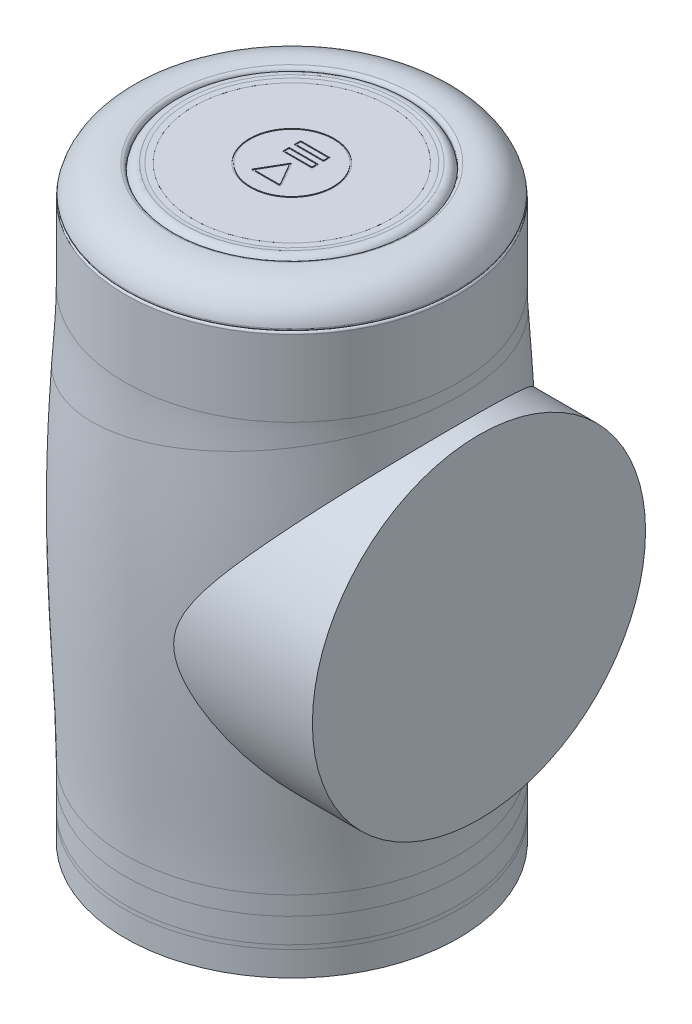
ISO-10303-21;
HEADER;
FILE_DESCRIPTION(('STEP AP214'),'2;1');
FILE_NAME('part.step','',(''),(''),'','','');
FILE_SCHEMA(('AUTOMOTIVE_DESIGN { 1 0 10303 214 1 1 1 1 }'));
ENDSEC;
DATA;
#1=APPLICATION_CONTEXT('core data for automotive mechanical design processes');
#2=APPLICATION_PROTOCOL_DEFINITION('international standard','automotive_design',2000,#1);
#3=PRODUCT_CONTEXT('',#1,'mechanical');
#4=PRODUCT('Part','Part','',(#3));
#5=PRODUCT_RELATED_PRODUCT_CATEGORY('part','',(#4));
#6=PRODUCT_DEFINITION_FORMATION('','',#4);
#7=PRODUCT_DEFINITION_CONTEXT('part definition',#1,'design');
#8=PRODUCT_DEFINITION('design','',#6,#7);
#9=PRODUCT_DEFINITION_SHAPE('','',#8);
#10=(LENGTH_UNIT() NAMED_UNIT(*) SI_UNIT(.MILLI.,.METRE.));
#11=(NAMED_UNIT(*) PLANE_ANGLE_UNIT() SI_UNIT($,.RADIAN.));
#12=(NAMED_UNIT(*) SI_UNIT($,.STERADIAN.) SOLID_ANGLE_UNIT());
#13=UNCERTAINTY_MEASURE_WITH_UNIT(LENGTH_MEASURE(1.E-05),#10,'distance_accuracy_value','');
#14=(GEOMETRIC_REPRESENTATION_CONTEXT(3) GLOBAL_UNCERTAINTY_ASSIGNED_CONTEXT((#13)) GLOBAL_UNIT_ASSIGNED_CONTEXT((#10,
#11,#12)) REPRESENTATION_CONTEXT('',''));
#15=CARTESIAN_POINT('',(0.,0.,0.));
#16=DIRECTION('',(0.,0.,1.));
#17=DIRECTION('',(1.,0.,0.));
#18=AXIS2_PLACEMENT_3D('',#15,#16,#17);
#19=CARTESIAN_POINT('',(-25.2888974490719,143.000000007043,-1.17117883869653E-13));
#20=DIRECTION('',(0.,1.,0.));
#21=DIRECTION('',(1.,0.,0.));
#22=AXIS2_PLACEMENT_3D('',#19,#20,#21);
#23=PLANE('',#22);
#24=CARTESIAN_POINT('',(1.11022302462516E-13,143.000000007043,-1.09863421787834E-13));
#25=DIRECTION('',(0.,1.,0.));
#26=DIRECTION('',(1.,0.,0.));
#27=AXIS2_PLACEMENT_3D('',#24,#25,#26);
#28=CIRCLE('',#27,23.85);
#29=CARTESIAN_POINT('',(23.8500000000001,143.000000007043,0.));
#30=VERTEX_POINT('',#29);
#31=EDGE_CURVE('P0_E411',#30,#30,#28,.T.);
#32=ORIENTED_EDGE('',*,*,#31,.F.);
#33=EDGE_LOOP('',(#32));
#34=FACE_BOUND('',#33,.T.);
#35=CARTESIAN_POINT('',(1.11022302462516E-13,143.000000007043,-1.02165743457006E-13));
#36=DIRECTION('',(0.,-1.,0.));
#37=DIRECTION('',(-1.,0.,0.));
#38=AXIS2_PLACEMENT_3D('',#35,#36,#37);
#39=CIRCLE('',#38,25.2888974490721);
#40=CARTESIAN_POINT('',(-25.288897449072,143.000000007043,-1.17117883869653E-13));
#41=VERTEX_POINT('',#40);
#42=EDGE_CURVE('P0_E414',#41,#41,#39,.T.);
#43=ORIENTED_EDGE('',*,*,#42,.F.);
#44=EDGE_LOOP('',(#43));
#45=FACE_BOUND('',#44,.T.);
#46=ADVANCED_FACE('P0_F14',(#34,#45),#23,.T.);
#47=CARTESIAN_POINT('',(1.11022302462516E-13,142.000000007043,-1.08905049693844E-13));
#48=DIRECTION('',(0.,1.,0.));
#49=DIRECTION('',(1.,0.,0.));
#50=AXIS2_PLACEMENT_3D('',#47,#48,#49);
#51=CYLINDRICAL_SURFACE('',#50,23.85);
#52=ORIENTED_EDGE('',*,*,#31,.T.);
#53=EDGE_LOOP('',(#52));
#54=FACE_BOUND('',#53,.T.);
#55=CARTESIAN_POINT('',(1.11022302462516E-13,142.000000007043,-1.08905049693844E-13));
#56=DIRECTION('',(0.,1.,0.));
#57=DIRECTION('',(1.,0.,0.));
#58=AXIS2_PLACEMENT_3D('',#55,#56,#57);
#59=CIRCLE('',#58,23.85);
#60=CARTESIAN_POINT('',(23.8500000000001,142.000000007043,0.));
#61=VERTEX_POINT('',#60);
#62=EDGE_CURVE('P0_E416',#61,#61,#59,.T.);
#63=ORIENTED_EDGE('',*,*,#62,.F.);
#64=EDGE_LOOP('',(#63));
#65=FACE_BOUND('',#64,.T.);
#66=ADVANCED_FACE('P0_F98',(#54,#65),#51,.F.);
#67=CARTESIAN_POINT('',(1.11022302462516E-13,142.000000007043,-1.08905049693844E-13));
#68=DIRECTION('',(0.,1.,0.));
#69=DIRECTION('',(1.,0.,0.));
#70=AXIS2_PLACEMENT_3D('',#67,#68,#69);
#71=PLANE('',#70);
#72=ORIENTED_EDGE('',*,*,#62,.T.);
#73=EDGE_LOOP('',(#72));
#74=FACE_BOUND('',#73,.T.);
#75=ADVANCED_FACE('P0_F102',(#74),#71,.T.);
#76=CARTESIAN_POINT('',(1.11022302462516E-13,149.000000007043,-1.08033814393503E-13));
#77=DIRECTION('',(0.,-1.,0.));
#78=DIRECTION('',(-1.,0.,0.));
#79=AXIS2_PLACEMENT_3D('',#76,#77,#78);
#80=TOROIDAL_SURFACE('',#79,25.2888974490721,6.);
#81=CARTESIAN_POINT('',(1.11022302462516E-13,143.069153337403,-1.02233376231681E-13));
#82=DIRECTION('',(0.,1.,0.));
#83=DIRECTION('',(1.,0.,0.));
#84=AXIS2_PLACEMENT_3D('',#81,#82,#83);
#85=CIRCLE('',#84,26.1972243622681);
#86=CARTESIAN_POINT('',(26.1972243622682,143.069153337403,0.));
#87=VERTEX_POINT('',#86);
#88=EDGE_CURVE('P0_E18',#87,#87,#85,.T.);
#89=ORIENTED_EDGE('',*,*,#88,.T.);
#90=EDGE_LOOP('',(#89));
#91=FACE_BOUND('',#90,.T.);
#92=ORIENTED_EDGE('',*,*,#42,.T.);
#93=EDGE_LOOP('',(#92));
#94=FACE_BOUND('',#93,.T.);
#95=ADVANCED_FACE('P0_F105',(#91,#94),#80,.F.);
#96=CARTESIAN_POINT('',(1.11022302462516E-13,141.092204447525,-1.00299896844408E-13));
#97=DIRECTION('',(0.,1.,0.));
#98=DIRECTION('',(1.,0.,0.));
#99=AXIS2_PLACEMENT_3D('',#96,#97,#98);
#100=TOROIDAL_SURFACE('',#99,26.5,2.);
#101=ORIENTED_EDGE('',*,*,#88,.F.);
#102=EDGE_LOOP('',(#101));
#103=FACE_BOUND('',#102,.T.);
#104=CARTESIAN_POINT('',(1.11022302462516E-13,141.092204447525,-1.00299896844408E-13));
#105=DIRECTION('',(0.,-1.,0.));
#106=DIRECTION('',(0.,0.,1.));
#107=AXIS2_PLACEMENT_3D('',#104,#105,#106);
#108=CIRCLE('',#107,28.5);
#109=CARTESIAN_POINT('',(1.08385464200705E-13,141.092204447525,28.4999999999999));
#110=VERTEX_POINT('',#109);
#111=EDGE_CURVE('P0_E73',#110,#110,#108,.T.);
#112=ORIENTED_EDGE('',*,*,#111,.F.);
#113=EDGE_LOOP('',(#112));
#114=FACE_BOUND('',#113,.T.);
#115=ADVANCED_FACE('P0_F16',(#103,#114),#100,.T.);
#116=CARTESIAN_POINT('',(1.11022302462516E-13,141.912067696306,-1.01101732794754E-13));
#117=DIRECTION('',(0.,1.,0.));
#118=DIRECTION('',(0.,0.,-1.));
#119=AXIS2_PLACEMENT_3D('',#116,#117,#118);
#120=TOROIDAL_SURFACE('',#119,29.5,1.);
#121=CARTESIAN_POINT('',(1.11022302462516E-13,141.912067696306,-1.01101732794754E-13));
#122=DIRECTION('',(0.,1.,0.));
#123=DIRECTION('',(0.,0.,-1.));
#124=AXIS2_PLACEMENT_3D('',#121,#122,#123);
#125=CIRCLE('',#124,28.5);
#126=CARTESIAN_POINT('',(1.27884047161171E-13,141.912067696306,-28.5000000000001));
#127=VERTEX_POINT('',#126);
#128=EDGE_CURVE('P0_E78',#127,#127,#125,.T.);
#129=ORIENTED_EDGE('',*,*,#128,.F.);
#130=EDGE_LOOP('',(#129));
#131=FACE_BOUND('',#130,.T.);
#132=CARTESIAN_POINT('',(1.11022302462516E-13,142.907035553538,-1.02074823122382E-13));
#133=DIRECTION('',(0.,-1.,0.));
#134=DIRECTION('',(0.,0.,1.));
#135=AXIS2_PLACEMENT_3D('',#132,#133,#134);
#136=CIRCLE('',#135,29.3998053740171);
#137=CARTESIAN_POINT('',(0.,142.907035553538,29.399805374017));
#138=VERTEX_POINT('',#137);
#139=EDGE_CURVE('P0_E403',#138,#138,#136,.T.);
#140=ORIENTED_EDGE('',*,*,#139,.F.);
#141=EDGE_LOOP('',(#140));
#142=FACE_BOUND('',#141,.T.);
#143=ADVANCED_FACE('P0_F89',(#131,#142),#120,.T.);
#144=CARTESIAN_POINT('',(28.5000000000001,142.800000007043,0.));
#145=CARTESIAN_POINT('',(33.7414529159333,143.513804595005,0.));
#146=CARTESIAN_POINT('',(36.1785547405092,142.604762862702,0.));
#147=CARTESIAN_POINT('',(38.5285314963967,141.041805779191,0.));
#148=CARTESIAN_POINT('',(40.1207976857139,138.624100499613,0.));
#149=CARTESIAN_POINT('',(40.5000000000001,136.000000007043,0.));
#150=B_SPLINE_CURVE_WITH_KNOTS('',5,(#144,#145,#146,#147,#148,#149),.UNSPECIFIED.,.F.,.F.,(6,6),
(0.,1.),.UNSPECIFIED.);
#151=CARTESIAN_POINT('',(1.11022302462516E-13,136.000000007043,0.));
#152=DIRECTION('',(0.,-1.,0.));
#153=AXIS1_PLACEMENT('',#151,#152);
#154=SURFACE_OF_REVOLUTION('',#150,#153);
#155=CARTESIAN_POINT('',(1.11022302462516E-13,136.613741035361,0.));
#156=DIRECTION('',(0.,-1.,0.));
#157=DIRECTION('',(0.,0.,1.));
#158=AXIS2_PLACEMENT_3D('',#155,#156,#157);
#159=CIRCLE('',#158,40.3840335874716);
#160=CARTESIAN_POINT('',(0.,136.613741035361,40.3840335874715));
#161=VERTEX_POINT('',#160);
#162=EDGE_CURVE('P0_E405',#161,#161,#159,.F.);
#163=ORIENTED_EDGE('',*,*,#162,.T.);
#164=EDGE_LOOP('',(#163));
#165=FACE_BOUND('',#164,.T.);
#166=ORIENTED_EDGE('',*,*,#139,.T.);
#167=EDGE_LOOP('',(#166));
#168=FACE_BOUND('',#167,.T.);
#169=ADVANCED_FACE('P0_F84',(#165,#168),#154,.T.);
#170=CARTESIAN_POINT('',(1.11022302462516E-13,136.500000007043,0.));
#171=DIRECTION('',(0.,-1.,0.));
#172=DIRECTION('',(0.,0.,1.));
#173=AXIS2_PLACEMENT_3D('',#170,#171,#172);
#174=TOROIDAL_SURFACE('',#173,39.8971424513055,0.5);
#175=ORIENTED_EDGE('',*,*,#162,.F.);
#176=EDGE_LOOP('',(#175));
#177=FACE_BOUND('',#176,.T.);
#178=CARTESIAN_POINT('',(1.11022302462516E-13,136.000002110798,0.));
#179=DIRECTION('',(0.,-1.,-4.11701126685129E-09));
#180=DIRECTION('',(0.,-4.11701126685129E-09,1.));
#181=AXIS2_PLACEMENT_3D('',#178,#179,#180);
#182=CIRCLE('',#181,39.8971424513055);
#183=CARTESIAN_POINT('',(1.07330993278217E-13,136.000001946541,39.8971424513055));
#184=VERTEX_POINT('',#183);
#185=EDGE_CURVE('P0_E64',#184,#184,#182,.T.);
#186=ORIENTED_EDGE('',*,*,#185,.F.);
#187=EDGE_LOOP('',(#186));
#188=FACE_BOUND('',#187,.T.);
#189=ADVANCED_FACE('P0_F88',(#177,#188),#174,.T.);
#190=CARTESIAN_POINT('',(1.11022302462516E-13,136.000000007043,0.));
#191=DIRECTION('',(0.,-1.,0.));
#192=DIRECTION('',(0.,0.,1.));
#193=AXIS2_PLACEMENT_3D('',#190,#191,#192);
#194=CYLINDRICAL_SURFACE('',#193,28.5);
#195=ORIENTED_EDGE('',*,*,#128,.T.);
#196=EDGE_LOOP('',(#195));
#197=FACE_BOUND('',#196,.T.);
#198=ORIENTED_EDGE('',*,*,#111,.T.);
#199=EDGE_LOOP('',(#198));
#200=FACE_BOUND('',#199,.T.);
#201=ADVANCED_FACE('P0_F94',(#197,#200),#194,.F.);
#202=CARTESIAN_POINT('',(897.149980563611,136.000002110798,7.53464599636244E-07));
#203=DIRECTION('',(0.,-1.,-4.11701126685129E-09));
#204=DIRECTION('',(0.,-4.11701126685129E-09,1.));
#205=AXIS2_PLACEMENT_3D('',#202,#203,#204);
#206=PLANE('',#205);
#207=ORIENTED_EDGE('',*,*,#185,.T.);
#208=EDGE_LOOP('',(#207));
#209=FACE_BOUND('',#208,.T.);
#210=CARTESIAN_POINT('',(1.11022302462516E-13,136.000000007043,0.));
#211=DIRECTION('',(0.,-1.,0.));
#212=DIRECTION('',(0.,0.,1.));
#213=AXIS2_PLACEMENT_3D('',#210,#211,#212);
#214=CIRCLE('',#213,40.);
#215=CARTESIAN_POINT('',(0.,136.000000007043,39.9999999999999));
#216=VERTEX_POINT('',#215);
#217=EDGE_CURVE('P0_E433',#216,#216,#214,.F.);
#218=ORIENTED_EDGE('',*,*,#217,.T.);
#219=EDGE_LOOP('',(#218));
#220=FACE_BOUND('',#219,.T.);
#221=ADVANCED_FACE('P0_F258',(#209,#220),#206,.F.);
#222=CARTESIAN_POINT('',(1.11022302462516E-13,8.50000000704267,0.));
#223=DIRECTION('',(0.,-1.,0.));
#224=DIRECTION('',(-1.,0.,0.));
#225=AXIS2_PLACEMENT_3D('',#222,#223,#224);
#226=CYLINDRICAL_SURFACE('',#225,40.5);
#227=CARTESIAN_POINT('',(1.11022302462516E-13,135.500000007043,0.));
#228=DIRECTION('',(0.,-1.,0.));
#229=DIRECTION('',(0.,0.,1.));
#230=AXIS2_PLACEMENT_3D('',#227,#228,#229);
#231=CIRCLE('',#230,40.5);
#232=CARTESIAN_POINT('',(0.,135.500000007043,40.4999999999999));
#233=VERTEX_POINT('',#232);
#234=EDGE_CURVE('P0_E72',#233,#233,#231,.T.);
#235=ORIENTED_EDGE('',*,*,#234,.T.);
#236=EDGE_LOOP('',(#235));
#237=FACE_BOUND('',#236,.T.);
#238=CARTESIAN_POINT('',(1.11022302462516E-13,117.000000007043,0.));
#239=DIRECTION('',(0.,-1.,0.));
#240=DIRECTION('',(-1.,0.,0.));
#241=AXIS2_PLACEMENT_3D('',#238,#239,#240);
#242=CIRCLE('',#241,40.5);
#243=CARTESIAN_POINT('',(-40.4999999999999,117.000000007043,-1.00683188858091E-13));
#244=VERTEX_POINT('',#243);
#245=EDGE_CURVE('P0_E435',#244,#244,#242,.T.);
#246=ORIENTED_EDGE('',*,*,#245,.F.);
#247=EDGE_LOOP('',(#246));
#248=FACE_BOUND('',#247,.T.);
#249=ADVANCED_FACE('P0_F246',(#237,#248),#226,.T.);
#250=CARTESIAN_POINT('',(1.11022302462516E-13,135.500000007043,0.));
#251=DIRECTION('',(0.,-1.,0.));
#252=DIRECTION('',(0.,0.,1.));
#253=AXIS2_PLACEMENT_3D('',#250,#251,#252);
#254=TOROIDAL_SURFACE('',#253,40.,0.5);
#255=ORIENTED_EDGE('',*,*,#234,.F.);
#256=EDGE_LOOP('',(#255));
#257=FACE_BOUND('',#256,.T.);
#258=ORIENTED_EDGE('',*,*,#217,.F.);
#259=EDGE_LOOP('',(#258));
#260=FACE_BOUND('',#259,.T.);
#261=ADVANCED_FACE('P0_F234',(#257,#260),#254,.T.);
#262=CARTESIAN_POINT('',(-40.4999999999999,13.0000000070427,0.));
#263=CARTESIAN_POINT('',(-40.4999999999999,34.5000000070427,0.));
#264=CARTESIAN_POINT('',(-45.9999999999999,68.5000000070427,0.));
#265=CARTESIAN_POINT('',(-40.4999999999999,98.5000000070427,0.));
#266=CARTESIAN_POINT('',(-40.4999999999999,117.000000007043,-1.00683188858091E-13));
#267=B_SPLINE_CURVE_WITH_KNOTS('',4,(#262,#263,#264,#265,#266),.UNSPECIFIED.,.F.,.F.,(5,5),(0.,
1.),.UNSPECIFIED.);
#268=CARTESIAN_POINT('',(1.11022302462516E-13,8.50000000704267,0.));
#269=DIRECTION('',(0.,-1.,0.));
#270=AXIS1_PLACEMENT('',#268,#269);
#271=SURFACE_OF_REVOLUTION('',#267,#270);
#272=CARTESIAN_POINT('',(-41.4723800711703,97.7108133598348,0.));
#273=CARTESIAN_POINT('',(-41.4723859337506,97.7108132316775,0.517906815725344));
#274=CARTESIAN_POINT('',(-41.462547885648,97.7128711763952,1.03581266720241));
#275=CARTESIAN_POINT('',(-41.4231370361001,97.7210635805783,2.0732864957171));
#276=CARTESIAN_POINT('',(-41.3934714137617,97.7272172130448,2.59285079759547));
#277=CARTESIAN_POINT('',(-41.3141715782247,97.7435990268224,3.63286369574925));
#278=CARTESIAN_POINT('',(-41.2644434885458,97.7538463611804,4.15330483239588));
#279=CARTESIAN_POINT('',(-41.1448239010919,97.7784120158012,5.19427594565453));
#280=CARTESIAN_POINT('',(-41.0748376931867,97.7927494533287,5.71479458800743));
#281=CARTESIAN_POINT('',(-40.9145362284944,97.8254903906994,6.7551076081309));
#282=CARTESIAN_POINT('',(-40.8241256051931,97.8439129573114,7.27488669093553));
#283=CARTESIAN_POINT('',(-40.6228430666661,97.8848177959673,8.31289129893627));
#284=CARTESIAN_POINT('',(-40.511875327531,97.9073190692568,8.83109749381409));
#285=CARTESIAN_POINT('',(-40.2693800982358,97.95637353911,9.86511200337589));
#286=CARTESIAN_POINT('',(-40.1377565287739,97.982945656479,10.380896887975));
#287=CARTESIAN_POINT('',(-39.853886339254,98.0401325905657,11.4092107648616));
#288=CARTESIAN_POINT('',(-39.7015435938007,98.0707662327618,11.9217121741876));
#289=CARTESIAN_POINT('',(-39.3762079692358,98.1360655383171,12.9425887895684));
#290=CARTESIAN_POINT('',(-39.2031191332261,98.170749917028,13.4509322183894));
#291=CARTESIAN_POINT('',(-38.836301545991,98.2441385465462,14.4626117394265));
#292=CARTESIAN_POINT('',(-38.6424772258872,98.2828613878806,14.9659118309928));
#293=CARTESIAN_POINT('',(-38.234237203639,98.3643133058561,15.9666142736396));
#294=CARTESIAN_POINT('',(-38.019726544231,98.4070608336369,16.4639763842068));
#295=CARTESIAN_POINT('',(-37.5702016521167,98.4965469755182,17.4519048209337));
#296=CARTESIAN_POINT('',(-37.3350933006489,98.54330388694,17.9424266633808));
#297=CARTESIAN_POINT('',(-36.8445010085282,98.6407921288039,18.9157705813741));
#298=CARTESIAN_POINT('',(-36.5889240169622,98.6915415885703,19.3985439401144));
#299=CARTESIAN_POINT('',(-36.0575634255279,98.7969966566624,20.355482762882));
#300=CARTESIAN_POINT('',(-35.7816880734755,98.851720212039,20.8295953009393));
#301=CARTESIAN_POINT('',(-35.2099415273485,98.9651037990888,21.7683020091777));
#302=CARTESIAN_POINT('',(-34.9139801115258,99.0237815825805,22.2328390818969));
#303=CARTESIAN_POINT('',(-34.3023145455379,99.1450516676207,23.1514841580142));
#304=CARTESIAN_POINT('',(-33.98652193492,99.2076615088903,23.6055309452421));
#305=CARTESIAN_POINT('',(-33.3354904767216,99.3367746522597,24.5022857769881));
#306=CARTESIAN_POINT('',(-33.0001651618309,99.4032952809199,24.9449285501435));
#307=CARTESIAN_POINT('',(-32.3104069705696,99.5401977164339,25.8179715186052));
#308=CARTESIAN_POINT('',(-31.9558898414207,99.6105965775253,26.2483024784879));
#309=CARTESIAN_POINT('',(-31.2281357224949,99.7552573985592,27.0958155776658));
#310=CARTESIAN_POINT('',(-30.8548169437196,99.8295363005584,27.5129245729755));
#311=CARTESIAN_POINT('',(-30.0898723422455,99.9818223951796,28.333126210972));
#312=CARTESIAN_POINT('',(-29.6981673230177,100.059845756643,28.7361420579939));
#313=CARTESIAN_POINT('',(-29.0036851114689,100.198662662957,29.4218299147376));
#314=CARTESIAN_POINT('',(-28.7045231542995,100.25860927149,29.7083469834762));
#315=CARTESIAN_POINT('',(-28.0884130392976,100.38250266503,30.2807156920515));
#316=CARTESIAN_POINT('',(-27.7712010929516,100.446515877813,30.5662692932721));
#317=CARTESIAN_POINT('',(-27.1185291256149,100.578441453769,31.1355727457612));
#318=CARTESIAN_POINT('',(-26.7828072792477,100.646413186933,31.4190086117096));
#319=CARTESIAN_POINT('',(-26.0926968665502,100.786255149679,31.9828660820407));
#320=CARTESIAN_POINT('',(-25.7380495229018,100.858181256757,32.262957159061));
#321=CARTESIAN_POINT('',(-25.0097196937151,101.005900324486,32.8188532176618));
#322=CARTESIAN_POINT('',(-24.6357826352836,101.081745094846,33.0943109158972));
#323=CARTESIAN_POINT('',(-23.8685618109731,101.237275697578,33.639604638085));
#324=CARTESIAN_POINT('',(-23.4750288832,101.317009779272,33.9090763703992));
#325=CARTESIAN_POINT('',(-22.6683686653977,101.480288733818,34.4410007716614));
#326=CARTESIAN_POINT('',(-22.254998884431,101.563878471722,34.7030719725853));
#327=CARTESIAN_POINT('',(-21.408488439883,101.734836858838,35.2187375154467));
#328=CARTESIAN_POINT('',(-20.9751132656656,101.822247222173,35.4719331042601));
#329=CARTESIAN_POINT('',(-20.0884940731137,102.000812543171,35.9683315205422));
#330=CARTESIAN_POINT('',(-19.6350248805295,102.092006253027,36.2111182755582));
#331=CARTESIAN_POINT('',(-18.7082058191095,102.278101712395,36.6851278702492));
#332=CARTESIAN_POINT('',(-18.2346415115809,102.373039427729,36.9159173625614));
#333=CARTESIAN_POINT('',(-17.2677141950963,102.566584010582,37.3643095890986));
#334=CARTESIAN_POINT('',(-16.7741489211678,102.665224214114,37.5814618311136));
#335=CARTESIAN_POINT('',(-15.7674031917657,102.866132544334,38.0009093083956));
#336=CARTESIAN_POINT('',(-15.2540341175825,102.968431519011,38.2027371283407));
#337=CARTESIAN_POINT('',(-14.2079735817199,103.176613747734,38.5898231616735));
#338=CARTESIAN_POINT('',(-13.6751086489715,103.282525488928,38.774597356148));
#339=CARTESIAN_POINT('',(-12.5904661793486,103.49788727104,39.1258270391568));
#340=CARTESIAN_POINT('',(-12.0385318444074,103.607363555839,39.2917823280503));
#341=CARTESIAN_POINT('',(-10.9162847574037,103.829805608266,39.603595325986));
#342=CARTESIAN_POINT('',(-10.3458334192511,103.942795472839,39.7489371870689));
#343=CARTESIAN_POINT('',(-9.18721879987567,104.172214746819,40.0177221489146));
#344=CARTESIAN_POINT('',(-8.59893670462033,104.288666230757,40.1406343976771));
#345=CARTESIAN_POINT('',(-7.40546434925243,104.524950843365,40.362745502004));
#346=CARTESIAN_POINT('',(-6.80017656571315,104.644803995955,40.4613992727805));
#347=CARTESIAN_POINT('',(-5.57364851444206,104.887852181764,40.6331732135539));
#348=CARTESIAN_POINT('',(-4.95233368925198,105.011065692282,40.7057349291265));
#349=CARTESIAN_POINT('',(-3.69483498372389,105.260712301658,40.823515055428));
#350=CARTESIAN_POINT('',(-3.05860055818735,105.387160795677,40.8681627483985));
#351=CARTESIAN_POINT('',(-1.77259635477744,105.643459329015,40.9283046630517));
#352=CARTESIAN_POINT('',(-1.12280337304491,105.773327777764,40.9432167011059));
#353=CARTESIAN_POINT('',(0.398413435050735,106.077271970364,40.9420078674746));
#354=CARTESIAN_POINT('',(1.26986309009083,106.251322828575,40.9135723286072));
#355=CARTESIAN_POINT('',(2.93337611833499,106.582775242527,40.8062480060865));
#356=CARTESIAN_POINT('',(3.72571909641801,106.74030204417,40.7319875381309));
#357=CARTESIAN_POINT('',(5.22950447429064,107.039372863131,40.5468393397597));
#358=CARTESIAN_POINT('',(5.9414442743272,107.181006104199,40.4401284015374));
#359=CARTESIAN_POINT('',(7.28422254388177,107.448474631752,40.2026173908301));
#360=CARTESIAN_POINT('',(7.91570304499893,107.574402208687,40.0755397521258));
#361=CARTESIAN_POINT('',(9.09830556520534,107.810727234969,39.8084590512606));
#362=CARTESIAN_POINT('',(9.65015110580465,107.92121084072,39.6717293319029));
#363=CARTESIAN_POINT('',(10.6748690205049,108.126859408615,39.3951258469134));
#364=CARTESIAN_POINT('',(11.1484904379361,108.22210890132,39.2580846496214));
#365=CARTESIAN_POINT('',(12.0185145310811,108.397491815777,38.9892699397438));
#366=CARTESIAN_POINT('',(12.4156439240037,108.477708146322,38.859898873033));
#367=CARTESIAN_POINT('',(13.1345867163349,108.623152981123,38.6135000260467));
#368=CARTESIAN_POINT('',(13.4570623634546,108.68847461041,38.4984560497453));
#369=CARTESIAN_POINT('',(14.028531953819,108.804342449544,38.2864938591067));
#370=CARTESIAN_POINT('',(14.2780924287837,108.854979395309,38.1911521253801));
#371=CARTESIAN_POINT('',(14.7054112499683,108.94133587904,38.0231293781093));
#372=CARTESIAN_POINT('',(14.883598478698,108.977240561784,37.9516279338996));
#373=CARTESIAN_POINT('',(15.6162185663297,109.124486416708,37.6516910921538));
#374=CARTESIAN_POINT('',(16.1665494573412,109.234201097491,37.4122580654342));
#375=CARTESIAN_POINT('',(16.9787803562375,109.396465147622,37.0374976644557));
#376=CARTESIAN_POINT('',(17.24480184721,109.449664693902,36.9112693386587));
#377=CARTESIAN_POINT('',(17.7707843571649,109.554803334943,36.6547326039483));
#378=CARTESIAN_POINT('',(18.0307793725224,109.606749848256,36.524497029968));
#379=CARTESIAN_POINT('',(18.7966222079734,109.759767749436,36.1306517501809));
#380=CARTESIAN_POINT('',(19.2985966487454,109.860069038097,35.8591572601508));
#381=CARTESIAN_POINT('',(20.2780697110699,110.055818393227,35.3027287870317));
#382=CARTESIAN_POINT('',(20.7558648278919,110.151324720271,35.0183361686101));
#383=CARTESIAN_POINT('',(21.6871284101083,110.337554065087,34.4381103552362));
#384=CARTESIAN_POINT('',(22.1409054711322,110.428336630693,34.1427917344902));
#385=CARTESIAN_POINT('',(23.02437047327,110.605170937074,33.5426394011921));
#386=CARTESIAN_POINT('',(23.4543775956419,110.691284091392,33.2382935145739));
#387=CARTESIAN_POINT('',(24.290647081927,110.858833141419,32.621920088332));
#388=CARTESIAN_POINT('',(24.6972370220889,110.940332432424,32.3103541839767));
#389=CARTESIAN_POINT('',(25.4871036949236,111.098705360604,31.6812851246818));
#390=CARTESIAN_POINT('',(25.8707145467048,111.175644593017,31.3642179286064));
#391=CARTESIAN_POINT('',(26.6151364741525,111.324941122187,30.7257964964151));
#392=CARTESIAN_POINT('',(26.9762863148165,111.39736663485,30.4048532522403));
#393=CARTESIAN_POINT('',(27.6763589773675,111.537696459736,29.7602468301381));
#394=CARTESIAN_POINT('',(28.0156237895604,111.605671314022,29.4369701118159));
#395=CARTESIAN_POINT('',(28.7631785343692,111.755207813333,28.6998146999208));
#396=CARTESIAN_POINT('',(29.1685126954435,111.836118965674,28.2827986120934));
#397=CARTESIAN_POINT('',(29.9580512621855,111.993413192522,27.4351746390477));
#398=CARTESIAN_POINT('',(30.3424066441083,112.069829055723,27.0047133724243));
#399=CARTESIAN_POINT('',(31.0897237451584,112.21820535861,26.13132164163));
#400=CARTESIAN_POINT('',(31.4528401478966,112.290198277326,25.6885290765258));
#401=CARTESIAN_POINT('',(32.157465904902,112.429772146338,24.7915949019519));
#402=CARTESIAN_POINT('',(32.499133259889,112.497385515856,24.3375824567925));
#403=CARTESIAN_POINT('',(33.1607048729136,112.628248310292,23.4193146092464));
#404=CARTESIAN_POINT('',(33.4807699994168,112.691530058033,22.9551797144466));
#405=CARTESIAN_POINT('',(34.0990344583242,112.813773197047,22.0177590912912));
#406=CARTESIAN_POINT('',(34.3973971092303,112.872766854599,21.5445852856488));
#407=CARTESIAN_POINT('',(34.9722060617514,112.986475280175,20.5901621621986));
#408=CARTESIAN_POINT('',(35.2488177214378,113.041222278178,20.1090162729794));
#409=CARTESIAN_POINT('',(35.7801242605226,113.146476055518,19.1397055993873));
#410=CARTESIAN_POINT('',(36.034986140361,113.197015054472,18.6516358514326));
#411=CARTESIAN_POINT('',(36.5228409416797,113.293888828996,17.6695133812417));
#412=CARTESIAN_POINT('',(36.7560021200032,113.340255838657,17.1755474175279));
#413=CARTESIAN_POINT('',(37.2005496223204,113.428818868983,16.1826459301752));
#414=CARTESIAN_POINT('',(37.4121050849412,113.471047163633,15.6837890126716));
#415=CARTESIAN_POINT('',(37.8135795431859,113.551363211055,14.6820948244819));
#416=CARTESIAN_POINT('',(38.0036681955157,113.589483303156,14.1793281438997));
#417=CARTESIAN_POINT('',(38.3623896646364,113.661610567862,13.1707778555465));
#418=CARTESIAN_POINT('',(38.5311923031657,113.695650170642,12.6650569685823));
#419=CARTESIAN_POINT('',(38.8475625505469,113.759641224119,11.651534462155));
#420=CARTESIAN_POINT('',(38.9952998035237,113.789625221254,11.1437878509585));
#421=CARTESIAN_POINT('',(39.2697981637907,113.845526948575,10.1271215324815));
#422=CARTESIAN_POINT('',(39.3967284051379,113.871477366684,9.61824928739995));
#423=CARTESIAN_POINT('',(39.6299075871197,113.919330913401,8.60020957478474));
#424=CARTESIAN_POINT('',(39.7363248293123,113.941266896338,8.09108219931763));
#425=CARTESIAN_POINT('',(39.9288066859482,113.98110762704,7.07337925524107));
#426=CARTESIAN_POINT('',(40.0150384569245,113.999045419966,6.56483659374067));
#427=CARTESIAN_POINT('',(40.1675097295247,114.030902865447,5.54911829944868));
#428=CARTESIAN_POINT('',(40.2339149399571,114.044855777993,5.04196858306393));
#429=CARTESIAN_POINT('',(40.3471229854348,114.068753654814,4.02981876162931));
#430=CARTESIAN_POINT('',(40.3940897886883,114.07873211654,3.52483778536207));
#431=CARTESIAN_POINT('',(40.4688383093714,114.094688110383,2.51777463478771));
#432=CARTESIAN_POINT('',(40.4967819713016,114.100699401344,2.01570501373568));
#433=CARTESIAN_POINT('',(40.5339267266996,114.108725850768,1.01517988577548));
#434=CARTESIAN_POINT('',(40.5432874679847,114.110775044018,0.516730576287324));
#435=CARTESIAN_POINT('',(40.5437338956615,114.110876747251,-0.479890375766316));
#436=CARTESIAN_POINT('',(40.5348300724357,114.108931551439,-0.978062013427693));
#437=CARTESIAN_POINT('',(40.4986235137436,114.101114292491,-1.97804870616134));
#438=CARTESIAN_POINT('',(40.4711612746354,114.095208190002,-2.4798577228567));
#439=CARTESIAN_POINT('',(40.3973995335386,114.079465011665,-3.48641812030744));
#440=CARTESIAN_POINT('',(40.3509382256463,114.069594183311,-3.99115711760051));
#441=CARTESIAN_POINT('',(40.2387646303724,114.045913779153,-5.00284304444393));
#442=CARTESIAN_POINT('',(40.1728885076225,114.032070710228,-5.5097710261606));
#443=CARTESIAN_POINT('',(40.0214982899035,114.000435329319,-6.52506751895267));
#444=CARTESIAN_POINT('',(39.9358186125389,113.982609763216,-7.03341030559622));
#445=CARTESIAN_POINT('',(39.7444631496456,113.942995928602,-8.05073678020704));
#446=CARTESIAN_POINT('',(39.6386203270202,113.921174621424,-8.55968776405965));
#447=CARTESIAN_POINT('',(39.4066114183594,113.873552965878,-9.57739958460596));
#448=CARTESIAN_POINT('',(39.2802771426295,113.847719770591,-10.0861205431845));
#449=CARTESIAN_POINT('',(39.0069912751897,113.792055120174,-11.1025107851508));
#450=CARTESIAN_POINT('',(38.8598706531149,113.762190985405,-11.610132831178));
#451=CARTESIAN_POINT('',(38.5447532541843,113.698442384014,-12.6234342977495));
#452=CARTESIAN_POINT('',(38.3765869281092,113.664525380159,-13.1290589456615));
#453=CARTESIAN_POINT('',(38.0191565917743,113.592646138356,-14.1374464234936));
#454=CARTESIAN_POINT('',(37.8297228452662,113.554651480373,-14.6401467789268));
#455=CARTESIAN_POINT('',(37.4295755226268,113.474589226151,-15.6417395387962));
#456=CARTESIAN_POINT('',(37.2186923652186,113.432489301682,-16.1405616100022));
#457=CARTESIAN_POINT('',(36.7755055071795,113.344186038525,-17.1334261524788));
#458=CARTESIAN_POINT('',(36.5430327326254,113.297950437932,-17.6273902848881));
#459=CARTESIAN_POINT('',(36.0565693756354,113.201342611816,-18.609543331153));
#460=CARTESIAN_POINT('',(35.802410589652,113.150938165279,-19.0976457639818));
#461=CARTESIAN_POINT('',(35.2725233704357,113.045956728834,-20.0670574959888));
#462=CARTESIAN_POINT('',(34.9966279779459,112.9913475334,-20.5482720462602));
#463=CARTESIAN_POINT('',(34.4232630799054,112.877918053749,-21.5028695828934));
#464=CARTESIAN_POINT('',(34.1256282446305,112.819065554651,-21.9761494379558));
#465=CARTESIAN_POINT('',(33.5088292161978,112.697108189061,-22.9138206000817));
#466=CARTESIAN_POINT('',(33.1895017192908,112.63397107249,-23.3781002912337));
#467=CARTESIAN_POINT('',(32.5294133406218,112.503401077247,-24.2966974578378));
#468=CARTESIAN_POINT('',(32.1884915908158,112.435935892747,-24.7508947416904));
#469=CARTESIAN_POINT('',(31.4853630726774,112.296662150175,-25.6482395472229));
#470=CARTESIAN_POINT('',(31.1229982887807,112.224821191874,-26.0912582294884));
#471=CARTESIAN_POINT('',(30.3771884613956,112.076752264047,-26.9651442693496));
#472=CARTESIAN_POINT('',(29.9935887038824,112.000491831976,-27.3958740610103));
#473=CARTESIAN_POINT('',(29.2055630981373,111.843513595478,-28.2440783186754));
#474=CARTESIAN_POINT('',(28.8009862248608,111.762763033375,-28.6614065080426));
#475=CARTESIAN_POINT('',(28.0546688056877,111.613489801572,-29.3992863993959));
#476=CARTESIAN_POINT('',(27.71588097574,111.545617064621,-29.7229639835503));
#477=CARTESIAN_POINT('',(27.0167413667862,111.405483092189,-30.3684240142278));
#478=CARTESIAN_POINT('',(26.6560464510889,111.333150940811,-30.6898197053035));
#479=CARTESIAN_POINT('',(25.9125091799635,111.184033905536,-31.3291966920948));
#480=CARTESIAN_POINT('',(25.5293268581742,111.107180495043,-31.6467666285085));
#481=CARTESIAN_POINT('',(24.7402879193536,110.948971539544,-32.2768901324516));
#482=CARTESIAN_POINT('',(24.3340959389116,110.867550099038,-32.5890072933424));
#483=CARTESIAN_POINT('',(23.4985887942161,110.700149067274,-33.2065301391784));
#484=CARTESIAN_POINT('',(23.0689447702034,110.614105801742,-33.5114736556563));
#485=CARTESIAN_POINT('',(22.1861681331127,110.437403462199,-34.1128656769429));
#486=CARTESIAN_POINT('',(21.732715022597,110.346682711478,-34.4088257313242));
#487=CARTESIAN_POINT('',(20.8020572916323,110.160569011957,-34.9903759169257));
#488=CARTESIAN_POINT('',(20.3245427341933,110.065116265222,-35.275450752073));
#489=CARTESIAN_POINT('',(19.3455845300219,109.869466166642,-35.8332818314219));
#490=CARTESIAN_POINT('',(18.8438430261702,109.769210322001,-36.1054958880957));
#491=CARTESIAN_POINT('',(18.0783187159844,109.616255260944,-36.5004344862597));
#492=CARTESIAN_POINT('',(17.8184211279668,109.564328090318,-36.6310425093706));
#493=CARTESIAN_POINT('',(17.2926200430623,109.459226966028,-36.8883320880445));
#494=CARTESIAN_POINT('',(17.0266823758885,109.406045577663,-37.0149406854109));
#495=CARTESIAN_POINT('',(16.214676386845,109.243825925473,-37.3908642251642));
#496=CARTESIAN_POINT('',(15.6644734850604,109.134129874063,-37.6310789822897));
#497=CARTESIAN_POINT('',(14.9285370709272,108.986239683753,-37.933465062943));
#498=CARTESIAN_POINT('',(14.7469079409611,108.949647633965,-38.0065862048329));
#499=CARTESIAN_POINT('',(14.313352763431,108.862045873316,-38.1775580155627));
#500=CARTESIAN_POINT('',(14.0609939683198,108.810851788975,-38.2742231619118));
#501=CARTESIAN_POINT('',(13.4845687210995,108.694000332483,-38.4885265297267));
#502=CARTESIAN_POINT('',(13.1599350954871,108.628250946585,-38.6045895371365));
#503=CARTESIAN_POINT('',(12.437320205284,108.48208204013,-38.8527269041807));
#504=CARTESIAN_POINT('',(12.0386784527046,108.401568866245,-38.9828260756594));
#505=CARTESIAN_POINT('',(11.1662844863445,108.225723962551,-39.25282552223));
#506=CARTESIAN_POINT('',(10.6918094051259,108.130308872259,-39.3903394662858));
#507=CARTESIAN_POINT('',(9.66605523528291,107.92446208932,-39.667667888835));
#508=CARTESIAN_POINT('',(9.11403236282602,107.813945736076,-39.804673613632));
#509=CARTESIAN_POINT('',(7.93176440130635,107.577689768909,-40.0721604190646));
#510=CARTESIAN_POINT('',(7.30080164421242,107.451864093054,-40.1993998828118));
#511=CARTESIAN_POINT('',(5.95976364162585,107.184736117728,-40.4371877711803));
#512=CARTESIAN_POINT('',(5.24905177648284,107.043341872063,-40.5440535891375));
#513=CARTESIAN_POINT('',(3.74843424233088,106.744888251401,-40.7295887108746));
#514=CARTESIAN_POINT('',(2.95803487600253,106.587740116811,-40.8041292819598));
#515=CARTESIAN_POINT('',(1.29911428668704,106.257188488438,-40.9122392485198));
#516=CARTESIAN_POINT('',(0.43031405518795,106.083660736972,-40.9412366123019));
#517=CARTESIAN_POINT('',(-1.08868930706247,105.780153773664,-40.9437213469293));
#518=CARTESIAN_POINT('',(-1.73890741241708,105.650199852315,-40.9293369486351));
#519=CARTESIAN_POINT('',(-3.02576647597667,105.393731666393,-40.870200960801));
#520=CARTESIAN_POINT('',(-3.66243023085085,105.267199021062,-40.8260327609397));
#521=CARTESIAN_POINT('',(-4.92078867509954,105.017385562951,-40.7091649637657));
#522=CARTESIAN_POINT('',(-5.54253357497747,104.894089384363,-40.6370372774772));
#523=CARTESIAN_POINT('',(-6.7699193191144,104.650877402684,-40.4660876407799));
#524=CARTESIAN_POINT('',(-7.37563446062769,104.530943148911,-40.3678253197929));
#525=CARTESIAN_POINT('',(-8.56995605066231,104.2944979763,-40.1464563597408));
#526=CARTESIAN_POINT('',(-9.15865983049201,104.1779670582,-40.0238959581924));
#527=CARTESIAN_POINT('',(-10.3181096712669,103.948390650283,-39.7557770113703));
#528=CARTESIAN_POINT('',(-10.8889744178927,103.835323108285,-39.6107504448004));
#529=CARTESIAN_POINT('',(-12.0120378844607,103.612727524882,-39.2995334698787));
#530=CARTESIAN_POINT('',(-12.5643751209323,103.503175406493,-39.1338600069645));
#531=CARTESIAN_POINT('',(-13.6498110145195,103.287663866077,-38.7831625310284));
#532=CARTESIAN_POINT('',(-14.1830664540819,103.181678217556,-38.598639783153));
#533=CARTESIAN_POINT('',(-15.2298940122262,102.973350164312,-38.2120282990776));
#534=CARTESIAN_POINT('',(-15.7436396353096,102.870979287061,-38.0104246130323));
#535=CARTESIAN_POINT('',(-16.7511231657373,102.669929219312,-37.5914001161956));
#536=CARTESIAN_POINT('',(-17.2450497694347,102.571219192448,-37.3744477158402));
#537=CARTESIAN_POINT('',(-18.2126834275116,102.377537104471,-36.9264328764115));
#538=CARTESIAN_POINT('',(-18.6865928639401,102.282531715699,-36.6958218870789));
#539=CARTESIAN_POINT('',(-19.6140851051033,102.096303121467,-36.2221499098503));
#540=CARTESIAN_POINT('',(-20.0678825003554,102.005043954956,-35.9795231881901));
#541=CARTESIAN_POINT('',(-20.9551404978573,101.826349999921,-35.483428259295));
#542=CARTESIAN_POINT('',(-21.3888264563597,101.73887646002,-35.2303770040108));
#543=CARTESIAN_POINT('',(-22.2359405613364,101.567794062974,-34.7149862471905));
#544=CARTESIAN_POINT('',(-22.6496034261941,101.48414348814,-34.4530463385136));
#545=CARTESIAN_POINT('',(-23.4568317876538,101.320745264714,-33.9213732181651));
#546=CARTESIAN_POINT('',(-23.8506400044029,101.240952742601,-33.6520222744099));
#547=CARTESIAN_POINT('',(-24.6183934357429,101.085307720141,-33.1069612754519));
#548=CARTESIAN_POINT('',(-24.992588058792,101.009406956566,-32.8316162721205));
#549=CARTESIAN_POINT('',(-25.7214152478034,100.861578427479,-32.2759390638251));
#550=CARTESIAN_POINT('',(-26.0763026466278,100.789598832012,-31.9959548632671));
#551=CARTESIAN_POINT('',(-26.7668757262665,100.64965244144,-31.4323067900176));
#552=CARTESIAN_POINT('',(-27.1028204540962,100.581629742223,-31.1489741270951));
#553=CARTESIAN_POINT('',(-27.7559211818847,100.449604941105,-30.5798747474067));
#554=CARTESIAN_POINT('',(-28.0733392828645,100.385543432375,-30.2944226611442));
#555=CARTESIAN_POINT('',(-28.6898452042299,100.26155581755,-29.7222566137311));
#556=CARTESIAN_POINT('',(-28.989197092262,100.201563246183,-29.4358412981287));
#557=CARTESIAN_POINT('',(-29.6842796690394,100.062607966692,-28.7502356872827));
#558=CARTESIAN_POINT('',(-30.0763898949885,99.9844936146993,-28.3471908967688));
#559=CARTESIAN_POINT('',(-30.8421355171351,99.8320301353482,-27.5269029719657));
#560=CARTESIAN_POINT('',(-31.2158500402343,99.7576648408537,-27.1097366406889));
#561=CARTESIAN_POINT('',(-31.9443846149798,99.6128354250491,-26.2620813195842));
#562=CARTESIAN_POINT('',(-32.2992863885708,99.5423543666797,-25.8316654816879));
#563=CARTESIAN_POINT('',(-32.9898012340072,99.4052919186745,-24.9584260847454));
#564=CARTESIAN_POINT('',(-33.3254984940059,99.3386934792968,-24.5156717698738));
#565=CARTESIAN_POINT('',(-33.977259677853,99.2094291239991,-23.6186681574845));
#566=CARTESIAN_POINT('',(-34.29341000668,99.1467458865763,-23.1644841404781));
#567=CARTESIAN_POINT('',(-34.9057753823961,99.0253334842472,-22.2455399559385));
#568=CARTESIAN_POINT('',(-35.2020788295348,98.9665867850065,-21.7808410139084));
#569=CARTESIAN_POINT('',(-35.7744924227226,98.8530698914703,-20.8417870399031));
#570=CARTESIAN_POINT('',(-36.0506927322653,98.7982819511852,-20.3674891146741));
#571=CARTESIAN_POINT('',(-36.5826849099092,98.6927026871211,-19.4101571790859));
#572=CARTESIAN_POINT('',(-36.8385684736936,98.6418934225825,-18.9271761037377));
#573=CARTESIAN_POINT('',(-37.329754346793,98.5442901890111,-17.9533956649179));
#574=CARTESIAN_POINT('',(-37.5651496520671,98.497478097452,-17.462645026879));
#575=CARTESIAN_POINT('',(-38.0152277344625,98.4078862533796,-16.4742392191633));
#576=CARTESIAN_POINT('',(-38.230004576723,98.3650882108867,-15.9766285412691));
#577=CARTESIAN_POINT('',(-38.6387551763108,98.2835399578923,-14.9754105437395));
#578=CARTESIAN_POINT('',(-38.8328238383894,98.2447713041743,-14.4718434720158));
#579=CARTESIAN_POINT('',(-39.2001073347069,98.1712957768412,-13.4596129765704));
#580=CARTESIAN_POINT('',(-39.3734176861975,98.1365703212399,-12.9509855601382));
#581=CARTESIAN_POINT('',(-39.6991726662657,98.0711936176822,-11.9295254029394));
#582=CARTESIAN_POINT('',(-39.8517132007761,98.0405236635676,-11.4167244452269));
#583=CARTESIAN_POINT('',(-40.1359544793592,97.983268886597,-10.3877973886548));
#584=CARTESIAN_POINT('',(-40.2677512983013,97.9566652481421,-9.87169887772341));
#585=CARTESIAN_POINT('',(-40.5105678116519,97.9075525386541,-8.83704454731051));
#586=CARTESIAN_POINT('',(-40.6216835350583,97.8850245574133,-8.3185121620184));
#587=CARTESIAN_POINT('',(-40.823236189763,97.8440711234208,-7.27984414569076));
#588=CARTESIAN_POINT('',(-40.9137688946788,97.8256266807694,-6.75972784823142));
#589=CARTESIAN_POINT('',(-41.0742881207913,97.7928468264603,-5.71873093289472));
#590=CARTESIAN_POINT('',(-41.1443699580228,97.7784923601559,-5.19786561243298));
#591=CARTESIAN_POINT('',(-41.2641539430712,97.7538974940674,-4.15619325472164));
#592=CARTESIAN_POINT('',(-41.3139507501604,97.7436379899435,-3.63539755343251));
#593=CARTESIAN_POINT('',(-41.3933607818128,97.7272366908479,-2.59466922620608));
#594=CARTESIAN_POINT('',(-41.4230678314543,97.7210757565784,-2.07474406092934));
#595=CARTESIAN_POINT('',(-41.46253403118,97.7128736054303,-1.03654380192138));
#596=CARTESIAN_POINT('',(-41.472385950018,97.7108132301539,-0.518272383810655));
#597=CARTESIAN_POINT('',(-41.4723800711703,97.7108133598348,0.));
#598=B_SPLINE_CURVE_WITH_KNOTS('',3,(#272,#273,#274,#275,#276,#277,#278,#279,#280,#281,#282,
#283,#284,#285,#286,#287,#288,#289,#290,#291,#292,#293,#294,#295,#296,#297,#298,#299,#300,#301,
#302,#303,#304,#305,#306,#307,#308,#309,#310,#311,#312,#313,#314,#315,#316,#317,#318,#319,#320,
#321,#322,#323,#324,#325,#326,#327,#328,#329,#330,#331,#332,#333,#334,#335,#336,#337,#338,#339,
#340,#341,#342,#343,#344,#345,#346,#347,#348,#349,#350,#351,#352,#353,#354,#355,#356,#357,#358,
#359,#360,#361,#362,#363,#364,#365,#366,#367,#368,#369,#370,#371,#372,#373,#374,#375,#376,#377,
#378,#379,#380,#381,#382,#383,#384,#385,#386,#387,#388,#389,#390,#391,#392,#393,#394,#395,#396,
#397,#398,#399,#400,#401,#402,#403,#404,#405,#406,#407,#408,#409,#410,#411,#412,#413,#414,#415,
#416,#417,#418,#419,#420,#421,#422,#423,#424,#425,#426,#427,#428,#429,#430,#431,#432,#433,#434,
#435,#436,#437,#438,#439,#440,#441,#442,#443,#444,#445,#446,#447,#448,#449,#450,#451,#452,#453,
#454,#455,#456,#457,#458,#459,#460,#461,#462,#463,#464,#465,#466,#467,#468,#469,#470,#471,#472,
#473,#474,#475,#476,#477,#478,#479,#480,#481,#482,#483,#484,#485,#486,#487,#488,#489,#490,#491,
#492,#493,#494,#495,#496,#497,#498,#499,#500,#501,#502,#503,#504,#505,#506,#507,#508,#509,#510,
#511,#512,#513,#514,#515,#516,#517,#518,#519,#520,#521,#522,#523,#524,#525,#526,#527,#528,#529,
#530,#531,#532,#533,#534,#535,#536,#537,#538,#539,#540,#541,#542,#543,#544,#545,#546,#547,#548,
#549,#550,#551,#552,#553,#554,#555,#556,#557,#558,#559,#560,#561,#562,#563,#564,#565,#566,#567,
#568,#569,#570,#571,#572,#573,#574,#575,#576,#577,#578,#579,#580,#581,#582,#583,#584,#585,#586,
#587,#588,#589,#590,#591,#592,#593,#594,#595,#596,#597),.UNSPECIFIED.,.F.,.F.,(4,2,2,2,2,2,2,2,
2,2,2,2,2,2,2,2,2,2,2,2,2,2,2,2,2,2,2,2,2,2,2,2,2,2,2,2,2,2,2,2,2,2,2,2,2,2,2,2,2,2,2,2,2,2,2,2,
2,2,2,2,2,2,2,2,2,2,2,2,2,2,2,2,2,2,2,2,2,2,2,2,2,2,2,2,2,2,2,2,2,2,2,2,2,2,2,2,2,2,2,2,2,2,2,2,
2,2,2,2,2,2,2,2,2,2,2,2,2,2,2,2,2,2,2,2,2,2,2,2,2,2,2,2,2,2,2,2,2,2,2,2,2,2,2,2,2,2,2,2,2,2,2,2,
2,2,2,2,2,2,2,2,2,2,4),(0.,1.55362174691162,3.1145680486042,4.68290466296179,6.2586953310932,
7.84200166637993,9.43288304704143,11.0313965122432,12.6375966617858,14.2515355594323,
15.8732626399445,17.5028246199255,19.1402654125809,20.7856260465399,22.4389445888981,
24.1002560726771,25.7695924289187,27.4469824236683,29.1324516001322,30.826022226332,
32.527713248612,33.7831793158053,35.0777054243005,36.4112633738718,37.7838185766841,
39.1953304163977,40.6457525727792,42.1350333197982,43.6631158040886,45.2299383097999,
46.8354345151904,48.4795337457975,50.1621612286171,51.8832383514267,53.6426829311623,
55.4404094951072,57.2763295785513,59.1503520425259,61.0623834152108,63.0123282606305,
65.0000895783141,67.6656031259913,70.0980791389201,72.298176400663,74.2664792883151,
76.0035001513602,77.5096820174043,78.7854014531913,79.8309714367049,80.6466441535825,
81.2326138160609,83.0622250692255,83.9598273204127,84.8459490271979,86.5837281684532,
88.2757964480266,89.9222827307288,91.5233102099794,93.0789966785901,94.5894548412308,
96.0547926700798,97.4751138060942,99.2360112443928,100.981859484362,102.712796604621,
104.428956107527,106.130467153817,107.817454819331,109.490040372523,111.148341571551,
112.792472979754,114.422546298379,116.038670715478,117.64095326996,119.229499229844,
120.804412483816,122.365795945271,123.913751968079,125.448382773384,126.969790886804,
128.478079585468,129.973353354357,131.467768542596,132.975193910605,134.495733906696,
136.029491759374,137.576569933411,139.13707057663,140.711095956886,142.298748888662,
143.900133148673,145.515353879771,147.144517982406,148.787734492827,150.445114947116,
152.116773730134,153.802828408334,155.503400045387,157.218613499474,158.948597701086,
160.693485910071,162.453415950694,163.873490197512,165.338670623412,166.849061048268,
168.404769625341,170.00590924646,171.652597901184,173.344958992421,175.083121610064,
175.969469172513,176.867320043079,178.697496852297,179.295043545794,180.120123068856,
181.172930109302,182.453716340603,183.962793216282,185.700534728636,187.667380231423,
189.863837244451,192.290484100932,194.947972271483,196.936997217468,198.888152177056,
200.801339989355,202.676465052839,204.51343372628,206.312154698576,208.07253933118,
209.794501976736,211.477960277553,213.122835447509,214.729052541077,216.296540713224,
217.82523347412,219.315068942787,220.765990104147,222.177945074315,223.550887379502,
224.884776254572,226.179576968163,227.435261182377,229.137889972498,230.832406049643,
232.518828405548,234.197179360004,235.867484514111,237.529772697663,239.184075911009,
240.830429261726,242.468870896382,244.09944192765,245.72218635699,247.337150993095,
248.944385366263,250.543941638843,252.135874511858,253.72024112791,255.297100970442,
256.866515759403,258.428549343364,259.983267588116),.UNSPECIFIED.);
#599=CARTESIAN_POINT('',(-41.4723800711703,97.7108133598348,0.));
#600=VERTEX_POINT('',#599);
#601=EDGE_CURVE('P0_E438',#600,#600,#598,.T.);
#602=ORIENTED_EDGE('',*,*,#601,.T.);
#603=EDGE_LOOP('',(#602));
#604=FACE_BOUND('',#603,.T.);
#605=ORIENTED_EDGE('',*,*,#245,.T.);
#606=EDGE_LOOP('',(#605));
#607=FACE_BOUND('',#606,.T.);
#608=ADVANCED_FACE('P0_F223',(#604,#607),#271,.F.);
#609=CARTESIAN_POINT('',(0.,13.0000000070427,0.));
#610=DIRECTION('',(0.,-1.,0.));
#611=DIRECTION('',(-1.,0.,0.));
#612=AXIS2_PLACEMENT_3D('',#609,#610,#611);
#613=CYLINDRICAL_SURFACE('',#612,40.5);
#614=CARTESIAN_POINT('',(0.,17.5000000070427,0.));
#615=DIRECTION('',(0.,-1.,0.));
#616=DIRECTION('',(-1.,0.,0.));
#617=AXIS2_PLACEMENT_3D('',#614,#615,#616);
#618=CIRCLE('',#617,40.5);
#619=CARTESIAN_POINT('',(-40.5,17.5000000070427,0.));
#620=VERTEX_POINT('',#619);
#621=EDGE_CURVE('P0_E40',#620,#620,#618,.T.);
#622=ORIENTED_EDGE('',*,*,#621,.T.);
#623=EDGE_LOOP('',(#622));
#624=FACE_BOUND('',#623,.T.);
#625=CARTESIAN_POINT('',(0.,13.0000000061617,0.));
#626=DIRECTION('',(0.,-1.,0.));
#627=DIRECTION('',(-0.829271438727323,0.,0.558846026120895));
#628=AXIS2_PLACEMENT_3D('',#625,#626,#627);
#629=CIRCLE('',#628,40.5);
#630=CARTESIAN_POINT('',(-33.5854932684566,13.0000000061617,22.6332640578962));
#631=VERTEX_POINT('',#630);
#632=EDGE_CURVE('P0_E27',#631,#631,#629,.T.);
#633=ORIENTED_EDGE('',*,*,#632,.F.);
#634=EDGE_LOOP('',(#633));
#635=FACE_BOUND('',#634,.T.);
#636=ADVANCED_FACE('P0_F52',(#624,#635),#613,.T.);
#637=CARTESIAN_POINT('',(-40.5,17.5000000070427,0.));
#638=CARTESIAN_POINT('',(-40.5,39.0000000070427,0.));
#639=CARTESIAN_POINT('',(-45.,73.0000000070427,0.));
#640=CARTESIAN_POINT('',(-40.5,103.000000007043,0.));
#641=CARTESIAN_POINT('',(-40.5,117.000000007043,0.));
#642=B_SPLINE_CURVE_WITH_KNOTS('',4,(#637,#638,#639,#640,#641),.UNSPECIFIED.,.F.,.F.,(5,5),(0.,
1.),.UNSPECIFIED.);
#643=CARTESIAN_POINT('',(0.,13.0000000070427,0.));
#644=DIRECTION('',(0.,-1.,0.));
#645=AXIS1_PLACEMENT('',#643,#644);
#646=SURFACE_OF_REVOLUTION('',#642,#645);
#647=ORIENTED_EDGE('',*,*,#601,.F.);
#648=EDGE_LOOP('',(#647));
#649=FACE_BOUND('',#648,.T.);
#650=ORIENTED_EDGE('',*,*,#621,.F.);
#651=EDGE_LOOP('',(#650));
#652=FACE_BOUND('',#651,.T.);
#653=CARTESIAN_POINT('',(11.7726992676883,68.0000000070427,-40.5000000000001));
#654=CARTESIAN_POINT('',(11.779600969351,68.2855382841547,-40.500000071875));
#655=CARTESIAN_POINT('',(11.7960205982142,68.5708433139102,-40.4969757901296));
#656=CARTESIAN_POINT('',(11.8473481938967,69.1397814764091,-40.4849590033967));
#657=CARTESIAN_POINT('',(11.8822650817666,69.4234137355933,-40.4759636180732));
#658=CARTESIAN_POINT('',(11.9694871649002,69.9877259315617,-40.4521781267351));
#659=CARTESIAN_POINT('',(12.0217926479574,70.2684058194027,-40.4373879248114));
#660=CARTESIAN_POINT('',(12.1425457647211,70.8270542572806,-40.4021833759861));
#661=CARTESIAN_POINT('',(12.211056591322,71.1050076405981,-40.3817469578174));
#662=CARTESIAN_POINT('',(12.3624048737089,71.6564915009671,-40.3355506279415));
#663=CARTESIAN_POINT('',(12.4452414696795,71.9300222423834,-40.3097910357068));
#664=CARTESIAN_POINT('',(12.6235163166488,72.4724013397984,-40.2532232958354));
#665=CARTESIAN_POINT('',(12.7189555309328,72.74124933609,-40.2224147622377));
#666=CARTESIAN_POINT('',(12.9918805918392,73.46197849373,-40.1326098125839));
#667=CARTESIAN_POINT('',(13.1797952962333,73.9093547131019,-40.0690472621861));
#668=CARTESIAN_POINT('',(13.5802495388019,74.7910591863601,-39.929074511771));
#669=CARTESIAN_POINT('',(13.7928062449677,75.2253780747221,-39.8526553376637));
#670=CARTESIAN_POINT('',(14.2367827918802,76.0820501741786,-39.6877912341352));
#671=CARTESIAN_POINT('',(14.4682093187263,76.5043990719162,-39.5993420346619));
#672=CARTESIAN_POINT('',(14.9462192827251,77.3396852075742,-39.4107121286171));
#673=CARTESIAN_POINT('',(15.1928520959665,77.752585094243,-39.3104921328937));
#674=CARTESIAN_POINT('',(15.6969871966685,78.568489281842,-39.0990349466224));
#675=CARTESIAN_POINT('',(15.9544841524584,78.9714982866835,-38.9878031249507));
#676=CARTESIAN_POINT('',(16.4778229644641,79.768879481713,-38.7545612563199));
#677=CARTESIAN_POINT('',(16.7436650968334,80.1632513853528,-38.6325508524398));
#678=CARTESIAN_POINT('',(17.3116389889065,80.9877746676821,-38.3637347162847));
#679=CARTESIAN_POINT('',(17.6145103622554,81.4170087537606,-38.215681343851));
#680=CARTESIAN_POINT('',(18.225816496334,82.2668032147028,-37.9066317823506));
#681=CARTESIAN_POINT('',(18.5342516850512,82.6873629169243,-37.7456345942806));
#682=CARTESIAN_POINT('',(19.1551409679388,83.5207538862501,-37.4106670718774));
#683=CARTESIAN_POINT('',(19.4675976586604,83.9335796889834,-37.2366879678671));
#684=CARTESIAN_POINT('',(20.0949096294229,84.7516999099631,-36.8758784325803));
#685=CARTESIAN_POINT('',(20.4097648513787,85.1569945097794,-36.6890483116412));
#686=CARTESIAN_POINT('',(21.0408502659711,85.9605785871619,-36.3024310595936));
#687=CARTESIAN_POINT('',(21.357080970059,86.3588651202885,-36.1026386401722));
#688=CARTESIAN_POINT('',(21.9897941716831,87.1484616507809,-35.6901217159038));
#689=CARTESIAN_POINT('',(22.306276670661,87.5397716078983,-35.4773971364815));
#690=CARTESIAN_POINT('',(23.2541242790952,88.7026102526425,-34.8201750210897));
#691=CARTESIAN_POINT('',(23.88461464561,89.4639651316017,-34.356187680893));
#692=CARTESIAN_POINT('',(25.1369254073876,90.9588068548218,-33.3757643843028));
#693=CARTESIAN_POINT('',(25.758749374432,91.6923054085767,-32.8593508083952));
#694=CARTESIAN_POINT('',(26.9887690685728,93.1302798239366,-31.7731114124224));
#695=CARTESIAN_POINT('',(27.5969688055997,93.8347642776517,-31.2033015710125));
#696=CARTESIAN_POINT('',(28.6586409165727,95.0557628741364,-30.1451721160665));
#697=CARTESIAN_POINT('',(29.115828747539,95.5785713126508,-29.6678147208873));
#698=CARTESIAN_POINT('',(30.0169932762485,96.604205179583,-28.6802411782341));
#699=CARTESIAN_POINT('',(30.4609702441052,97.1070310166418,-28.1700257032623));
#700=CARTESIAN_POINT('',(31.3334118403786,98.0910633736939,-27.1163706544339));
#701=CARTESIAN_POINT('',(31.7618748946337,98.5722677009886,-26.5729277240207));
#702=CARTESIAN_POINT('',(32.6001683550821,99.5103581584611,-25.453484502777));
#703=CARTESIAN_POINT('',(33.0100245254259,99.9672780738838,-24.8775318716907));
#704=CARTESIAN_POINT('',(33.8091421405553,100.855310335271,-23.6923356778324));
#705=CARTESIAN_POINT('',(34.1984048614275,101.286424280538,-23.0830941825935));
#706=CARTESIAN_POINT('',(34.7646407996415,101.911742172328,-22.1446384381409));
#707=CARTESIAN_POINT('',(34.9504224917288,102.116600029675,-21.8277592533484));
#708=CARTESIAN_POINT('',(35.3158109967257,102.518949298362,-21.1857429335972));
#709=CARTESIAN_POINT('',(35.4954162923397,102.716438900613,-20.8606038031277));
#710=CARTESIAN_POINT('',(36.0830296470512,103.361714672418,-19.7634204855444));
#711=CARTESIAN_POINT('',(36.4764515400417,103.792330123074,-18.9732343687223));
#712=CARTESIAN_POINT('',(37.222294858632,104.606532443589,-17.3503764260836));
#713=CARTESIAN_POINT('',(37.5747209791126,104.990124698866,-16.5177094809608));
#714=CARTESIAN_POINT('',(38.0685694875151,105.52641259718,-15.2391631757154));
#715=CARTESIAN_POINT('',(38.2273872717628,105.69865854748,-14.8080565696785));
#716=CARTESIAN_POINT('',(38.5327772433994,106.029504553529,-13.9364266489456));
#717=CARTESIAN_POINT('',(38.6793514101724,106.18810681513,-13.4959048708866));
#718=CARTESIAN_POINT('',(38.9596257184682,106.491073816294,-12.6058816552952));
#719=CARTESIAN_POINT('',(39.0933241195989,106.635436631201,-12.1563790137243));
#720=CARTESIAN_POINT('',(39.3471707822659,106.909279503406,-11.2491118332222));
#721=CARTESIAN_POINT('',(39.4673194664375,107.038760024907,-10.7913475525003));
#722=CARTESIAN_POINT('',(39.732449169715,107.324248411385,-9.70904127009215));
#723=CARTESIAN_POINT('',(39.8717060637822,107.474006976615,-9.08142217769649));
#724=CARTESIAN_POINT('',(40.1231857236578,107.744213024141,-7.81454249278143));
#725=CARTESIAN_POINT('',(40.2354075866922,107.864659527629,-7.17528151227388));
#726=CARTESIAN_POINT('',(40.4316084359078,108.075098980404,-5.88745219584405));
#727=CARTESIAN_POINT('',(40.5155873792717,108.165091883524,-5.238883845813));
#728=CARTESIAN_POINT('',(40.6542926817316,108.313664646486,-3.93552348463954));
#729=CARTESIAN_POINT('',(40.7090400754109,108.372267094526,-3.28073629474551));
#730=CARTESIAN_POINT('',(40.788724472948,108.457545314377,-1.96725648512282));
#731=CARTESIAN_POINT('',(40.8136612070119,108.484220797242,-1.30856383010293));
#732=CARTESIAN_POINT('',(40.8334254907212,108.505363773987,0.00964380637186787));
#733=CARTESIAN_POINT('',(40.8282582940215,108.499836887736,0.669158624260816));
#734=CARTESIAN_POINT('',(40.7818583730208,108.450196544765,2.18220688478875));
#735=CARTESIAN_POINT('',(40.730356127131,108.395095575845,3.03510557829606));
#736=CARTESIAN_POINT('',(40.5777873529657,108.231732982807,4.73113667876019));
#737=CARTESIAN_POINT('',(40.4767261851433,108.123477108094,5.57427013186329));
#738=CARTESIAN_POINT('',(40.2269923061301,107.855645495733,7.24524428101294));
#739=CARTESIAN_POINT('',(40.0783147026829,107.696064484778,8.07308339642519));
#740=CARTESIAN_POINT('',(39.7360255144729,107.328113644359,9.70834717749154));
#741=CARTESIAN_POINT('',(39.5424116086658,107.119741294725,10.5157707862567));
#742=CARTESIAN_POINT('',(39.1116409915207,106.655292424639,12.1126224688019));
#743=CARTESIAN_POINT('',(38.8741335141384,106.398831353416,12.9018434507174));
#744=CARTESIAN_POINT('',(38.3602277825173,105.842750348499,14.4517892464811));
#745=CARTESIAN_POINT('',(38.0838306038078,105.543131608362,15.2125148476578));
#746=CARTESIAN_POINT('',(37.4957353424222,104.90413438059,16.7030705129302));
#747=CARTESIAN_POINT('',(37.1840314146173,104.564749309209,17.4328954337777));
#748=CARTESIAN_POINT('',(36.5289211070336,103.849621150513,18.8597891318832));
#749=CARTESIAN_POINT('',(36.1855115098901,103.473874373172,19.5568545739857));
#750=CARTESIAN_POINT('',(35.4735941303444,102.692715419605,20.9110305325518));
#751=CARTESIAN_POINT('',(35.1053318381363,102.287591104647,21.5684369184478));
#752=CARTESIAN_POINT('',(34.3441083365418,101.447593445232,22.8494060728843));
#753=CARTESIAN_POINT('',(33.9511382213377,101.012709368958,23.4729564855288));
#754=CARTESIAN_POINT('',(33.1435491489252,100.115940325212,24.6857290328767));
#755=CARTESIAN_POINT('',(32.7289279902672,99.6540526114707,25.2749476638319));
#756=CARTESIAN_POINT('',(31.879717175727,98.7044333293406,26.4204993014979));
#757=CARTESIAN_POINT('',(31.445077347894,98.2166362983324,26.9767406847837));
#758=CARTESIAN_POINT('',(30.5595377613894,97.2185016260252,28.0547446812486));
#759=CARTESIAN_POINT('',(30.1086402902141,96.7081671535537,28.5765121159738));
#760=CARTESIAN_POINT('',(29.1930015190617,95.6666885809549,29.585981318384));
#761=CARTESIAN_POINT('',(28.7282601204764,95.1355443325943,30.0736828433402));
#762=CARTESIAN_POINT('',(27.801297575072,94.0699997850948,31.0014391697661));
#763=CARTESIAN_POINT('',(27.3394110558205,93.5361640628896,31.4424785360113));
#764=CARTESIAN_POINT('',(26.4069399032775,92.451287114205,32.2933412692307));
#765=CARTESIAN_POINT('',(25.936353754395,91.9002428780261,32.7031591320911));
#766=CARTESIAN_POINT('',(24.9886246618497,90.7816241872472,33.4920316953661));
#767=CARTESIAN_POINT('',(24.5114795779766,90.2140442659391,33.8710760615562));
#768=CARTESIAN_POINT('',(23.552994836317,89.0627613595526,34.5987574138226));
#769=CARTESIAN_POINT('',(23.0716538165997,88.4790529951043,34.947384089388));
#770=CARTESIAN_POINT('',(22.1083820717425,87.2966693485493,35.6138794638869));
#771=CARTESIAN_POINT('',(21.6264535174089,86.6980194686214,35.931796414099));
#772=CARTESIAN_POINT('',(20.6644624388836,85.4844904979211,36.5376866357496));
#773=CARTESIAN_POINT('',(20.1843995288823,84.8696149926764,36.8256664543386));
#774=CARTESIAN_POINT('',(19.4687958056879,83.934389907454,37.2352100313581));
#775=CARTESIAN_POINT('',(19.2310632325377,83.6205690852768,37.367959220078));
#776=CARTESIAN_POINT('',(18.7576748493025,82.9883360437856,37.6260067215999));
#777=CARTESIAN_POINT('',(18.5220189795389,82.6699239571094,37.7513052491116));
#778=CARTESIAN_POINT('',(18.0536257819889,82.0284036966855,37.9943612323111));
#779=CARTESIAN_POINT('',(17.82088692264,81.7052981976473,38.1121227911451));
#780=CARTESIAN_POINT('',(17.359064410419,81.0538753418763,38.340127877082));
#781=CARTESIAN_POINT('',(17.1299806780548,80.7255580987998,38.4503715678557));
#782=CARTESIAN_POINT('',(16.5720896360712,79.9108274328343,38.7122763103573));
#783=CARTESIAN_POINT('',(16.2459204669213,79.4212094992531,38.8596418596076));
#784=CARTESIAN_POINT('',(15.6075925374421,78.428203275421,39.1378142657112));
#785=CARTESIAN_POINT('',(15.2954341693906,77.9248146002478,39.2686206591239));
#786=CARTESIAN_POINT('',(14.8420863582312,77.1579458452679,39.451882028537));
#787=CARTESIAN_POINT('',(14.693466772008,76.9003861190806,39.5108056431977));
#788=CARTESIAN_POINT('',(14.4021043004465,76.3810116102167,39.6242263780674));
#789=CARTESIAN_POINT('',(14.2593610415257,76.119197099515,39.678723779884));
#790=CARTESIAN_POINT('',(13.980849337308,75.591079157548,39.783136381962));
#791=CARTESIAN_POINT('',(13.8450787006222,75.3247771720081,39.8330530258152));
#792=CARTESIAN_POINT('',(13.581696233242,74.7872558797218,39.9281563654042));
#793=CARTESIAN_POINT('',(13.454086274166,74.5160354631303,39.9733419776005));
#794=CARTESIAN_POINT('',(13.1607246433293,73.8619237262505,40.0753791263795));
#795=CARTESIAN_POINT('',(12.9994473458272,73.4766360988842,40.1299306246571));
#796=CARTESIAN_POINT('',(12.7001520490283,72.6959399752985,40.2287571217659));
#797=CARTESIAN_POINT('',(12.5621252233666,72.3005353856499,40.2730360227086));
#798=CARTESIAN_POINT('',(12.3149211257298,71.5008847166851,40.3503963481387));
#799=CARTESIAN_POINT('',(12.2056560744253,71.0966697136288,40.38351193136));
#800=CARTESIAN_POINT('',(12.0670635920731,70.4840830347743,40.4242658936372));
#801=CARTESIAN_POINT('',(12.0250807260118,70.2788229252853,40.4363647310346));
#802=CARTESIAN_POINT('',(11.9501514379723,69.866507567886,40.4574931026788));
#803=CARTESIAN_POINT('',(11.917204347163,69.6594524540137,40.4665228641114));
#804=CARTESIAN_POINT('',(11.8509243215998,69.1704215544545,40.4840620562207));
#805=CARTESIAN_POINT('',(11.8215752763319,68.8878451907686,40.4912582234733));
#806=CARTESIAN_POINT('',(11.7813710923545,68.3212556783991,40.4997170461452));
#807=CARTESIAN_POINT('',(11.7705180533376,68.0372423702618,40.5009790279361));
#808=CARTESIAN_POINT('',(11.7676813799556,67.4692174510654,40.4975173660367));
#809=CARTESIAN_POINT('',(11.7756935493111,67.1852058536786,40.4927950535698));
#810=CARTESIAN_POINT('',(11.810338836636,66.6181545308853,40.4774141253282));
#811=CARTESIAN_POINT('',(11.8369941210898,66.3351163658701,40.4667484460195));
#812=CARTESIAN_POINT('',(11.9081049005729,65.771523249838,40.4396279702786));
#813=CARTESIAN_POINT('',(11.9525641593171,65.4909688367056,40.4231719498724));
#814=CARTESIAN_POINT('',(12.0579756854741,64.9333741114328,40.384699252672));
#815=CARTESIAN_POINT('',(12.1189291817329,64.6563340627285,40.3626821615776));
#816=CARTESIAN_POINT('',(12.2728311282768,64.0378221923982,40.3071969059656));
#817=CARTESIAN_POINT('',(12.3699680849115,63.6975268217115,40.2722422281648));
#818=CARTESIAN_POINT('',(12.5842573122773,63.0241701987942,40.1946024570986));
#819=CARTESIAN_POINT('',(12.7014154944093,62.6911111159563,40.151915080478));
#820=CARTESIAN_POINT('',(12.9525666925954,62.0324260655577,40.0593147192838));
#821=CARTESIAN_POINT('',(13.0865620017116,61.7068011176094,40.0094007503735));
#822=CARTESIAN_POINT('',(13.3691807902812,61.0613508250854,39.9025395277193));
#823=CARTESIAN_POINT('',(13.5178690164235,60.7415592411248,39.8455608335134));
#824=CARTESIAN_POINT('',(13.8268384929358,60.1090093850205,39.7251293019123));
#825=CARTESIAN_POINT('',(13.9871167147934,59.7962493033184,39.6616781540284));
#826=CARTESIAN_POINT('',(14.3172412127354,59.1771723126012,39.5285714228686));
#827=CARTESIAN_POINT('',(14.4870879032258,58.8708556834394,39.4589155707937));
#828=CARTESIAN_POINT('',(14.8390155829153,58.2565230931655,39.3117911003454));
#829=CARTESIAN_POINT('',(15.021297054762,57.9486589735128,39.2341697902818));
#830=CARTESIAN_POINT('',(15.3926151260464,57.3386397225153,39.0728158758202));
#831=CARTESIAN_POINT('',(15.5816522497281,57.0364850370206,38.9890827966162));
#832=CARTESIAN_POINT('',(15.9653764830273,56.4372047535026,38.815578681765));
#833=CARTESIAN_POINT('',(16.1600678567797,56.140083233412,38.725803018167));
#834=CARTESIAN_POINT('',(16.5539439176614,55.5506810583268,38.540367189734));
#835=CARTESIAN_POINT('',(16.7531288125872,55.2584006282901,38.4447067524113));
#836=CARTESIAN_POINT('',(17.1553171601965,54.6780667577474,38.2474849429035));
#837=CARTESIAN_POINT('',(17.3583239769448,54.3900174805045,38.1459181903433));
#838=CARTESIAN_POINT('',(17.7672674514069,53.8181179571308,37.9370119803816));
#839=CARTESIAN_POINT('',(17.9732042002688,53.5342678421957,37.8296723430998));
#840=CARTESIAN_POINT('',(18.5945457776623,52.6885299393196,37.4990078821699));
#841=CARTESIAN_POINT('',(19.0134259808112,52.1325346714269,37.2670647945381));
#842=CARTESIAN_POINT('',(19.8573864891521,51.0336696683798,36.7798248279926));
#843=CARTESIAN_POINT('',(20.2824779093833,50.4908297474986,36.5244802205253));
#844=CARTESIAN_POINT('',(21.1347592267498,49.4189032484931,35.9909845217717));
#845=CARTESIAN_POINT('',(21.5619473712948,48.8898069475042,35.7128501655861));
#846=CARTESIAN_POINT('',(22.4161947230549,47.8446299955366,35.1335721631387));
#847=CARTESIAN_POINT('',(22.8432539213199,47.3285447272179,34.8324368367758));
#848=CARTESIAN_POINT('',(23.695390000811,46.3090312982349,34.2068638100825));
#849=CARTESIAN_POINT('',(24.1204668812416,45.805603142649,33.8824261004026));
#850=CARTESIAN_POINT('',(25.1265383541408,44.6239584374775,33.0831355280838));
#851=CARTESIAN_POINT('',(25.7058681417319,43.9514357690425,32.597705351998));
#852=CARTESIAN_POINT('',(26.853335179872,42.6313791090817,31.5812772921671));
#853=CARTESIAN_POINT('',(27.4214698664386,41.9838508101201,31.0502691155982));
#854=CARTESIAN_POINT('',(28.5425673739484,40.7154529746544,29.9418269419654));
#855=CARTESIAN_POINT('',(29.09552629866,40.0945902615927,29.3643811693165));
#856=CARTESIAN_POINT('',(30.1803891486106,38.8839062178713,28.1642911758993));
#857=CARTESIAN_POINT('',(30.7123526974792,38.2939951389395,27.5417916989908));
#858=CARTESIAN_POINT('',(31.7527048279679,37.146202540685,26.2495676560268));
#859=CARTESIAN_POINT('',(32.2610982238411,36.5883144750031,25.5798528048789));
#860=CARTESIAN_POINT('',(33.2496831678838,35.5082007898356,24.1930779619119));
#861=CARTESIAN_POINT('',(33.729887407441,34.9859591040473,23.4760395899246));
#862=CARTESIAN_POINT('',(34.6587922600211,33.9795019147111,21.992307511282));
#863=CARTESIAN_POINT('',(35.1073971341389,33.4954014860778,21.2254753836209));
#864=CARTESIAN_POINT('',(35.9661263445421,32.5716966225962,19.6449201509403));
#865=CARTESIAN_POINT('',(36.3762562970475,32.1320856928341,18.8312039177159));
#866=CARTESIAN_POINT('',(37.152287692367,31.3025411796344,17.158608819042));
#867=CARTESIAN_POINT('',(37.5181938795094,30.912602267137,16.2997348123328));
#868=CARTESIAN_POINT('',(38.199820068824,30.1878609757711,14.539516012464));
#869=CARTESIAN_POINT('',(38.5155387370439,29.8530600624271,13.6381700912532));
#870=CARTESIAN_POINT('',(38.9967235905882,29.3437279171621,12.0983092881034));
#871=CARTESIAN_POINT('',(39.1775962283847,29.1525535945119,11.4700344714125));
#872=CARTESIAN_POINT('',(39.5120455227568,28.7994346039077,10.1980953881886));
#873=CARTESIAN_POINT('',(39.6656213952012,28.6374907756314,9.55443068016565));
#874=CARTESIAN_POINT('',(39.9438112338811,28.3443964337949,8.25393389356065));
#875=CARTESIAN_POINT('',(40.0684246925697,28.2132464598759,7.59710158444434));
#876=CARTESIAN_POINT('',(40.2871435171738,27.9832046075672,6.27349955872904));
#877=CARTESIAN_POINT('',(40.3812807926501,27.8842789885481,5.60674100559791));
#878=CARTESIAN_POINT('',(40.5380779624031,27.719577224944,4.26544527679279));
#879=CARTESIAN_POINT('',(40.6007378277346,27.6538011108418,3.5909080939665));
#880=CARTESIAN_POINT('',(40.6937796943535,27.5561527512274,2.23733715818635));
#881=CARTESIAN_POINT('',(40.7241685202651,27.5242733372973,1.55830438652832));
#882=CARTESIAN_POINT('',(40.7561903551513,27.4906790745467,0.00939682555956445));
#883=CARTESIAN_POINT('',(40.7474605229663,27.4998348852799,-0.860971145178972));
#884=CARTESIAN_POINT('',(40.6767641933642,27.5740099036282,-2.59697628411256));
#885=CARTESIAN_POINT('',(40.6148038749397,27.6390226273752,-3.46261398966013));
#886=CARTESIAN_POINT('',(40.4389657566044,27.8236684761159,-5.18272425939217));
#887=CARTESIAN_POINT('',(40.3250857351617,27.9433039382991,-6.03719634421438));
#888=CARTESIAN_POINT('',(40.0476832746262,28.2350562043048,-7.72891451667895));
#889=CARTESIAN_POINT('',(39.8841592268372,28.4071747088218,-8.56616004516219));
#890=CARTESIAN_POINT('',(39.5167894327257,28.7944190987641,-10.1904915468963));
#891=CARTESIAN_POINT('',(39.314478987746,29.0079100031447,-10.9783181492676));
#892=CARTESIAN_POINT('',(38.8695539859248,29.4782250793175,-12.5291432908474));
#893=CARTESIAN_POINT('',(38.6269417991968,29.7350467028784,-13.2921432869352));
#894=CARTESIAN_POINT('',(38.1048235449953,30.2888486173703,-14.790440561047));
#895=CARTESIAN_POINT('',(37.8253138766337,30.5858328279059,-15.5257351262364));
#896=CARTESIAN_POINT('',(37.2328473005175,31.2167791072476,-16.966534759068));
#897=CARTESIAN_POINT('',(36.9198834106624,31.5507488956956,-17.6720335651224));
#898=CARTESIAN_POINT('',(36.353268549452,32.1569574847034,-18.863819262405));
#899=CARTESIAN_POINT('',(36.1066440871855,32.4212729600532,-19.3575283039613));
#900=CARTESIAN_POINT('',(35.598865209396,32.9665782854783,-20.3277894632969));
#901=CARTESIAN_POINT('',(35.3377134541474,33.2475650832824,-20.8043446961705));
#902=CARTESIAN_POINT('',(34.5340307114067,34.1141918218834,-22.208374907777));
#903=CARTESIAN_POINT('',(33.9713672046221,34.723396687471,-23.1100164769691));
#904=CARTESIAN_POINT('',(32.8005483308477,35.9978188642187,-24.8449656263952));
#905=CARTESIAN_POINT('',(32.1922884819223,36.6631652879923,-25.6781064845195));
#906=CARTESIAN_POINT('',(30.9396884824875,38.0420570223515,-27.2742327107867));
#907=CARTESIAN_POINT('',(30.2953493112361,38.755601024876,-28.0372199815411));
#908=CARTESIAN_POINT('',(29.0520836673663,40.1430820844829,-29.4123495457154));
#909=CARTESIAN_POINT('',(28.4561614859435,40.8124947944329,-30.0318139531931));
#910=CARTESIAN_POINT('',(27.2467250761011,42.1824457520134,-31.2173792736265));
#911=CARTESIAN_POINT('',(26.6332051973,42.882994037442,-31.7834627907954));
#912=CARTESIAN_POINT('',(25.3935412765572,44.3132529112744,-32.8632207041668));
#913=CARTESIAN_POINT('',(24.7673932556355,45.0429727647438,-33.3768782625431));
#914=CARTESIAN_POINT('',(23.8232575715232,46.1580434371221,-34.1083005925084));
#915=CARTESIAN_POINT('',(23.5078647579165,46.5329815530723,-34.3455028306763));
#916=CARTESIAN_POINT('',(22.8760652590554,47.2898120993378,-34.807105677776));
#917=CARTESIAN_POINT('',(22.5596586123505,47.6717042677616,-35.0315067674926));
#918=CARTESIAN_POINT('',(21.926729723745,48.4423890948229,-35.4675318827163));
#919=CARTESIAN_POINT('',(21.6102075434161,48.8311796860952,-35.679159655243));
#920=CARTESIAN_POINT('',(20.977874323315,49.615920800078,-36.089773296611));
#921=CARTESIAN_POINT('',(20.6620632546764,50.0118710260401,-36.2887596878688));
#922=CARTESIAN_POINT('',(20.0323459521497,50.8110291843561,-36.674050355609));
#923=CARTESIAN_POINT('',(19.7184388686,51.2142335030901,-36.8603607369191));
#924=CARTESIAN_POINT('',(19.093637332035,52.0284821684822,-37.2204081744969));
#925=CARTESIAN_POINT('',(18.7827427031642,52.4395260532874,-37.3941459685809));
#926=CARTESIAN_POINT('',(18.2175538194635,53.1999931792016,-37.7007734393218));
#927=CARTESIAN_POINT('',(17.9625598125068,53.5481124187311,-37.8356093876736));
#928=CARTESIAN_POINT('',(17.4568016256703,54.2505964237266,-38.096512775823));
#929=CARTESIAN_POINT('',(17.2060369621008,54.6049604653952,-38.2225812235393));
#930=CARTESIAN_POINT('',(16.7099906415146,55.3205683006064,-38.4658921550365));
#931=CARTESIAN_POINT('',(16.4647096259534,55.68181288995,-38.583133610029));
#932=CARTESIAN_POINT('',(15.9813347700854,56.4117614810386,-38.8086153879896));
#933=CARTESIAN_POINT('',(15.7432396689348,56.780464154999,-38.9168572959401));
#934=CARTESIAN_POINT('',(15.2762616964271,57.5261833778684,-39.1241476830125));
#935=CARTESIAN_POINT('',(15.0473781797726,57.9031993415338,-39.2231968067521));
#936=CARTESIAN_POINT('',(14.6014648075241,58.6664413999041,-39.4117899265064));
#937=CARTESIAN_POINT('',(14.3844326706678,59.0526657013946,-39.5013357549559));
#938=CARTESIAN_POINT('',(13.958403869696,59.8487039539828,-39.6733889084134));
#939=CARTESIAN_POINT('',(13.7499295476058,60.25887368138,-39.7555544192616));
#940=CARTESIAN_POINT('',(13.3538631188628,61.0913869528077,-39.9086479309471));
#941=CARTESIAN_POINT('',(13.1662735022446,61.5137319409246,-39.9795745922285));
#942=CARTESIAN_POINT('',(12.8183644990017,62.3702361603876,-40.1091372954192));
#943=CARTESIAN_POINT('',(12.6579793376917,62.8043638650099,-40.167803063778));
#944=CARTESIAN_POINT('',(12.3710098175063,63.6851840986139,-40.2719340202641));
#945=CARTESIAN_POINT('',(12.2444062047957,64.1318693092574,-40.3174067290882));
#946=CARTESIAN_POINT('',(12.0729451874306,64.8630137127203,-40.379299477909));
#947=CARTESIAN_POINT('',(12.0153459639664,65.1441334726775,-40.4001780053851));
#948=CARTESIAN_POINT('',(11.9173915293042,65.7097290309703,-40.4361830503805));
#949=CARTESIAN_POINT('',(11.8770339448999,65.9942043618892,-40.4513103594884));
#950=CARTESIAN_POINT('',(11.8148402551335,66.5651340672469,-40.4755816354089));
#951=CARTESIAN_POINT('',(11.7929844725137,66.8515860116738,-40.484731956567));
#952=CARTESIAN_POINT('',(11.768443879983,67.4254373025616,-40.4969409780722));
#953=CARTESIAN_POINT('',(11.7657582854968,67.7128366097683,-40.4999999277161));
#954=CARTESIAN_POINT('',(11.7726992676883,68.0000000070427,-40.5000000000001));
#955=B_SPLINE_CURVE_WITH_KNOTS('',3,(#653,#654,#655,#656,#657,#658,#659,#660,#661,#662,#663,
#664,#665,#666,#667,#668,#669,#670,#671,#672,#673,#674,#675,#676,#677,#678,#679,#680,#681,#682,
#683,#684,#685,#686,#687,#688,#689,#690,#691,#692,#693,#694,#695,#696,#697,#698,#699,#700,#701,
#702,#703,#704,#705,#706,#707,#708,#709,#710,#711,#712,#713,#714,#715,#716,#717,#718,#719,#720,
#721,#722,#723,#724,#725,#726,#727,#728,#729,#730,#731,#732,#733,#734,#735,#736,#737,#738,#739,
#740,#741,#742,#743,#744,#745,#746,#747,#748,#749,#750,#751,#752,#753,#754,#755,#756,#757,#758,
#759,#760,#761,#762,#763,#764,#765,#766,#767,#768,#769,#770,#771,#772,#773,#774,#775,#776,#777,
#778,#779,#780,#781,#782,#783,#784,#785,#786,#787,#788,#789,#790,#791,#792,#793,#794,#795,#796,
#797,#798,#799,#800,#801,#802,#803,#804,#805,#806,#807,#808,#809,#810,#811,#812,#813,#814,#815,
#816,#817,#818,#819,#820,#821,#822,#823,#824,#825,#826,#827,#828,#829,#830,#831,#832,#833,#834,
#835,#836,#837,#838,#839,#840,#841,#842,#843,#844,#845,#846,#847,#848,#849,#850,#851,#852,#853,
#854,#855,#856,#857,#858,#859,#860,#861,#862,#863,#864,#865,#866,#867,#868,#869,#870,#871,#872,
#873,#874,#875,#876,#877,#878,#879,#880,#881,#882,#883,#884,#885,#886,#887,#888,#889,#890,#891,
#892,#893,#894,#895,#896,#897,#898,#899,#900,#901,#902,#903,#904,#905,#906,#907,#908,#909,#910,
#911,#912,#913,#914,#915,#916,#917,#918,#919,#920,#921,#922,#923,#924,#925,#926,#927,#928,#929,
#930,#931,#932,#933,#934,#935,#936,#937,#938,#939,#940,#941,#942,#943,#944,#945,#946,#947,#948,
#949,#950,#951,#952,#953,#954),.UNSPECIFIED.,.T.,.F.,(4,2,2,2,2,2,2,2,2,2,2,2,2,2,2,2,2,2,2,2,2,
2,2,2,2,2,2,2,2,2,2,2,2,2,2,2,2,2,2,2,2,2,2,2,2,2,2,2,2,2,2,2,2,2,2,2,2,2,2,2,2,2,2,2,2,2,2,2,2,
2,2,2,2,2,2,2,2,2,2,2,2,2,2,2,2,2,2,2,2,2,2,2,2,2,2,2,2,2,2,2,2,2,2,2,2,2,2,2,2,2,2,2,2,2,2,2,2,
2,2,2,2,2,2,2,2,2,2,2,2,2,2,2,2,2,2,2,2,2,2,2,2,2,2,2,2,2,2,2,2,2,4),(0.,0.856692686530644,
1.71379892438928,2.57091934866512,3.43143888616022,4.29190679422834,5.15244051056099,
6.61929539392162,8.08717844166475,9.55558388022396,11.0290379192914,12.5017770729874,
13.974565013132,15.6116753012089,17.2489120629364,18.8872650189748,20.5255784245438,
22.16456447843,23.8035599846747,27.0778059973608,30.3506600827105,33.6225378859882,
36.1498790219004,38.6771684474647,41.2047135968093,43.7286449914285,46.2524198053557,
47.5140135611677,48.7759150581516,51.7194694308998,54.6626863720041,56.1342960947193,
57.6056674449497,59.0772373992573,60.5487614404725,62.5277225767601,64.5067497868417,
66.4857799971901,68.4633842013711,70.4410063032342,72.4182832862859,74.9836417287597,
77.5487227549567,80.1140674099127,82.6795445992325,85.2664869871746,87.8533578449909,
90.4406575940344,93.0282201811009,95.5931758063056,98.1590613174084,100.725208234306,
103.298179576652,105.870790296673,108.443419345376,110.939688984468,113.436397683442,
115.933941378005,118.432328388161,120.926723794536,123.420572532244,124.666930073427,
125.913251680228,127.158888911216,128.404499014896,130.223503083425,132.042558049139,
132.951895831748,133.861175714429,134.77016805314,135.679368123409,136.942268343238,
138.204688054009,139.463209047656,140.092593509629,140.721931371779,141.573826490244,
142.425818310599,143.277620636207,144.130437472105,144.983434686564,145.836495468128,
146.902468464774,147.968756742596,149.035190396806,150.106552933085,151.177636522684,
152.248766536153,153.346900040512,154.445118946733,155.544188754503,156.643309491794,
157.743447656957,158.843620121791,161.044269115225,163.249510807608,165.453147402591,
167.655990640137,169.858834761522,172.892552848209,175.926957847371,178.962134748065,
181.987959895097,185.013164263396,188.036996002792,191.06962682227,194.101814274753,
197.133676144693,200.165618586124,202.207921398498,204.250282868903,206.292680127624,
208.332931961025,210.373185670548,212.413007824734,215.020800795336,217.628291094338,
220.235892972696,222.843579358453,225.363856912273,227.883986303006,230.404361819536,
232.925264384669,234.760360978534,236.595122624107,240.265368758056,243.944298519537,
247.623128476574,250.889634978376,254.15720231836,257.425815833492,259.058705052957,
260.691532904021,262.323879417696,263.956158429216,265.587645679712,267.219037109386,
268.575186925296,269.931180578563,271.287332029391,272.643244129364,273.999061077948,
275.354616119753,276.756155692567,278.157862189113,279.556129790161,280.953598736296,
281.816239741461,282.67876197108,283.540365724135,284.40193421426),.UNSPECIFIED.);
#956=CARTESIAN_POINT('',(11.7726992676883,68.0000000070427,-40.5000000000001));
#957=VERTEX_POINT('',#956);
#958=EDGE_CURVE('P0_E467',#957,#957,#955,.T.);
#959=ORIENTED_EDGE('',*,*,#958,.F.);
#960=EDGE_LOOP('',(#959));
#961=FACE_BOUND('',#960,.T.);
#962=ADVANCED_FACE('P0_F46',(#649,#652,#961),#646,.F.);
#963=CARTESIAN_POINT('',(-42.751,68.0000000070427,0.));
#964=DIRECTION('',(1.,0.,0.));
#965=DIRECTION('',(0.,0.,-1.));
#966=AXIS2_PLACEMENT_3D('',#963,#964,#965);
#967=CYLINDRICAL_SURFACE('',#966,40.5);
#968=ORIENTED_EDGE('',*,*,#958,.T.);
#969=EDGE_LOOP('',(#968));
#970=FACE_BOUND('',#969,.T.);
#971=CARTESIAN_POINT('',(45.5,68.0000000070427,0.));
#972=DIRECTION('',(-1.,0.,0.));
#973=DIRECTION('',(0.,0.,1.));
#974=AXIS2_PLACEMENT_3D('',#971,#972,#973);
#975=CIRCLE('',#974,40.5);
#976=CARTESIAN_POINT('',(45.5,68.0000000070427,40.4999999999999));
#977=VERTEX_POINT('',#976);
#978=EDGE_CURVE('P0_E35',#977,#977,#975,.T.);
#979=ORIENTED_EDGE('',*,*,#978,.T.);
#980=EDGE_LOOP('',(#979));
#981=FACE_BOUND('',#980,.T.);
#982=ADVANCED_FACE('P0_F51',(#970,#981),#967,.T.);
#983=CARTESIAN_POINT('',(45.5,13.0000000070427,0.));
#984=DIRECTION('',(-1.,0.,0.));
#985=DIRECTION('',(0.,0.,1.));
#986=AXIS2_PLACEMENT_3D('',#983,#984,#985);
#987=PLANE('',#986);
#988=ORIENTED_EDGE('',*,*,#978,.F.);
#989=EDGE_LOOP('',(#988));
#990=FACE_BOUND('',#989,.T.);
#991=ADVANCED_FACE('P0_F133',(#990),#987,.F.);
#992=CARTESIAN_POINT('',(2.22044604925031E-13,0.,7.48686677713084E-13));
#993=DIRECTION('',(0.,-1.,0.));
#994=DIRECTION('',(0.95105651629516,0.,-0.309016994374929));
#995=AXIS2_PLACEMENT_3D('',#992,#993,#994);
#996=PLANE('',#995);
#997=CARTESIAN_POINT('',(2.22044604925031E-13,0.,7.48686677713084E-13));
#998=DIRECTION('',(0.,-1.,0.));
#999=DIRECTION('',(0.95105651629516,0.,-0.309016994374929));
#1000=AXIS2_PLACEMENT_3D('',#997,#998,#999);
#1001=CIRCLE('',#1000,40.499999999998);
#1002=CARTESIAN_POINT('',(38.5177889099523,0.,-12.5151882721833));
#1003=VERTEX_POINT('',#1002);
#1004=EDGE_CURVE('P0_E32',#1003,#1003,#1001,.T.);
#1005=ORIENTED_EDGE('',*,*,#1004,.T.);
#1006=EDGE_LOOP('',(#1005));
#1007=FACE_BOUND('',#1006,.T.);
#1008=ADVANCED_FACE('P0_F131',(#1007),#996,.T.);
#1009=CARTESIAN_POINT('',(2.22044604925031E-13,120.551298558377,7.46049961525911E-13));
#1010=DIRECTION('',(0.,-1.,0.));
#1011=DIRECTION('',(0.95105651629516,0.,-0.309016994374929));
#1012=AXIS2_PLACEMENT_3D('',#1009,#1010,#1011);
#1013=CYLINDRICAL_SURFACE('',#1012,40.499999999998);
#1014=CARTESIAN_POINT('',(0.,6.00000000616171,0.));
#1015=DIRECTION('',(0.,-1.,0.));
#1016=DIRECTION('',(-0.51530999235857,0.,0.857003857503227));
#1017=AXIS2_PLACEMENT_3D('',#1014,#1015,#1016);
#1018=CIRCLE('',#1017,40.5);
#1019=CARTESIAN_POINT('',(20.8700546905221,6.0000000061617,-34.7086562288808));
#1020=VERTEX_POINT('',#1019);
#1021=EDGE_CURVE('P0_E22',#1020,#1020,#1018,.T.);
#1022=ORIENTED_EDGE('',*,*,#1021,.T.);
#1023=EDGE_LOOP('',(#1022));
#1024=FACE_BOUND('',#1023,.T.);
#1025=ORIENTED_EDGE('',*,*,#1004,.F.);
#1026=EDGE_LOOP('',(#1025));
#1027=FACE_BOUND('',#1026,.T.);
#1028=ADVANCED_FACE('P0_F126',(#1024,#1027),#1013,.T.);
#1029=CARTESIAN_POINT('',(0.,7.00000000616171,0.));
#1030=DIRECTION('',(0.,1.,0.));
#1031=DIRECTION('',(0.829271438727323,0.,-0.558846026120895));
#1032=AXIS2_PLACEMENT_3D('',#1029,#1030,#1031);
#1033=CYLINDRICAL_SURFACE('',#1032,40.5);
#1034=CARTESIAN_POINT('',(0.,7.00000000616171,0.));
#1035=DIRECTION('',(0.,-1.,0.));
#1036=DIRECTION('',(-0.51530999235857,0.,0.857003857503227));
#1037=AXIS2_PLACEMENT_3D('',#1034,#1035,#1036);
#1038=CIRCLE('',#1037,40.5);
#1039=CARTESIAN_POINT('',(20.8700546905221,7.0000000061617,-34.7086562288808));
#1040=VERTEX_POINT('',#1039);
#1041=EDGE_CURVE('P0_E10',#1040,#1040,#1038,.T.);
#1042=ORIENTED_EDGE('',*,*,#1041,.F.);
#1043=EDGE_LOOP('',(#1042));
#1044=FACE_BOUND('',#1043,.T.);
#1045=ORIENTED_EDGE('',*,*,#632,.T.);
#1046=EDGE_LOOP('',(#1045));
#1047=FACE_BOUND('',#1046,.T.);
#1048=ADVANCED_FACE('P0_F119',(#1044,#1047),#1033,.T.);
#1049=CARTESIAN_POINT('',(0.,6.00000000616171,0.));
#1050=DIRECTION('',(0.,1.,0.));
#1051=DIRECTION('',(0.51530999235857,0.,-0.857003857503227));
#1052=AXIS2_PLACEMENT_3D('',#1049,#1050,#1051);
#1053=CYLINDRICAL_SURFACE('',#1052,40.5);
#1054=CARTESIAN_POINT('',(20.8700546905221,6.0000000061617,-34.7086562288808));
#1055=CARTESIAN_POINT('',(20.8700546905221,6.01041667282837,-34.7086562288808));
#1056=CARTESIAN_POINT('',(20.8700546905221,6.02083333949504,-34.7086562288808));
#1057=CARTESIAN_POINT('',(20.8700546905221,6.04166667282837,-34.7086562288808));
#1058=CARTESIAN_POINT('',(20.8700546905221,6.05208333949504,-34.7086562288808));
#1059=CARTESIAN_POINT('',(20.8700546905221,6.07291667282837,-34.7086562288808));
#1060=CARTESIAN_POINT('',(20.8700546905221,6.08333333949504,-34.7086562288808));
#1061=CARTESIAN_POINT('',(20.8700546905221,6.10416667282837,-34.7086562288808));
#1062=CARTESIAN_POINT('',(20.8700546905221,6.11458333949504,-34.7086562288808));
#1063=CARTESIAN_POINT('',(20.8700546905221,6.13541667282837,-34.7086562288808));
#1064=CARTESIAN_POINT('',(20.8700546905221,6.14583333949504,-34.7086562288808));
#1065=CARTESIAN_POINT('',(20.8700546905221,6.16666667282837,-34.7086562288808));
#1066=CARTESIAN_POINT('',(20.8700546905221,6.17708333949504,-34.7086562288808));
#1067=CARTESIAN_POINT('',(20.8700546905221,6.19791667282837,-34.7086562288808));
#1068=CARTESIAN_POINT('',(20.8700546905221,6.20833333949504,-34.7086562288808));
#1069=CARTESIAN_POINT('',(20.8700546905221,6.22916667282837,-34.7086562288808));
#1070=CARTESIAN_POINT('',(20.8700546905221,6.23958333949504,-34.7086562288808));
#1071=CARTESIAN_POINT('',(20.8700546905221,6.26041667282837,-34.7086562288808));
#1072=CARTESIAN_POINT('',(20.8700546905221,6.27083333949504,-34.7086562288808));
#1073=CARTESIAN_POINT('',(20.8700546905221,6.29166667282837,-34.7086562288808));
#1074=CARTESIAN_POINT('',(20.8700546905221,6.30208333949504,-34.7086562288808));
#1075=CARTESIAN_POINT('',(20.8700546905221,6.32291667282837,-34.7086562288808));
#1076=CARTESIAN_POINT('',(20.8700546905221,6.33333333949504,-34.7086562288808));
#1077=CARTESIAN_POINT('',(20.8700546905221,6.35416667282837,-34.7086562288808));
#1078=CARTESIAN_POINT('',(20.8700546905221,6.36458333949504,-34.7086562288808));
#1079=CARTESIAN_POINT('',(20.8700546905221,6.38541667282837,-34.7086562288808));
#1080=CARTESIAN_POINT('',(20.8700546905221,6.39583333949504,-34.7086562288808));
#1081=CARTESIAN_POINT('',(20.8700546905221,6.41666667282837,-34.7086562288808));
#1082=CARTESIAN_POINT('',(20.8700546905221,6.42708333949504,-34.7086562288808));
#1083=CARTESIAN_POINT('',(20.8700546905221,6.44791667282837,-34.7086562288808));
#1084=CARTESIAN_POINT('',(20.8700546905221,6.45833333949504,-34.7086562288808));
#1085=CARTESIAN_POINT('',(20.8700546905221,6.47916667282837,-34.7086562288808));
#1086=CARTESIAN_POINT('',(20.8700546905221,6.48958333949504,-34.7086562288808));
#1087=CARTESIAN_POINT('',(20.8700546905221,6.51041667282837,-34.7086562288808));
#1088=CARTESIAN_POINT('',(20.8700546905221,6.52083333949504,-34.7086562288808));
#1089=CARTESIAN_POINT('',(20.8700546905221,6.54166667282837,-34.7086562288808));
#1090=CARTESIAN_POINT('',(20.8700546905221,6.55208333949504,-34.7086562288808));
#1091=CARTESIAN_POINT('',(20.8700546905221,6.57291667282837,-34.7086562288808));
#1092=CARTESIAN_POINT('',(20.8700546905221,6.58333333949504,-34.7086562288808));
#1093=CARTESIAN_POINT('',(20.8700546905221,6.60416667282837,-34.7086562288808));
#1094=CARTESIAN_POINT('',(20.8700546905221,6.61458333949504,-34.7086562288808));
#1095=CARTESIAN_POINT('',(20.8700546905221,6.63541667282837,-34.7086562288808));
#1096=CARTESIAN_POINT('',(20.8700546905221,6.64583333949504,-34.7086562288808));
#1097=CARTESIAN_POINT('',(20.8700546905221,6.66666667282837,-34.7086562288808));
#1098=CARTESIAN_POINT('',(20.8700546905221,6.67708333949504,-34.7086562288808));
#1099=CARTESIAN_POINT('',(20.8700546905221,6.69791667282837,-34.7086562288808));
#1100=CARTESIAN_POINT('',(20.8700546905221,6.70833333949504,-34.7086562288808));
#1101=CARTESIAN_POINT('',(20.8700546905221,6.72916667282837,-34.7086562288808));
#1102=CARTESIAN_POINT('',(20.8700546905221,6.73958333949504,-34.7086562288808));
#1103=CARTESIAN_POINT('',(20.8700546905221,6.76041667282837,-34.7086562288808));
#1104=CARTESIAN_POINT('',(20.8700546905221,6.77083333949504,-34.7086562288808));
#1105=CARTESIAN_POINT('',(20.8700546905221,6.79166667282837,-34.7086562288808));
#1106=CARTESIAN_POINT('',(20.8700546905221,6.80208333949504,-34.7086562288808));
#1107=CARTESIAN_POINT('',(20.8700546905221,6.82291667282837,-34.7086562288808));
#1108=CARTESIAN_POINT('',(20.8700546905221,6.83333333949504,-34.7086562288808));
#1109=CARTESIAN_POINT('',(20.8700546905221,6.85416667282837,-34.7086562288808));
#1110=CARTESIAN_POINT('',(20.8700546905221,6.86458333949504,-34.7086562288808));
#1111=CARTESIAN_POINT('',(20.8700546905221,6.88541667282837,-34.7086562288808));
#1112=CARTESIAN_POINT('',(20.8700546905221,6.89583333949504,-34.7086562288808));
#1113=CARTESIAN_POINT('',(20.8700546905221,6.91666667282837,-34.7086562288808));
#1114=CARTESIAN_POINT('',(20.8700546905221,6.92708333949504,-34.7086562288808));
#1115=CARTESIAN_POINT('',(20.8700546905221,6.94791667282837,-34.7086562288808));
#1116=CARTESIAN_POINT('',(20.8700546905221,6.95833333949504,-34.7086562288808));
#1117=CARTESIAN_POINT('',(20.8700546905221,6.97916667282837,-34.7086562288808));
#1118=CARTESIAN_POINT('',(20.8700546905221,6.98958333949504,-34.7086562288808));
#1119=CARTESIAN_POINT('',(20.8700546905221,7.0000000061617,-34.7086562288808));
#1120=B_SPLINE_CURVE_WITH_KNOTS('',3,(#1054,#1055,#1056,#1057,#1058,#1059,#1060,#1061,#1062,
#1063,#1064,#1065,#1066,#1067,#1068,#1069,#1070,#1071,#1072,#1073,#1074,#1075,#1076,#1077,#1078,
#1079,#1080,#1081,#1082,#1083,#1084,#1085,#1086,#1087,#1088,#1089,#1090,#1091,#1092,#1093,#1094,
#1095,#1096,#1097,#1098,#1099,#1100,#1101,#1102,#1103,#1104,#1105,#1106,#1107,#1108,#1109,#1110,
#1111,#1112,#1113,#1114,#1115,#1116,#1117,#1118,#1119),.UNSPECIFIED.,.F.,.F.,(4,2,2,2,2,2,2,2,2,
2,2,2,2,2,2,2,2,2,2,2,2,2,2,2,2,2,2,2,2,2,2,2,4),(0.,0.03125,0.0625000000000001,
0.0937500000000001,0.125,0.15625,0.1875,0.21875,0.25,0.28125,0.3125,0.34375,0.375,0.40625,
0.4375,0.46875,0.5,0.53125,0.5625,0.593750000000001,0.625000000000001,0.656250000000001,
0.687500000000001,0.718750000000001,0.750000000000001,0.781250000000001,0.812500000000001,
0.843750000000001,0.875000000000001,0.906250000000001,0.937500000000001,0.968750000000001,1.),.UNSPECIFIED.);
#1121=EDGE_CURVE('P0_BSEAM117',#1020,#1040,#1120,.T.);
#1122=ORIENTED_EDGE('',*,*,#1021,.F.);
#1123=ORIENTED_EDGE('',*,*,#1041,.T.);
#1124=ORIENTED_EDGE('',*,*,#1121,.T.);
#1125=ORIENTED_EDGE('',*,*,#1121,.F.);
#1126=EDGE_LOOP('',(#1122,#1124,#1123,#1125));
#1127=FACE_BOUND('',#1126,.T.);
#1128=ADVANCED_FACE('P0_F117',(#1127),#1053,.T.);
#1129=CLOSED_SHELL('',(#46,#66,#75,#95,#115,#143,#169,#189,#201,#221,#249,#261,#608,#636,#962,
#982,#991,#1008,#1028,#1048,#1128));
#1130=MANIFOLD_SOLID_BREP('P0_B1',#1129);
#1131=CARTESIAN_POINT('',(1.11022302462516E-13,142.000000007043,-1.08905049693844E-13));
#1132=DIRECTION('',(0.,1.,0.));
#1133=DIRECTION('',(0.,0.,-1.));
#1134=AXIS2_PLACEMENT_3D('',#1131,#1132,#1133);
#1135=PLANE('',#1134);
#1136=CARTESIAN_POINT('',(1.11022302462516E-13,142.000000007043,-1.08905049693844E-13));
#1137=DIRECTION('',(0.,1.,0.));
#1138=DIRECTION('',(0.,0.,-1.));
#1139=AXIS2_PLACEMENT_3D('',#1136,#1137,#1138);
#1140=CIRCLE('',#1139,23.85);
#1141=CARTESIAN_POINT('',(1.12346243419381E-13,142.000000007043,-23.8500000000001));
#1142=VERTEX_POINT('',#1141);
#1143=EDGE_CURVE('P1_E20',#1142,#1142,#1140,.T.);
#1144=ORIENTED_EDGE('',*,*,#1143,.F.);
#1145=EDGE_LOOP('',(#1144));
#1146=FACE_BOUND('',#1145,.T.);
#1147=DIRECTION('',(-1.,0.,0.));
#1148=VECTOR('',#1147,1.);
#1149=CARTESIAN_POINT('',(-15.7499999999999,142.000000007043,3.99999999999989));
#1150=LINE('',#1149,#1148);
#1151=CARTESIAN_POINT('',(-14.2499999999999,142.000000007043,3.99999999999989));
#1152=VERTEX_POINT('',#1151);
#1153=CARTESIAN_POINT('',(-15.7499999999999,142.000000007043,3.99999999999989));
#1154=VERTEX_POINT('',#1153);
#1155=EDGE_CURVE('P1_E341',#1152,#1154,#1150,.T.);
#1156=ORIENTED_EDGE('',*,*,#1155,.F.);
#1157=DIRECTION('',(0.,0.,1.));
#1158=VECTOR('',#1157,1.);
#1159=CARTESIAN_POINT('',(-14.2499999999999,142.000000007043,-4.00000000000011));
#1160=LINE('',#1159,#1158);
#1161=CARTESIAN_POINT('',(-14.2499999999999,142.000000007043,-4.00000000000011));
#1162=VERTEX_POINT('',#1161);
#1163=EDGE_CURVE('P1_E338',#1162,#1152,#1160,.T.);
#1164=ORIENTED_EDGE('',*,*,#1163,.F.);
#1165=DIRECTION('',(1.,0.,0.));
#1166=VECTOR('',#1165,1.);
#1167=CARTESIAN_POINT('',(-15.7499999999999,142.000000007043,-4.00000000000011));
#1168=LINE('',#1167,#1166);
#1169=CARTESIAN_POINT('',(-15.7499999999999,142.000000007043,-4.00000000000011));
#1170=VERTEX_POINT('',#1169);
#1171=EDGE_CURVE('P1_E36',#1170,#1162,#1168,.T.);
#1172=ORIENTED_EDGE('',*,*,#1171,.F.);
#1173=DIRECTION('',(0.,0.,-1.));
#1174=VECTOR('',#1173,1.);
#1175=CARTESIAN_POINT('',(-15.7499999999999,142.000000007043,-4.00000000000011));
#1176=LINE('',#1175,#1174);
#1177=EDGE_CURVE('P1_E31',#1154,#1170,#1176,.T.);
#1178=ORIENTED_EDGE('',*,*,#1177,.F.);
#1179=EDGE_LOOP('',(#1156,#1164,#1172,#1178));
#1180=FACE_BOUND('',#1179,.T.);
#1181=ADVANCED_FACE('P1_F16',(#1146,#1180),#1135,.F.);
#1182=CARTESIAN_POINT('',(1.10884881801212E-13,143.000000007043,-1.09859040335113E-13));
#1183=DIRECTION('',(0.,1.,0.));
#1184=DIRECTION('',(0.,0.,-1.));
#1185=AXIS2_PLACEMENT_3D('',#1182,#1183,#1184);
#1186=PLANE('',#1185);
#1187=CARTESIAN_POINT('',(1.10862677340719E-13,143.000000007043,0.39999999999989));
#1188=DIRECTION('',(0.,1.,0.));
#1189=DIRECTION('',(0.,0.,1.));
#1190=AXIS2_PLACEMENT_3D('',#1187,#1188,#1189);
#1191=CIRCLE('',#1190,0.2);
#1192=CARTESIAN_POINT('',(0.173205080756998,143.000000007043,0.29999999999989));
#1193=VERTEX_POINT('',#1192);
#1194=CARTESIAN_POINT('',(-0.173205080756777,143.000000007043,0.29999999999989));
#1195=VERTEX_POINT('',#1194);
#1196=EDGE_CURVE('P1_E656',#1193,#1195,#1191,.T.);
#1197=ORIENTED_EDGE('',*,*,#1196,.F.);
#1198=DIRECTION('',(-0.5,0.,-0.866025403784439));
#1199=VECTOR('',#1198,1.);
#1200=CARTESIAN_POINT('',(3.47679491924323,143.000000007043,6.0219854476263));
#1201=LINE('',#1200,#1199);
#1202=CARTESIAN_POINT('',(3.47679491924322,143.000000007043,6.0219854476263));
#1203=VERTEX_POINT('',#1202);
#1204=EDGE_CURVE('P1_E671',#1203,#1193,#1201,.T.);
#1205=ORIENTED_EDGE('',*,*,#1204,.F.);
#1206=CARTESIAN_POINT('',(3.30358983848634,143.000000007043,6.1219854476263));
#1207=DIRECTION('',(0.,1.,0.));
#1208=DIRECTION('',(0.,0.,1.));
#1209=AXIS2_PLACEMENT_3D('',#1206,#1207,#1208);
#1210=CIRCLE('',#1209,0.199999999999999);
#1211=CARTESIAN_POINT('',(3.30358983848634,143.000000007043,6.3219854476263));
#1212=VERTEX_POINT('',#1211);
#1213=EDGE_CURVE('P1_E697',#1212,#1203,#1210,.T.);
#1214=ORIENTED_EDGE('',*,*,#1213,.F.);
#1215=DIRECTION('',(1.,0.,0.));
#1216=VECTOR('',#1215,1.);
#1217=CARTESIAN_POINT('',(-3.30358983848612,143.000000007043,6.3219854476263));
#1218=LINE('',#1217,#1216);
#1219=CARTESIAN_POINT('',(-3.30358983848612,143.000000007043,6.3219854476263));
#1220=VERTEX_POINT('',#1219);
#1221=EDGE_CURVE('P1_E694',#1220,#1212,#1218,.T.);
#1222=ORIENTED_EDGE('',*,*,#1221,.F.);
#1223=CARTESIAN_POINT('',(-3.30358983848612,143.000000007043,6.1219854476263));
#1224=DIRECTION('',(0.,1.,0.));
#1225=DIRECTION('',(0.,0.,-1.));
#1226=AXIS2_PLACEMENT_3D('',#1223,#1224,#1225);
#1227=CIRCLE('',#1226,0.199999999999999);
#1228=CARTESIAN_POINT('',(-3.476794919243,143.000000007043,6.0219854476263));
#1229=VERTEX_POINT('',#1228);
#1230=EDGE_CURVE('P1_E691',#1229,#1220,#1227,.T.);
#1231=ORIENTED_EDGE('',*,*,#1230,.F.);
#1232=DIRECTION('',(-0.5,0.,0.866025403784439));
#1233=VECTOR('',#1232,1.);
#1234=CARTESIAN_POINT('',(-0.173205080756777,143.000000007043,0.29999999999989));
#1235=LINE('',#1234,#1233);
#1236=EDGE_CURVE('P1_E688',#1195,#1229,#1235,.T.);
#1237=ORIENTED_EDGE('',*,*,#1236,.F.);
#1238=EDGE_LOOP('',(#1197,#1205,#1214,#1222,#1231,#1237));
#1239=FACE_BOUND('',#1238,.T.);
#1240=CARTESIAN_POINT('',(3.40000000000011,143.000000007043,-2.75000000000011));
#1241=DIRECTION('',(0.,1.,0.));
#1242=DIRECTION('',(0.,0.,1.));
#1243=AXIS2_PLACEMENT_3D('',#1240,#1241,#1242);
#1244=CIRCLE('',#1243,0.2);
#1245=CARTESIAN_POINT('',(3.60000000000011,143.000000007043,-2.75000000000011));
#1246=VERTEX_POINT('',#1245);
#1247=CARTESIAN_POINT('',(3.40000000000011,143.000000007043,-2.95000000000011));
#1248=VERTEX_POINT('',#1247);
#1249=EDGE_CURVE('P1_E541',#1246,#1248,#1244,.T.);
#1250=ORIENTED_EDGE('',*,*,#1249,.F.);
#1251=DIRECTION('',(0.,0.,-1.));
#1252=VECTOR('',#1251,1.);
#1253=CARTESIAN_POINT('',(3.60000000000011,143.000000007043,-1.50000000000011));
#1254=LINE('',#1253,#1252);
#1255=CARTESIAN_POINT('',(3.60000000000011,143.000000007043,-1.50000000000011));
#1256=VERTEX_POINT('',#1255);
#1257=EDGE_CURVE('P1_E560',#1256,#1246,#1254,.T.);
#1258=ORIENTED_EDGE('',*,*,#1257,.F.);
#1259=CARTESIAN_POINT('',(3.40000000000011,143.000000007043,-1.50000000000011));
#1260=DIRECTION('',(0.,1.,0.));
#1261=DIRECTION('',(0.,0.,-1.));
#1262=AXIS2_PLACEMENT_3D('',#1259,#1260,#1261);
#1263=CIRCLE('',#1262,0.2);
#1264=CARTESIAN_POINT('',(3.40000000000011,143.000000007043,-1.30000000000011));
#1265=VERTEX_POINT('',#1264);
#1266=EDGE_CURVE('P1_E598',#1265,#1256,#1263,.T.);
#1267=ORIENTED_EDGE('',*,*,#1266,.F.);
#1268=DIRECTION('',(1.,0.,0.));
#1269=VECTOR('',#1268,1.);
#1270=CARTESIAN_POINT('',(-3.39999999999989,143.000000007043,-1.30000000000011));
#1271=LINE('',#1270,#1269);
#1272=CARTESIAN_POINT('',(-3.39999999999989,143.000000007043,-1.30000000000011));
#1273=VERTEX_POINT('',#1272);
#1274=EDGE_CURVE('P1_E595',#1273,#1265,#1271,.T.);
#1275=ORIENTED_EDGE('',*,*,#1274,.F.);
#1276=CARTESIAN_POINT('',(-3.39999999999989,143.000000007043,-1.50000000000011));
#1277=DIRECTION('',(0.,1.,0.));
#1278=DIRECTION('',(0.,0.,-1.));
#1279=AXIS2_PLACEMENT_3D('',#1276,#1277,#1278);
#1280=CIRCLE('',#1279,0.2);
#1281=CARTESIAN_POINT('',(-3.59999999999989,143.000000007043,-1.50000000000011));
#1282=VERTEX_POINT('',#1281);
#1283=EDGE_CURVE('P1_E592',#1282,#1273,#1280,.T.);
#1284=ORIENTED_EDGE('',*,*,#1283,.F.);
#1285=DIRECTION('',(0.,0.,1.));
#1286=VECTOR('',#1285,1.);
#1287=CARTESIAN_POINT('',(-3.59999999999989,143.000000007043,-1.50000000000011));
#1288=LINE('',#1287,#1286);
#1289=CARTESIAN_POINT('',(-3.59999999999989,143.000000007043,-2.75000000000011));
#1290=VERTEX_POINT('',#1289);
#1291=EDGE_CURVE('P1_E589',#1290,#1282,#1288,.T.);
#1292=ORIENTED_EDGE('',*,*,#1291,.F.);
#1293=CARTESIAN_POINT('',(-3.39999999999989,143.000000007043,-2.75000000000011));
#1294=DIRECTION('',(0.,1.,0.));
#1295=DIRECTION('',(0.,0.,-1.));
#1296=AXIS2_PLACEMENT_3D('',#1293,#1294,#1295);
#1297=CIRCLE('',#1296,0.2);
#1298=CARTESIAN_POINT('',(-3.39999999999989,143.000000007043,-2.95000000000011));
#1299=VERTEX_POINT('',#1298);
#1300=EDGE_CURVE('P1_E586',#1299,#1290,#1297,.T.);
#1301=ORIENTED_EDGE('',*,*,#1300,.F.);
#1302=DIRECTION('',(-1.,0.,0.));
#1303=VECTOR('',#1302,1.);
#1304=CARTESIAN_POINT('',(-3.39999999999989,143.000000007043,-2.95000000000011));
#1305=LINE('',#1304,#1303);
#1306=EDGE_CURVE('P1_E583',#1248,#1299,#1305,.T.);
#1307=ORIENTED_EDGE('',*,*,#1306,.F.);
#1308=EDGE_LOOP('',(#1250,#1258,#1267,#1275,#1284,#1292,#1301,#1307));
#1309=FACE_BOUND('',#1308,.T.);
#1310=CARTESIAN_POINT('',(-3.39999999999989,143.000000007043,-5.55000000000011));
#1311=DIRECTION('',(0.,1.,0.));
#1312=DIRECTION('',(0.,0.,-1.));
#1313=AXIS2_PLACEMENT_3D('',#1310,#1311,#1312);
#1314=CIRCLE('',#1313,0.2);
#1315=CARTESIAN_POINT('',(-3.39999999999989,143.000000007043,-5.75000000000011));
#1316=VERTEX_POINT('',#1315);
#1317=CARTESIAN_POINT('',(-3.59999999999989,143.000000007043,-5.55000000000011));
#1318=VERTEX_POINT('',#1317);
#1319=EDGE_CURVE('P1_E412',#1316,#1318,#1314,.T.);
#1320=ORIENTED_EDGE('',*,*,#1319,.F.);
#1321=DIRECTION('',(-1.,0.,0.));
#1322=VECTOR('',#1321,1.);
#1323=CARTESIAN_POINT('',(-3.39999999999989,143.000000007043,-5.75000000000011));
#1324=LINE('',#1323,#1322);
#1325=CARTESIAN_POINT('',(3.40000000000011,143.000000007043,-5.75000000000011));
#1326=VERTEX_POINT('',#1325);
#1327=EDGE_CURVE('P1_E431',#1326,#1316,#1324,.T.);
#1328=ORIENTED_EDGE('',*,*,#1327,.F.);
#1329=CARTESIAN_POINT('',(3.40000000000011,143.000000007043,-5.55000000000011));
#1330=DIRECTION('',(0.,1.,0.));
#1331=DIRECTION('',(0.,0.,1.));
#1332=AXIS2_PLACEMENT_3D('',#1329,#1330,#1331);
#1333=CIRCLE('',#1332,0.2);
#1334=CARTESIAN_POINT('',(3.60000000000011,143.000000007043,-5.55000000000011));
#1335=VERTEX_POINT('',#1334);
#1336=EDGE_CURVE('P1_E469',#1335,#1326,#1333,.T.);
#1337=ORIENTED_EDGE('',*,*,#1336,.F.);
#1338=DIRECTION('',(0.,0.,-1.));
#1339=VECTOR('',#1338,1.);
#1340=CARTESIAN_POINT('',(3.60000000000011,143.000000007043,-4.30000000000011));
#1341=LINE('',#1340,#1339);
#1342=CARTESIAN_POINT('',(3.60000000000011,143.000000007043,-4.30000000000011));
#1343=VERTEX_POINT('',#1342);
#1344=EDGE_CURVE('P1_E466',#1343,#1335,#1341,.T.);
#1345=ORIENTED_EDGE('',*,*,#1344,.F.);
#1346=CARTESIAN_POINT('',(3.40000000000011,143.000000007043,-4.30000000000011));
#1347=DIRECTION('',(0.,1.,0.));
#1348=DIRECTION('',(0.,0.,-1.));
#1349=AXIS2_PLACEMENT_3D('',#1346,#1347,#1348);
#1350=CIRCLE('',#1349,0.2);
#1351=CARTESIAN_POINT('',(3.40000000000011,143.000000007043,-4.10000000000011));
#1352=VERTEX_POINT('',#1351);
#1353=EDGE_CURVE('P1_E463',#1352,#1343,#1350,.T.);
#1354=ORIENTED_EDGE('',*,*,#1353,.F.);
#1355=DIRECTION('',(1.,0.,0.));
#1356=VECTOR('',#1355,1.);
#1357=CARTESIAN_POINT('',(-3.39999999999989,143.000000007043,-4.10000000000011));
#1358=LINE('',#1357,#1356);
#1359=CARTESIAN_POINT('',(-3.39999999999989,143.000000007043,-4.10000000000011));
#1360=VERTEX_POINT('',#1359);
#1361=EDGE_CURVE('P1_E460',#1360,#1352,#1358,.T.);
#1362=ORIENTED_EDGE('',*,*,#1361,.F.);
#1363=CARTESIAN_POINT('',(-3.39999999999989,143.000000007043,-4.30000000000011));
#1364=DIRECTION('',(0.,1.,0.));
#1365=DIRECTION('',(0.,0.,-1.));
#1366=AXIS2_PLACEMENT_3D('',#1363,#1364,#1365);
#1367=CIRCLE('',#1366,0.2);
#1368=CARTESIAN_POINT('',(-3.59999999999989,143.000000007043,-4.30000000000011));
#1369=VERTEX_POINT('',#1368);
#1370=EDGE_CURVE('P1_E457',#1369,#1360,#1367,.T.);
#1371=ORIENTED_EDGE('',*,*,#1370,.F.);
#1372=DIRECTION('',(0.,0.,1.));
#1373=VECTOR('',#1372,1.);
#1374=CARTESIAN_POINT('',(-3.59999999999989,143.000000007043,-4.30000000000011));
#1375=LINE('',#1374,#1373);
#1376=EDGE_CURVE('P1_E454',#1318,#1369,#1375,.T.);
#1377=ORIENTED_EDGE('',*,*,#1376,.F.);
#1378=EDGE_LOOP('',(#1320,#1328,#1337,#1345,#1354,#1362,#1371,#1377));
#1379=FACE_BOUND('',#1378,.T.);
#1380=CARTESIAN_POINT('',(1.10884881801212E-13,143.000000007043,-1.09859040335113E-13));
#1381=DIRECTION('',(0.,1.,0.));
#1382=DIRECTION('',(0.,0.,-1.));
#1383=AXIS2_PLACEMENT_3D('',#1380,#1381,#1382);
#1384=CIRCLE('',#1383,10.);
#1385=CARTESIAN_POINT('',(1.11439993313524E-13,143.000000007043,-10.0000000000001));
#1386=VERTEX_POINT('',#1385);
#1387=EDGE_CURVE('P1_E342',#1386,#1386,#1384,.T.);
#1388=ORIENTED_EDGE('',*,*,#1387,.T.);
#1389=EDGE_LOOP('',(#1388));
#1390=FACE_BOUND('',#1389,.T.);
#1391=ADVANCED_FACE('P1_F722',(#1239,#1309,#1379,#1390),#1186,.T.);
#1392=CARTESIAN_POINT('',(1.1089016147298E-13,142.800000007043,0.39999999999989));
#1393=DIRECTION('',(0.,1.,0.));
#1394=DIRECTION('',(0.,0.,-1.));
#1395=AXIS2_PLACEMENT_3D('',#1392,#1393,#1394);
#1396=CYLINDRICAL_SURFACE('',#1395,0.2);
#1397=ORIENTED_EDGE('',*,*,#1196,.T.);
#1398=DIRECTION('',(0.,1.,0.));
#1399=VECTOR('',#1398,1.);
#1400=CARTESIAN_POINT('',(-0.173205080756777,142.800000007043,0.29999999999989));
#1401=LINE('',#1400,#1399);
#1402=CARTESIAN_POINT('',(-0.173205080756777,142.800000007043,0.29999999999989));
#1403=VERTEX_POINT('',#1402);
#1404=EDGE_CURVE('P1_E686',#1403,#1195,#1401,.T.);
#1405=ORIENTED_EDGE('',*,*,#1404,.F.);
#1406=CARTESIAN_POINT('',(1.1089016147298E-13,142.800000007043,0.39999999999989));
#1407=DIRECTION('',(0.,1.,0.));
#1408=DIRECTION('',(0.,0.,1.));
#1409=AXIS2_PLACEMENT_3D('',#1406,#1407,#1408);
#1410=CIRCLE('',#1409,0.2);
#1411=CARTESIAN_POINT('',(0.173205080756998,142.800000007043,0.29999999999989));
#1412=VERTEX_POINT('',#1411);
#1413=EDGE_CURVE('P1_E667',#1412,#1403,#1410,.T.);
#1414=ORIENTED_EDGE('',*,*,#1413,.F.);
#1415=DIRECTION('',(0.,1.,0.));
#1416=VECTOR('',#1415,1.);
#1417=CARTESIAN_POINT('',(0.173205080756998,142.800000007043,0.29999999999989));
#1418=LINE('',#1417,#1416);
#1419=EDGE_CURVE('P1_E702',#1412,#1193,#1418,.T.);
#1420=ORIENTED_EDGE('',*,*,#1419,.T.);
#1421=EDGE_LOOP('',(#1397,#1405,#1414,#1420));
#1422=FACE_BOUND('',#1421,.T.);
#1423=ADVANCED_FACE('P1_F734',(#1422),#1396,.F.);
#1424=CARTESIAN_POINT('',(3.47679491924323,142.800000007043,6.0219854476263));
#1425=DIRECTION('',(0.866025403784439,0.,-0.5));
#1426=DIRECTION('',(-0.5,0.,-0.866025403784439));
#1427=AXIS2_PLACEMENT_3D('',#1424,#1425,#1426);
#1428=PLANE('',#1427);
#1429=ORIENTED_EDGE('',*,*,#1204,.T.);
#1430=ORIENTED_EDGE('',*,*,#1419,.F.);
#1431=DIRECTION('',(-0.5,0.,-0.866025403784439));
#1432=VECTOR('',#1431,1.);
#1433=CARTESIAN_POINT('',(3.47679491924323,142.800000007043,6.0219854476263));
#1434=LINE('',#1433,#1432);
#1435=CARTESIAN_POINT('',(3.47679491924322,142.800000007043,6.0219854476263));
#1436=VERTEX_POINT('',#1435);
#1437=EDGE_CURVE('P1_E683',#1436,#1412,#1434,.T.);
#1438=ORIENTED_EDGE('',*,*,#1437,.F.);
#1439=DIRECTION('',(0.,1.,0.));
#1440=VECTOR('',#1439,1.);
#1441=CARTESIAN_POINT('',(3.47679491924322,142.800000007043,6.0219854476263));
#1442=LINE('',#1441,#1440);
#1443=EDGE_CURVE('P1_E704',#1436,#1203,#1442,.T.);
#1444=ORIENTED_EDGE('',*,*,#1443,.T.);
#1445=EDGE_LOOP('',(#1429,#1430,#1438,#1444));
#1446=FACE_BOUND('',#1445,.T.);
#1447=ADVANCED_FACE('P1_F736',(#1446),#1428,.F.);
#1448=CARTESIAN_POINT('',(3.30358983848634,142.800000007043,6.1219854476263));
#1449=DIRECTION('',(0.,1.,0.));
#1450=DIRECTION('',(0.,0.,-1.));
#1451=AXIS2_PLACEMENT_3D('',#1448,#1449,#1450);
#1452=CYLINDRICAL_SURFACE('',#1451,0.199999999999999);
#1453=ORIENTED_EDGE('',*,*,#1213,.T.);
#1454=ORIENTED_EDGE('',*,*,#1443,.F.);
#1455=CARTESIAN_POINT('',(3.30358983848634,142.800000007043,6.1219854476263));
#1456=DIRECTION('',(0.,1.,0.));
#1457=DIRECTION('',(0.,0.,1.));
#1458=AXIS2_PLACEMENT_3D('',#1455,#1456,#1457);
#1459=CIRCLE('',#1458,0.199999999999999);
#1460=CARTESIAN_POINT('',(3.30358983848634,142.800000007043,6.3219854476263));
#1461=VERTEX_POINT('',#1460);
#1462=EDGE_CURVE('P1_E680',#1461,#1436,#1459,.T.);
#1463=ORIENTED_EDGE('',*,*,#1462,.F.);
#1464=DIRECTION('',(0.,1.,0.));
#1465=VECTOR('',#1464,1.);
#1466=CARTESIAN_POINT('',(3.30358983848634,142.800000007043,6.3219854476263));
#1467=LINE('',#1466,#1465);
#1468=EDGE_CURVE('P1_E706',#1461,#1212,#1467,.T.);
#1469=ORIENTED_EDGE('',*,*,#1468,.T.);
#1470=EDGE_LOOP('',(#1453,#1454,#1463,#1469));
#1471=FACE_BOUND('',#1470,.T.);
#1472=ADVANCED_FACE('P1_F738',(#1471),#1452,.F.);
#1473=CARTESIAN_POINT('',(-3.30358983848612,142.800000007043,6.3219854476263));
#1474=DIRECTION('',(0.,0.,1.));
#1475=DIRECTION('',(0.,1.,0.));
#1476=AXIS2_PLACEMENT_3D('',#1473,#1474,#1475);
#1477=PLANE('',#1476);
#1478=ORIENTED_EDGE('',*,*,#1221,.T.);
#1479=ORIENTED_EDGE('',*,*,#1468,.F.);
#1480=DIRECTION('',(1.,0.,0.));
#1481=VECTOR('',#1480,1.);
#1482=CARTESIAN_POINT('',(-3.30358983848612,142.800000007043,6.3219854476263));
#1483=LINE('',#1482,#1481);
#1484=CARTESIAN_POINT('',(-3.30358983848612,142.800000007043,6.3219854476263));
#1485=VERTEX_POINT('',#1484);
#1486=EDGE_CURVE('P1_E677',#1485,#1461,#1483,.T.);
#1487=ORIENTED_EDGE('',*,*,#1486,.F.);
#1488=DIRECTION('',(0.,1.,0.));
#1489=VECTOR('',#1488,1.);
#1490=CARTESIAN_POINT('',(-3.30358983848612,142.800000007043,6.3219854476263));
#1491=LINE('',#1490,#1489);
#1492=EDGE_CURVE('P1_E708',#1485,#1220,#1491,.T.);
#1493=ORIENTED_EDGE('',*,*,#1492,.T.);
#1494=EDGE_LOOP('',(#1478,#1479,#1487,#1493));
#1495=FACE_BOUND('',#1494,.T.);
#1496=ADVANCED_FACE('P1_F741',(#1495),#1477,.F.);
#1497=CARTESIAN_POINT('',(-3.30358983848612,142.800000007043,6.1219854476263));
#1498=DIRECTION('',(0.,1.,0.));
#1499=DIRECTION('',(0.,0.,-1.));
#1500=AXIS2_PLACEMENT_3D('',#1497,#1498,#1499);
#1501=CYLINDRICAL_SURFACE('',#1500,0.199999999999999);
#1502=ORIENTED_EDGE('',*,*,#1230,.T.);
#1503=ORIENTED_EDGE('',*,*,#1492,.F.);
#1504=CARTESIAN_POINT('',(-3.30358983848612,142.800000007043,6.1219854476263));
#1505=DIRECTION('',(0.,1.,0.));
#1506=DIRECTION('',(0.,0.,-1.));
#1507=AXIS2_PLACEMENT_3D('',#1504,#1505,#1506);
#1508=CIRCLE('',#1507,0.199999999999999);
#1509=CARTESIAN_POINT('',(-3.476794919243,142.800000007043,6.0219854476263));
#1510=VERTEX_POINT('',#1509);
#1511=EDGE_CURVE('P1_E674',#1510,#1485,#1508,.T.);
#1512=ORIENTED_EDGE('',*,*,#1511,.F.);
#1513=DIRECTION('',(0.,1.,0.));
#1514=VECTOR('',#1513,1.);
#1515=CARTESIAN_POINT('',(-3.476794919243,142.800000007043,6.0219854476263));
#1516=LINE('',#1515,#1514);
#1517=EDGE_CURVE('P1_E710',#1510,#1229,#1516,.T.);
#1518=ORIENTED_EDGE('',*,*,#1517,.T.);
#1519=EDGE_LOOP('',(#1502,#1503,#1512,#1518));
#1520=FACE_BOUND('',#1519,.T.);
#1521=ADVANCED_FACE('P1_F728',(#1520),#1501,.F.);
#1522=CARTESIAN_POINT('',(-0.173205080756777,142.800000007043,0.29999999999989));
#1523=DIRECTION('',(-0.866025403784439,0.,-0.5));
#1524=DIRECTION('',(-0.5,0.,0.866025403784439));
#1525=AXIS2_PLACEMENT_3D('',#1522,#1523,#1524);
#1526=PLANE('',#1525);
#1527=ORIENTED_EDGE('',*,*,#1236,.T.);
#1528=ORIENTED_EDGE('',*,*,#1517,.F.);
#1529=DIRECTION('',(-0.5,0.,0.866025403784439));
#1530=VECTOR('',#1529,1.);
#1531=CARTESIAN_POINT('',(-0.173205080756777,142.800000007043,0.29999999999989));
#1532=LINE('',#1531,#1530);
#1533=EDGE_CURVE('P1_E670',#1403,#1510,#1532,.T.);
#1534=ORIENTED_EDGE('',*,*,#1533,.F.);
#1535=ORIENTED_EDGE('',*,*,#1404,.T.);
#1536=EDGE_LOOP('',(#1527,#1528,#1534,#1535));
#1537=FACE_BOUND('',#1536,.T.);
#1538=ADVANCED_FACE('P1_F716',(#1537),#1526,.F.);
#1539=CARTESIAN_POINT('',(1.1089016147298E-13,142.800000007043,0.39999999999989));
#1540=DIRECTION('',(0.,-1.,0.));
#1541=DIRECTION('',(0.,0.,1.));
#1542=AXIS2_PLACEMENT_3D('',#1539,#1540,#1541);
#1543=PLANE('',#1542);
#1544=CARTESIAN_POINT('',(2.78397459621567,142.800000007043,5.82198544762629));
#1545=DIRECTION('',(0.,1.,0.));
#1546=DIRECTION('',(0.,0.,-1.));
#1547=AXIS2_PLACEMENT_3D('',#1544,#1545,#1546);
#1548=CIRCLE('',#1547,0.2);
#1549=CARTESIAN_POINT('',(2.78397459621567,142.800000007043,6.02198544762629));
#1550=VERTEX_POINT('',#1549);
#1551=CARTESIAN_POINT('',(2.95717967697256,142.800000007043,5.72198544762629));
#1552=VERTEX_POINT('',#1551);
#1553=EDGE_CURVE('P1_E618',#1550,#1552,#1548,.T.);
#1554=ORIENTED_EDGE('',*,*,#1553,.F.);
#1555=DIRECTION('',(1.,0.,0.));
#1556=VECTOR('',#1555,1.);
#1557=CARTESIAN_POINT('',(-2.78397459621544,142.800000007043,6.02198544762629));
#1558=LINE('',#1557,#1556);
#1559=CARTESIAN_POINT('',(-2.78397459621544,142.800000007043,6.02198544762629));
#1560=VERTEX_POINT('',#1559);
#1561=EDGE_CURVE('P1_E634',#1560,#1550,#1558,.T.);
#1562=ORIENTED_EDGE('',*,*,#1561,.F.);
#1563=CARTESIAN_POINT('',(-2.78397459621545,142.800000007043,5.82198544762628));
#1564=DIRECTION('',(0.,1.,0.));
#1565=DIRECTION('',(0.,0.,-1.));
#1566=AXIS2_PLACEMENT_3D('',#1563,#1564,#1565);
#1567=CIRCLE('',#1566,0.2);
#1568=CARTESIAN_POINT('',(-2.95717967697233,142.800000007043,5.72198544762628));
#1569=VERTEX_POINT('',#1568);
#1570=EDGE_CURVE('P1_E631',#1569,#1560,#1567,.T.);
#1571=ORIENTED_EDGE('',*,*,#1570,.F.);
#1572=DIRECTION('',(-0.5,0.,0.866025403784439));
#1573=VECTOR('',#1572,1.);
#1574=CARTESIAN_POINT('',(-0.173205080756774,142.800000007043,0.899999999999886));
#1575=LINE('',#1574,#1573);
#1576=CARTESIAN_POINT('',(-0.173205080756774,142.800000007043,0.899999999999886));
#1577=VERTEX_POINT('',#1576);
#1578=EDGE_CURVE('P1_E628',#1577,#1569,#1575,.T.);
#1579=ORIENTED_EDGE('',*,*,#1578,.F.);
#1580=CARTESIAN_POINT('',(1.1559706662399E-13,142.800000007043,0.999999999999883));
#1581=DIRECTION('',(0.,1.,0.));
#1582=DIRECTION('',(0.,0.,1.));
#1583=AXIS2_PLACEMENT_3D('',#1580,#1581,#1582);
#1584=CIRCLE('',#1583,0.2);
#1585=CARTESIAN_POINT('',(0.173205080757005,142.800000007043,0.899999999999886));
#1586=VERTEX_POINT('',#1585);
#1587=EDGE_CURVE('P1_E625',#1586,#1577,#1584,.T.);
#1588=ORIENTED_EDGE('',*,*,#1587,.F.);
#1589=DIRECTION('',(-0.5,0.,-0.866025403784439));
#1590=VECTOR('',#1589,1.);
#1591=CARTESIAN_POINT('',(2.95717967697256,142.800000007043,5.72198544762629));
#1592=LINE('',#1591,#1590);
#1593=EDGE_CURVE('P1_E621',#1552,#1586,#1592,.T.);
#1594=ORIENTED_EDGE('',*,*,#1593,.F.);
#1595=EDGE_LOOP('',(#1554,#1562,#1571,#1579,#1588,#1594));
#1596=FACE_BOUND('',#1595,.T.);
#1597=ORIENTED_EDGE('',*,*,#1413,.T.);
#1598=ORIENTED_EDGE('',*,*,#1533,.T.);
#1599=ORIENTED_EDGE('',*,*,#1511,.T.);
#1600=ORIENTED_EDGE('',*,*,#1486,.T.);
#1601=ORIENTED_EDGE('',*,*,#1462,.T.);
#1602=ORIENTED_EDGE('',*,*,#1437,.T.);
#1603=EDGE_LOOP('',(#1597,#1598,#1599,#1600,#1601,#1602));
#1604=FACE_BOUND('',#1603,.T.);
#1605=ADVANCED_FACE('P1_F732',(#1596,#1604),#1543,.F.);
#1606=CARTESIAN_POINT('',(2.78397459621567,142.800000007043,5.82198544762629));
#1607=DIRECTION('',(0.,1.,0.));
#1608=DIRECTION('',(0.,0.,-1.));
#1609=AXIS2_PLACEMENT_3D('',#1606,#1607,#1608);
#1610=CYLINDRICAL_SURFACE('',#1609,0.2);
#1611=CARTESIAN_POINT('',(2.78397459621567,143.000000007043,5.82198544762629));
#1612=DIRECTION('',(0.,1.,0.));
#1613=DIRECTION('',(0.,0.,-1.));
#1614=AXIS2_PLACEMENT_3D('',#1611,#1612,#1613);
#1615=CIRCLE('',#1614,0.2);
#1616=CARTESIAN_POINT('',(2.78397459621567,143.000000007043,6.02198544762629));
#1617=VERTEX_POINT('',#1616);
#1618=CARTESIAN_POINT('',(2.95717967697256,143.000000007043,5.72198544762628));
#1619=VERTEX_POINT('',#1618);
#1620=EDGE_CURVE('P1_E476',#1617,#1619,#1615,.T.);
#1621=ORIENTED_EDGE('',*,*,#1620,.F.);
#1622=DIRECTION('',(0.,1.,0.));
#1623=VECTOR('',#1622,1.);
#1624=CARTESIAN_POINT('',(2.78397459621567,142.800000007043,6.02198544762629));
#1625=LINE('',#1624,#1623);
#1626=EDGE_CURVE('P1_E654',#1550,#1617,#1625,.T.);
#1627=ORIENTED_EDGE('',*,*,#1626,.F.);
#1628=ORIENTED_EDGE('',*,*,#1553,.T.);
#1629=DIRECTION('',(0.,1.,0.));
#1630=VECTOR('',#1629,1.);
#1631=CARTESIAN_POINT('',(2.95717967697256,142.800000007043,5.72198544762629));
#1632=LINE('',#1631,#1630);
#1633=EDGE_CURVE('P1_E637',#1552,#1619,#1632,.T.);
#1634=ORIENTED_EDGE('',*,*,#1633,.T.);
#1635=EDGE_LOOP('',(#1621,#1627,#1628,#1634));
#1636=FACE_BOUND('',#1635,.T.);
#1637=ADVANCED_FACE('P1_F774',(#1636),#1610,.T.);
#1638=CARTESIAN_POINT('',(-2.78397459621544,142.800000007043,6.02198544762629));
#1639=DIRECTION('',(0.,0.,1.));
#1640=DIRECTION('',(1.,0.,0.));
#1641=AXIS2_PLACEMENT_3D('',#1638,#1639,#1640);
#1642=PLANE('',#1641);
#1643=DIRECTION('',(1.,0.,0.));
#1644=VECTOR('',#1643,1.);
#1645=CARTESIAN_POINT('',(-2.78397459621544,143.000000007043,6.02198544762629));
#1646=LINE('',#1645,#1644);
#1647=CARTESIAN_POINT('',(-2.78397459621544,143.000000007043,6.02198544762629));
#1648=VERTEX_POINT('',#1647);
#1649=EDGE_CURVE('P1_E622',#1648,#1617,#1646,.T.);
#1650=ORIENTED_EDGE('',*,*,#1649,.F.);
#1651=DIRECTION('',(0.,1.,0.));
#1652=VECTOR('',#1651,1.);
#1653=CARTESIAN_POINT('',(-2.78397459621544,142.800000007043,6.02198544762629));
#1654=LINE('',#1653,#1652);
#1655=EDGE_CURVE('P1_E657',#1560,#1648,#1654,.T.);
#1656=ORIENTED_EDGE('',*,*,#1655,.F.);
#1657=ORIENTED_EDGE('',*,*,#1561,.T.);
#1658=ORIENTED_EDGE('',*,*,#1626,.T.);
#1659=EDGE_LOOP('',(#1650,#1656,#1657,#1658));
#1660=FACE_BOUND('',#1659,.T.);
#1661=ADVANCED_FACE('P1_F781',(#1660),#1642,.T.);
#1662=CARTESIAN_POINT('',(-2.78397459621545,142.800000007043,5.82198544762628));
#1663=DIRECTION('',(0.,1.,0.));
#1664=DIRECTION('',(0.,0.,-1.));
#1665=AXIS2_PLACEMENT_3D('',#1662,#1663,#1664);
#1666=CYLINDRICAL_SURFACE('',#1665,0.2);
#1667=CARTESIAN_POINT('',(-2.78397459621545,143.000000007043,5.82198544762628));
#1668=DIRECTION('',(0.,1.,0.));
#1669=DIRECTION('',(0.,0.,-1.));
#1670=AXIS2_PLACEMENT_3D('',#1667,#1668,#1669);
#1671=CIRCLE('',#1670,0.2);
#1672=CARTESIAN_POINT('',(-2.95717967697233,143.000000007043,5.72198544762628));
#1673=VERTEX_POINT('',#1672);
#1674=EDGE_CURVE('P1_E649',#1673,#1648,#1671,.T.);
#1675=ORIENTED_EDGE('',*,*,#1674,.F.);
#1676=DIRECTION('',(0.,1.,0.));
#1677=VECTOR('',#1676,1.);
#1678=CARTESIAN_POINT('',(-2.95717967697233,142.800000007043,5.72198544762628));
#1679=LINE('',#1678,#1677);
#1680=EDGE_CURVE('P1_E659',#1569,#1673,#1679,.T.);
#1681=ORIENTED_EDGE('',*,*,#1680,.F.);
#1682=ORIENTED_EDGE('',*,*,#1570,.T.);
#1683=ORIENTED_EDGE('',*,*,#1655,.T.);
#1684=EDGE_LOOP('',(#1675,#1681,#1682,#1683));
#1685=FACE_BOUND('',#1684,.T.);
#1686=ADVANCED_FACE('P1_F839',(#1685),#1666,.T.);
#1687=CARTESIAN_POINT('',(-0.173205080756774,142.800000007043,0.899999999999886));
#1688=DIRECTION('',(-0.866025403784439,0.,-0.5));
#1689=DIRECTION('',(-0.500000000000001,0.,0.866025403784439));
#1690=AXIS2_PLACEMENT_3D('',#1687,#1688,#1689);
#1691=PLANE('',#1690);
#1692=DIRECTION('',(-0.5,0.,0.866025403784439));
#1693=VECTOR('',#1692,1.);
#1694=CARTESIAN_POINT('',(-0.173205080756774,143.000000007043,0.899999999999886));
#1695=LINE('',#1694,#1693);
#1696=CARTESIAN_POINT('',(-0.173205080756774,143.000000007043,0.899999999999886));
#1697=VERTEX_POINT('',#1696);
#1698=EDGE_CURVE('P1_E646',#1697,#1673,#1695,.T.);
#1699=ORIENTED_EDGE('',*,*,#1698,.F.);
#1700=DIRECTION('',(0.,1.,0.));
#1701=VECTOR('',#1700,1.);
#1702=CARTESIAN_POINT('',(-0.173205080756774,142.800000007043,0.899999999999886));
#1703=LINE('',#1702,#1701);
#1704=EDGE_CURVE('P1_E661',#1577,#1697,#1703,.T.);
#1705=ORIENTED_EDGE('',*,*,#1704,.F.);
#1706=ORIENTED_EDGE('',*,*,#1578,.T.);
#1707=ORIENTED_EDGE('',*,*,#1680,.T.);
#1708=EDGE_LOOP('',(#1699,#1705,#1706,#1707));
#1709=FACE_BOUND('',#1708,.T.);
#1710=ADVANCED_FACE('P1_F850',(#1709),#1691,.T.);
#1711=CARTESIAN_POINT('',(1.1559706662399E-13,142.800000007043,0.999999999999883));
#1712=DIRECTION('',(0.,1.,0.));
#1713=DIRECTION('',(0.,0.,-1.));
#1714=AXIS2_PLACEMENT_3D('',#1711,#1712,#1713);
#1715=CYLINDRICAL_SURFACE('',#1714,0.2);
#1716=CARTESIAN_POINT('',(1.15569582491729E-13,143.000000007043,0.999999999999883));
#1717=DIRECTION('',(0.,1.,0.));
#1718=DIRECTION('',(0.,0.,1.));
#1719=AXIS2_PLACEMENT_3D('',#1716,#1717,#1718);
#1720=CIRCLE('',#1719,0.2);
#1721=CARTESIAN_POINT('',(0.173205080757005,143.000000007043,0.899999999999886));
#1722=VERTEX_POINT('',#1721);
#1723=EDGE_CURVE('P1_E643',#1722,#1697,#1720,.T.);
#1724=ORIENTED_EDGE('',*,*,#1723,.F.);
#1725=DIRECTION('',(0.,1.,0.));
#1726=VECTOR('',#1725,1.);
#1727=CARTESIAN_POINT('',(0.173205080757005,142.800000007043,0.899999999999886));
#1728=LINE('',#1727,#1726);
#1729=EDGE_CURVE('P1_E663',#1586,#1722,#1728,.T.);
#1730=ORIENTED_EDGE('',*,*,#1729,.F.);
#1731=ORIENTED_EDGE('',*,*,#1587,.T.);
#1732=ORIENTED_EDGE('',*,*,#1704,.T.);
#1733=EDGE_LOOP('',(#1724,#1730,#1731,#1732));
#1734=FACE_BOUND('',#1733,.T.);
#1735=ADVANCED_FACE('P1_F861',(#1734),#1715,.T.);
#1736=CARTESIAN_POINT('',(2.95717967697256,142.800000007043,5.72198544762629));
#1737=DIRECTION('',(0.866025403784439,0.,-0.5));
#1738=DIRECTION('',(-0.5,0.,-0.866025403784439));
#1739=AXIS2_PLACEMENT_3D('',#1736,#1737,#1738);
#1740=PLANE('',#1739);
#1741=DIRECTION('',(-0.5,0.,-0.866025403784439));
#1742=VECTOR('',#1741,1.);
#1743=CARTESIAN_POINT('',(2.95717967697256,143.000000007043,5.72198544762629));
#1744=LINE('',#1743,#1742);
#1745=EDGE_CURVE('P1_E640',#1619,#1722,#1744,.T.);
#1746=ORIENTED_EDGE('',*,*,#1745,.F.);
#1747=ORIENTED_EDGE('',*,*,#1633,.F.);
#1748=ORIENTED_EDGE('',*,*,#1593,.T.);
#1749=ORIENTED_EDGE('',*,*,#1729,.T.);
#1750=EDGE_LOOP('',(#1746,#1747,#1748,#1749));
#1751=FACE_BOUND('',#1750,.T.);
#1752=ADVANCED_FACE('P1_F872',(#1751),#1740,.T.);
#1753=ORIENTED_EDGE('',*,*,#1649,.T.);
#1754=ORIENTED_EDGE('',*,*,#1620,.T.);
#1755=ORIENTED_EDGE('',*,*,#1745,.T.);
#1756=ORIENTED_EDGE('',*,*,#1723,.T.);
#1757=ORIENTED_EDGE('',*,*,#1698,.T.);
#1758=ORIENTED_EDGE('',*,*,#1674,.T.);
#1759=EDGE_LOOP('',(#1753,#1754,#1755,#1756,#1757,#1758));
#1760=FACE_BOUND('',#1759,.T.);
#1761=ADVANCED_FACE('P1_F766',(#1760),#1186,.T.);
#1762=CARTESIAN_POINT('',(3.40000000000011,142.800000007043,-2.75000000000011));
#1763=DIRECTION('',(0.,1.,0.));
#1764=DIRECTION('',(0.,0.,-1.));
#1765=AXIS2_PLACEMENT_3D('',#1762,#1763,#1764);
#1766=CYLINDRICAL_SURFACE('',#1765,0.2);
#1767=ORIENTED_EDGE('',*,*,#1249,.T.);
#1768=DIRECTION('',(0.,1.,0.));
#1769=VECTOR('',#1768,1.);
#1770=CARTESIAN_POINT('',(3.40000000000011,142.800000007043,-2.95000000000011));
#1771=LINE('',#1770,#1769);
#1772=CARTESIAN_POINT('',(3.40000000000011,142.800000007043,-2.95000000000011));
#1773=VERTEX_POINT('',#1772);
#1774=EDGE_CURVE('P1_E581',#1773,#1248,#1771,.T.);
#1775=ORIENTED_EDGE('',*,*,#1774,.F.);
#1776=CARTESIAN_POINT('',(3.40000000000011,142.800000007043,-2.75000000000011));
#1777=DIRECTION('',(0.,1.,0.));
#1778=DIRECTION('',(0.,0.,1.));
#1779=AXIS2_PLACEMENT_3D('',#1776,#1777,#1778);
#1780=CIRCLE('',#1779,0.2);
#1781=CARTESIAN_POINT('',(3.60000000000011,142.800000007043,-2.75000000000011));
#1782=VERTEX_POINT('',#1781);
#1783=EDGE_CURVE('P1_E556',#1782,#1773,#1780,.T.);
#1784=ORIENTED_EDGE('',*,*,#1783,.F.);
#1785=DIRECTION('',(0.,1.,0.));
#1786=VECTOR('',#1785,1.);
#1787=CARTESIAN_POINT('',(3.60000000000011,142.800000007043,-2.75000000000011));
#1788=LINE('',#1787,#1786);
#1789=EDGE_CURVE('P1_E390',#1782,#1246,#1788,.T.);
#1790=ORIENTED_EDGE('',*,*,#1789,.T.);
#1791=EDGE_LOOP('',(#1767,#1775,#1784,#1790));
#1792=FACE_BOUND('',#1791,.T.);
#1793=ADVANCED_FACE('P1_F893',(#1792),#1766,.F.);
#1794=CARTESIAN_POINT('',(3.60000000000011,142.800000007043,-1.50000000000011));
#1795=DIRECTION('',(1.,0.,0.));
#1796=DIRECTION('',(0.,-1.,0.));
#1797=AXIS2_PLACEMENT_3D('',#1794,#1795,#1796);
#1798=PLANE('',#1797);
#1799=ORIENTED_EDGE('',*,*,#1257,.T.);
#1800=ORIENTED_EDGE('',*,*,#1789,.F.);
#1801=DIRECTION('',(0.,0.,-1.));
#1802=VECTOR('',#1801,1.);
#1803=CARTESIAN_POINT('',(3.60000000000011,142.800000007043,-1.50000000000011));
#1804=LINE('',#1803,#1802);
#1805=CARTESIAN_POINT('',(3.60000000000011,142.800000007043,-1.50000000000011));
#1806=VERTEX_POINT('',#1805);
#1807=EDGE_CURVE('P1_E578',#1806,#1782,#1804,.T.);
#1808=ORIENTED_EDGE('',*,*,#1807,.F.);
#1809=DIRECTION('',(0.,1.,0.));
#1810=VECTOR('',#1809,1.);
#1811=CARTESIAN_POINT('',(3.60000000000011,142.800000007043,-1.50000000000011));
#1812=LINE('',#1811,#1810);
#1813=EDGE_CURVE('P1_E604',#1806,#1256,#1812,.T.);
#1814=ORIENTED_EDGE('',*,*,#1813,.T.);
#1815=EDGE_LOOP('',(#1799,#1800,#1808,#1814));
#1816=FACE_BOUND('',#1815,.T.);
#1817=ADVANCED_FACE('P1_F905',(#1816),#1798,.F.);
#1818=CARTESIAN_POINT('',(3.40000000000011,142.800000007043,-1.50000000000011));
#1819=DIRECTION('',(0.,1.,0.));
#1820=DIRECTION('',(0.,0.,-1.));
#1821=AXIS2_PLACEMENT_3D('',#1818,#1819,#1820);
#1822=CYLINDRICAL_SURFACE('',#1821,0.2);
#1823=ORIENTED_EDGE('',*,*,#1266,.T.);
#1824=ORIENTED_EDGE('',*,*,#1813,.F.);
#1825=CARTESIAN_POINT('',(3.40000000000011,142.800000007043,-1.50000000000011));
#1826=DIRECTION('',(0.,1.,0.));
#1827=DIRECTION('',(0.,0.,-1.));
#1828=AXIS2_PLACEMENT_3D('',#1825,#1826,#1827);
#1829=CIRCLE('',#1828,0.2);
#1830=CARTESIAN_POINT('',(3.40000000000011,142.800000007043,-1.30000000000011));
#1831=VERTEX_POINT('',#1830);
#1832=EDGE_CURVE('P1_E575',#1831,#1806,#1829,.T.);
#1833=ORIENTED_EDGE('',*,*,#1832,.F.);
#1834=DIRECTION('',(0.,1.,0.));
#1835=VECTOR('',#1834,1.);
#1836=CARTESIAN_POINT('',(3.40000000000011,142.800000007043,-1.30000000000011));
#1837=LINE('',#1836,#1835);
#1838=EDGE_CURVE('P1_E606',#1831,#1265,#1837,.T.);
#1839=ORIENTED_EDGE('',*,*,#1838,.T.);
#1840=EDGE_LOOP('',(#1823,#1824,#1833,#1839));
#1841=FACE_BOUND('',#1840,.T.);
#1842=ADVANCED_FACE('P1_F916',(#1841),#1822,.F.);
#1843=CARTESIAN_POINT('',(-3.39999999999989,142.800000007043,-1.30000000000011));
#1844=DIRECTION('',(0.,0.,1.));
#1845=DIRECTION('',(0.,1.,0.));
#1846=AXIS2_PLACEMENT_3D('',#1843,#1844,#1845);
#1847=PLANE('',#1846);
#1848=ORIENTED_EDGE('',*,*,#1274,.T.);
#1849=ORIENTED_EDGE('',*,*,#1838,.F.);
#1850=DIRECTION('',(1.,0.,0.));
#1851=VECTOR('',#1850,1.);
#1852=CARTESIAN_POINT('',(-3.39999999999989,142.800000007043,-1.30000000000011));
#1853=LINE('',#1852,#1851);
#1854=CARTESIAN_POINT('',(-3.39999999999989,142.800000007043,-1.30000000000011));
#1855=VERTEX_POINT('',#1854);
#1856=EDGE_CURVE('P1_E572',#1855,#1831,#1853,.T.);
#1857=ORIENTED_EDGE('',*,*,#1856,.F.);
#1858=DIRECTION('',(0.,1.,0.));
#1859=VECTOR('',#1858,1.);
#1860=CARTESIAN_POINT('',(-3.39999999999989,142.800000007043,-1.30000000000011));
#1861=LINE('',#1860,#1859);
#1862=EDGE_CURVE('P1_E608',#1855,#1273,#1861,.T.);
#1863=ORIENTED_EDGE('',*,*,#1862,.T.);
#1864=EDGE_LOOP('',(#1848,#1849,#1857,#1863));
#1865=FACE_BOUND('',#1864,.T.);
#1866=ADVANCED_FACE('P1_F927',(#1865),#1847,.F.);
#1867=CARTESIAN_POINT('',(-3.39999999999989,142.800000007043,-1.50000000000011));
#1868=DIRECTION('',(0.,1.,0.));
#1869=DIRECTION('',(0.,0.,-1.));
#1870=AXIS2_PLACEMENT_3D('',#1867,#1868,#1869);
#1871=CYLINDRICAL_SURFACE('',#1870,0.2);
#1872=ORIENTED_EDGE('',*,*,#1283,.T.);
#1873=ORIENTED_EDGE('',*,*,#1862,.F.);
#1874=CARTESIAN_POINT('',(-3.39999999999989,142.800000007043,-1.50000000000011));
#1875=DIRECTION('',(0.,1.,0.));
#1876=DIRECTION('',(0.,0.,-1.));
#1877=AXIS2_PLACEMENT_3D('',#1874,#1875,#1876);
#1878=CIRCLE('',#1877,0.2);
#1879=CARTESIAN_POINT('',(-3.59999999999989,142.800000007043,-1.50000000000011));
#1880=VERTEX_POINT('',#1879);
#1881=EDGE_CURVE('P1_E569',#1880,#1855,#1878,.T.);
#1882=ORIENTED_EDGE('',*,*,#1881,.F.);
#1883=DIRECTION('',(0.,1.,0.));
#1884=VECTOR('',#1883,1.);
#1885=CARTESIAN_POINT('',(-3.59999999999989,142.800000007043,-1.50000000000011));
#1886=LINE('',#1885,#1884);
#1887=EDGE_CURVE('P1_E610',#1880,#1282,#1886,.T.);
#1888=ORIENTED_EDGE('',*,*,#1887,.T.);
#1889=EDGE_LOOP('',(#1872,#1873,#1882,#1888));
#1890=FACE_BOUND('',#1889,.T.);
#1891=ADVANCED_FACE('P1_F938',(#1890),#1871,.F.);
#1892=CARTESIAN_POINT('',(-3.59999999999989,142.800000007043,-1.50000000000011));
#1893=DIRECTION('',(-1.,0.,0.));
#1894=DIRECTION('',(0.,1.,0.));
#1895=AXIS2_PLACEMENT_3D('',#1892,#1893,#1894);
#1896=PLANE('',#1895);
#1897=ORIENTED_EDGE('',*,*,#1291,.T.);
#1898=ORIENTED_EDGE('',*,*,#1887,.F.);
#1899=DIRECTION('',(0.,0.,1.));
#1900=VECTOR('',#1899,1.);
#1901=CARTESIAN_POINT('',(-3.59999999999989,142.800000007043,-1.50000000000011));
#1902=LINE('',#1901,#1900);
#1903=CARTESIAN_POINT('',(-3.59999999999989,142.800000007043,-2.75000000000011));
#1904=VERTEX_POINT('',#1903);
#1905=EDGE_CURVE('P1_E566',#1904,#1880,#1902,.T.);
#1906=ORIENTED_EDGE('',*,*,#1905,.F.);
#1907=DIRECTION('',(0.,1.,0.));
#1908=VECTOR('',#1907,1.);
#1909=CARTESIAN_POINT('',(-3.59999999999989,142.800000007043,-2.75000000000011));
#1910=LINE('',#1909,#1908);
#1911=EDGE_CURVE('P1_E612',#1904,#1290,#1910,.T.);
#1912=ORIENTED_EDGE('',*,*,#1911,.T.);
#1913=EDGE_LOOP('',(#1897,#1898,#1906,#1912));
#1914=FACE_BOUND('',#1913,.T.);
#1915=ADVANCED_FACE('P1_F949',(#1914),#1896,.F.);
#1916=CARTESIAN_POINT('',(-3.39999999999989,142.800000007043,-2.75000000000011));
#1917=DIRECTION('',(0.,1.,0.));
#1918=DIRECTION('',(0.,0.,-1.));
#1919=AXIS2_PLACEMENT_3D('',#1916,#1917,#1918);
#1920=CYLINDRICAL_SURFACE('',#1919,0.2);
#1921=ORIENTED_EDGE('',*,*,#1300,.T.);
#1922=ORIENTED_EDGE('',*,*,#1911,.F.);
#1923=CARTESIAN_POINT('',(-3.39999999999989,142.800000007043,-2.75000000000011));
#1924=DIRECTION('',(0.,1.,0.));
#1925=DIRECTION('',(0.,0.,-1.));
#1926=AXIS2_PLACEMENT_3D('',#1923,#1924,#1925);
#1927=CIRCLE('',#1926,0.2);
#1928=CARTESIAN_POINT('',(-3.39999999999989,142.800000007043,-2.95000000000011));
#1929=VERTEX_POINT('',#1928);
#1930=EDGE_CURVE('P1_E563',#1929,#1904,#1927,.T.);
#1931=ORIENTED_EDGE('',*,*,#1930,.F.);
#1932=DIRECTION('',(0.,1.,0.));
#1933=VECTOR('',#1932,1.);
#1934=CARTESIAN_POINT('',(-3.39999999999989,142.800000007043,-2.95000000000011));
#1935=LINE('',#1934,#1933);
#1936=EDGE_CURVE('P1_E614',#1929,#1299,#1935,.T.);
#1937=ORIENTED_EDGE('',*,*,#1936,.T.);
#1938=EDGE_LOOP('',(#1921,#1922,#1931,#1937));
#1939=FACE_BOUND('',#1938,.T.);
#1940=ADVANCED_FACE('P1_F960',(#1939),#1920,.F.);
#1941=CARTESIAN_POINT('',(-3.39999999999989,142.800000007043,-2.95000000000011));
#1942=DIRECTION('',(0.,0.,-1.));
#1943=DIRECTION('',(0.,-1.,0.));
#1944=AXIS2_PLACEMENT_3D('',#1941,#1942,#1943);
#1945=PLANE('',#1944);
#1946=ORIENTED_EDGE('',*,*,#1306,.T.);
#1947=ORIENTED_EDGE('',*,*,#1936,.F.);
#1948=DIRECTION('',(-1.,0.,0.));
#1949=VECTOR('',#1948,1.);
#1950=CARTESIAN_POINT('',(-3.39999999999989,142.800000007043,-2.95000000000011));
#1951=LINE('',#1950,#1949);
#1952=EDGE_CURVE('P1_E559',#1773,#1929,#1951,.T.);
#1953=ORIENTED_EDGE('',*,*,#1952,.F.);
#1954=ORIENTED_EDGE('',*,*,#1774,.T.);
#1955=EDGE_LOOP('',(#1946,#1947,#1953,#1954));
#1956=FACE_BOUND('',#1955,.T.);
#1957=ADVANCED_FACE('P1_F971',(#1956),#1945,.F.);
#1958=CARTESIAN_POINT('',(3.40000000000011,142.800000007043,-2.75000000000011));
#1959=DIRECTION('',(0.,-1.,0.));
#1960=DIRECTION('',(0.,0.,1.));
#1961=AXIS2_PLACEMENT_3D('',#1958,#1959,#1960);
#1962=PLANE('',#1961);
#1963=CARTESIAN_POINT('',(3.10000000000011,142.800000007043,-1.80000000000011));
#1964=DIRECTION('',(0.,1.,0.));
#1965=DIRECTION('',(0.,0.,1.));
#1966=AXIS2_PLACEMENT_3D('',#1963,#1964,#1965);
#1967=CIRCLE('',#1966,0.2);
#1968=CARTESIAN_POINT('',(3.10000000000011,142.800000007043,-1.60000000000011));
#1969=VERTEX_POINT('',#1968);
#1970=CARTESIAN_POINT('',(3.30000000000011,142.800000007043,-1.80000000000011));
#1971=VERTEX_POINT('',#1970);
#1972=EDGE_CURVE('P1_E491',#1969,#1971,#1967,.T.);
#1973=ORIENTED_EDGE('',*,*,#1972,.F.);
#1974=DIRECTION('',(1.,0.,0.));
#1975=VECTOR('',#1974,1.);
#1976=CARTESIAN_POINT('',(-3.09999999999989,142.800000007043,-1.60000000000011));
#1977=LINE('',#1976,#1975);
#1978=CARTESIAN_POINT('',(-3.09999999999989,142.800000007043,-1.60000000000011));
#1979=VERTEX_POINT('',#1978);
#1980=EDGE_CURVE('P1_E513',#1979,#1969,#1977,.T.);
#1981=ORIENTED_EDGE('',*,*,#1980,.F.);
#1982=CARTESIAN_POINT('',(-3.09999999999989,142.800000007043,-1.80000000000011));
#1983=DIRECTION('',(0.,1.,0.));
#1984=DIRECTION('',(0.,0.,-1.));
#1985=AXIS2_PLACEMENT_3D('',#1982,#1983,#1984);
#1986=CIRCLE('',#1985,0.2);
#1987=CARTESIAN_POINT('',(-3.29999999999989,142.800000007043,-1.80000000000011));
#1988=VERTEX_POINT('',#1987);
#1989=EDGE_CURVE('P1_E510',#1988,#1979,#1986,.T.);
#1990=ORIENTED_EDGE('',*,*,#1989,.F.);
#1991=DIRECTION('',(0.,0.,1.));
#1992=VECTOR('',#1991,1.);
#1993=CARTESIAN_POINT('',(-3.29999999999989,142.800000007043,-1.80000000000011));
#1994=LINE('',#1993,#1992);
#1995=CARTESIAN_POINT('',(-3.29999999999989,142.800000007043,-2.45000000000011));
#1996=VERTEX_POINT('',#1995);
#1997=EDGE_CURVE('P1_E507',#1996,#1988,#1994,.T.);
#1998=ORIENTED_EDGE('',*,*,#1997,.F.);
#1999=CARTESIAN_POINT('',(-3.09999999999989,142.800000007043,-2.45000000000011));
#2000=DIRECTION('',(0.,1.,0.));
#2001=DIRECTION('',(0.,0.,-1.));
#2002=AXIS2_PLACEMENT_3D('',#1999,#2000,#2001);
#2003=CIRCLE('',#2002,0.2);
#2004=CARTESIAN_POINT('',(-3.09999999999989,142.800000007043,-2.65000000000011));
#2005=VERTEX_POINT('',#2004);
#2006=EDGE_CURVE('P1_E504',#2005,#1996,#2003,.T.);
#2007=ORIENTED_EDGE('',*,*,#2006,.F.);
#2008=DIRECTION('',(-1.,0.,0.));
#2009=VECTOR('',#2008,1.);
#2010=CARTESIAN_POINT('',(-3.09999999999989,142.800000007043,-2.65000000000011));
#2011=LINE('',#2010,#2009);
#2012=CARTESIAN_POINT('',(3.10000000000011,142.800000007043,-2.65000000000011));
#2013=VERTEX_POINT('',#2012);
#2014=EDGE_CURVE('P1_E501',#2013,#2005,#2011,.T.);
#2015=ORIENTED_EDGE('',*,*,#2014,.F.);
#2016=CARTESIAN_POINT('',(3.10000000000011,142.800000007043,-2.45000000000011));
#2017=DIRECTION('',(0.,1.,0.));
#2018=DIRECTION('',(0.,0.,1.));
#2019=AXIS2_PLACEMENT_3D('',#2016,#2017,#2018);
#2020=CIRCLE('',#2019,0.2);
#2021=CARTESIAN_POINT('',(3.30000000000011,142.800000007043,-2.45000000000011));
#2022=VERTEX_POINT('',#2021);
#2023=EDGE_CURVE('P1_E498',#2022,#2013,#2020,.T.);
#2024=ORIENTED_EDGE('',*,*,#2023,.F.);
#2025=DIRECTION('',(0.,0.,-1.));
#2026=VECTOR('',#2025,1.);
#2027=CARTESIAN_POINT('',(3.30000000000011,142.800000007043,-1.80000000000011));
#2028=LINE('',#2027,#2026);
#2029=EDGE_CURVE('P1_E494',#1971,#2022,#2028,.T.);
#2030=ORIENTED_EDGE('',*,*,#2029,.F.);
#2031=EDGE_LOOP('',(#1973,#1981,#1990,#1998,#2007,#2015,#2024,#2030));
#2032=FACE_BOUND('',#2031,.T.);
#2033=ORIENTED_EDGE('',*,*,#1783,.T.);
#2034=ORIENTED_EDGE('',*,*,#1952,.T.);
#2035=ORIENTED_EDGE('',*,*,#1930,.T.);
#2036=ORIENTED_EDGE('',*,*,#1905,.T.);
#2037=ORIENTED_EDGE('',*,*,#1881,.T.);
#2038=ORIENTED_EDGE('',*,*,#1856,.T.);
#2039=ORIENTED_EDGE('',*,*,#1832,.T.);
#2040=ORIENTED_EDGE('',*,*,#1807,.T.);
#2041=EDGE_LOOP('',(#2033,#2034,#2035,#2036,#2037,#2038,#2039,#2040));
#2042=FACE_BOUND('',#2041,.T.);
#2043=ADVANCED_FACE('P1_F982',(#2032,#2042),#1962,.F.);
#2044=CARTESIAN_POINT('',(3.10000000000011,142.800000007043,-1.80000000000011));
#2045=DIRECTION('',(0.,1.,0.));
#2046=DIRECTION('',(0.,0.,-1.));
#2047=AXIS2_PLACEMENT_3D('',#2044,#2045,#2046);
#2048=CYLINDRICAL_SURFACE('',#2047,0.2);
#2049=CARTESIAN_POINT('',(3.10000000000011,143.000000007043,-1.80000000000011));
#2050=DIRECTION('',(0.,1.,0.));
#2051=DIRECTION('',(0.,0.,1.));
#2052=AXIS2_PLACEMENT_3D('',#2049,#2050,#2051);
#2053=CIRCLE('',#2052,0.2);
#2054=CARTESIAN_POINT('',(3.10000000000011,143.000000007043,-1.60000000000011));
#2055=VERTEX_POINT('',#2054);
#2056=CARTESIAN_POINT('',(3.30000000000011,143.000000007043,-1.80000000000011));
#2057=VERTEX_POINT('',#2056);
#2058=EDGE_CURVE('P1_E357',#2055,#2057,#2053,.T.);
#2059=ORIENTED_EDGE('',*,*,#2058,.F.);
#2060=DIRECTION('',(0.,1.,0.));
#2061=VECTOR('',#2060,1.);
#2062=CARTESIAN_POINT('',(3.10000000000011,142.800000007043,-1.60000000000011));
#2063=LINE('',#2062,#2061);
#2064=EDGE_CURVE('P1_E539',#1969,#2055,#2063,.T.);
#2065=ORIENTED_EDGE('',*,*,#2064,.F.);
#2066=ORIENTED_EDGE('',*,*,#1972,.T.);
#2067=DIRECTION('',(0.,1.,0.));
#2068=VECTOR('',#2067,1.);
#2069=CARTESIAN_POINT('',(3.30000000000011,142.800000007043,-1.80000000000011));
#2070=LINE('',#2069,#2068);
#2071=EDGE_CURVE('P1_E516',#1971,#2057,#2070,.T.);
#2072=ORIENTED_EDGE('',*,*,#2071,.T.);
#2073=EDGE_LOOP('',(#2059,#2065,#2066,#2072));
#2074=FACE_BOUND('',#2073,.T.);
#2075=ADVANCED_FACE('P1_F993',(#2074),#2048,.T.);
#2076=CARTESIAN_POINT('',(-3.09999999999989,142.800000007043,-1.60000000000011));
#2077=DIRECTION('',(0.,0.,1.));
#2078=DIRECTION('',(0.,1.,0.));
#2079=AXIS2_PLACEMENT_3D('',#2076,#2077,#2078);
#2080=PLANE('',#2079);
#2081=DIRECTION('',(1.,0.,0.));
#2082=VECTOR('',#2081,1.);
#2083=CARTESIAN_POINT('',(-3.09999999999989,143.000000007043,-1.60000000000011));
#2084=LINE('',#2083,#2082);
#2085=CARTESIAN_POINT('',(-3.09999999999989,143.000000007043,-1.60000000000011));
#2086=VERTEX_POINT('',#2085);
#2087=EDGE_CURVE('P1_E495',#2086,#2055,#2084,.T.);
#2088=ORIENTED_EDGE('',*,*,#2087,.F.);
#2089=DIRECTION('',(0.,1.,0.));
#2090=VECTOR('',#2089,1.);
#2091=CARTESIAN_POINT('',(-3.09999999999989,142.800000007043,-1.60000000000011));
#2092=LINE('',#2091,#2090);
#2093=EDGE_CURVE('P1_E542',#1979,#2086,#2092,.T.);
#2094=ORIENTED_EDGE('',*,*,#2093,.F.);
#2095=ORIENTED_EDGE('',*,*,#1980,.T.);
#2096=ORIENTED_EDGE('',*,*,#2064,.T.);
#2097=EDGE_LOOP('',(#2088,#2094,#2095,#2096));
#2098=FACE_BOUND('',#2097,.T.);
#2099=ADVANCED_FACE('P1_F1004',(#2098),#2080,.T.);
#2100=CARTESIAN_POINT('',(-3.09999999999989,142.800000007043,-1.80000000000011));
#2101=DIRECTION('',(0.,1.,0.));
#2102=DIRECTION('',(0.,0.,-1.));
#2103=AXIS2_PLACEMENT_3D('',#2100,#2101,#2102);
#2104=CYLINDRICAL_SURFACE('',#2103,0.2);
#2105=CARTESIAN_POINT('',(-3.09999999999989,143.000000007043,-1.80000000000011));
#2106=DIRECTION('',(0.,1.,0.));
#2107=DIRECTION('',(0.,0.,-1.));
#2108=AXIS2_PLACEMENT_3D('',#2105,#2106,#2107);
#2109=CIRCLE('',#2108,0.2);
#2110=CARTESIAN_POINT('',(-3.29999999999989,143.000000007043,-1.80000000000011));
#2111=VERTEX_POINT('',#2110);
#2112=EDGE_CURVE('P1_E534',#2111,#2086,#2109,.T.);
#2113=ORIENTED_EDGE('',*,*,#2112,.F.);
#2114=DIRECTION('',(0.,1.,0.));
#2115=VECTOR('',#2114,1.);
#2116=CARTESIAN_POINT('',(-3.29999999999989,142.800000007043,-1.80000000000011));
#2117=LINE('',#2116,#2115);
#2118=EDGE_CURVE('P1_E544',#1988,#2111,#2117,.T.);
#2119=ORIENTED_EDGE('',*,*,#2118,.F.);
#2120=ORIENTED_EDGE('',*,*,#1989,.T.);
#2121=ORIENTED_EDGE('',*,*,#2093,.T.);
#2122=EDGE_LOOP('',(#2113,#2119,#2120,#2121));
#2123=FACE_BOUND('',#2122,.T.);
#2124=ADVANCED_FACE('P1_F1015',(#2123),#2104,.T.);
#2125=CARTESIAN_POINT('',(-3.29999999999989,142.800000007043,-1.80000000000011));
#2126=DIRECTION('',(-1.,0.,0.));
#2127=DIRECTION('',(0.,1.,0.));
#2128=AXIS2_PLACEMENT_3D('',#2125,#2126,#2127);
#2129=PLANE('',#2128);
#2130=DIRECTION('',(0.,0.,1.));
#2131=VECTOR('',#2130,1.);
#2132=CARTESIAN_POINT('',(-3.29999999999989,143.000000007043,-1.80000000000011));
#2133=LINE('',#2132,#2131);
#2134=CARTESIAN_POINT('',(-3.29999999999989,143.000000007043,-2.45000000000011));
#2135=VERTEX_POINT('',#2134);
#2136=EDGE_CURVE('P1_E531',#2135,#2111,#2133,.T.);
#2137=ORIENTED_EDGE('',*,*,#2136,.F.);
#2138=DIRECTION('',(0.,1.,0.));
#2139=VECTOR('',#2138,1.);
#2140=CARTESIAN_POINT('',(-3.29999999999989,142.800000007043,-2.45000000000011));
#2141=LINE('',#2140,#2139);
#2142=EDGE_CURVE('P1_E546',#1996,#2135,#2141,.T.);
#2143=ORIENTED_EDGE('',*,*,#2142,.F.);
#2144=ORIENTED_EDGE('',*,*,#1997,.T.);
#2145=ORIENTED_EDGE('',*,*,#2118,.T.);
#2146=EDGE_LOOP('',(#2137,#2143,#2144,#2145));
#2147=FACE_BOUND('',#2146,.T.);
#2148=ADVANCED_FACE('P1_F1026',(#2147),#2129,.T.);
#2149=CARTESIAN_POINT('',(-3.09999999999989,142.800000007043,-2.45000000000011));
#2150=DIRECTION('',(0.,1.,0.));
#2151=DIRECTION('',(0.,0.,-1.));
#2152=AXIS2_PLACEMENT_3D('',#2149,#2150,#2151);
#2153=CYLINDRICAL_SURFACE('',#2152,0.2);
#2154=CARTESIAN_POINT('',(-3.09999999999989,143.000000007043,-2.45000000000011));
#2155=DIRECTION('',(0.,1.,0.));
#2156=DIRECTION('',(0.,0.,-1.));
#2157=AXIS2_PLACEMENT_3D('',#2154,#2155,#2156);
#2158=CIRCLE('',#2157,0.2);
#2159=CARTESIAN_POINT('',(-3.09999999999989,143.000000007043,-2.65000000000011));
#2160=VERTEX_POINT('',#2159);
#2161=EDGE_CURVE('P1_E528',#2160,#2135,#2158,.T.);
#2162=ORIENTED_EDGE('',*,*,#2161,.F.);
#2163=DIRECTION('',(0.,1.,0.));
#2164=VECTOR('',#2163,1.);
#2165=CARTESIAN_POINT('',(-3.09999999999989,142.800000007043,-2.65000000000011));
#2166=LINE('',#2165,#2164);
#2167=EDGE_CURVE('P1_E548',#2005,#2160,#2166,.T.);
#2168=ORIENTED_EDGE('',*,*,#2167,.F.);
#2169=ORIENTED_EDGE('',*,*,#2006,.T.);
#2170=ORIENTED_EDGE('',*,*,#2142,.T.);
#2171=EDGE_LOOP('',(#2162,#2168,#2169,#2170));
#2172=FACE_BOUND('',#2171,.T.);
#2173=ADVANCED_FACE('P1_F1037',(#2172),#2153,.T.);
#2174=CARTESIAN_POINT('',(-3.09999999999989,142.800000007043,-2.65000000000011));
#2175=DIRECTION('',(0.,0.,-1.));
#2176=DIRECTION('',(0.,-1.,0.));
#2177=AXIS2_PLACEMENT_3D('',#2174,#2175,#2176);
#2178=PLANE('',#2177);
#2179=DIRECTION('',(-1.,0.,0.));
#2180=VECTOR('',#2179,1.);
#2181=CARTESIAN_POINT('',(-3.09999999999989,143.000000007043,-2.65000000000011));
#2182=LINE('',#2181,#2180);
#2183=CARTESIAN_POINT('',(3.10000000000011,143.000000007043,-2.65000000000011));
#2184=VERTEX_POINT('',#2183);
#2185=EDGE_CURVE('P1_E525',#2184,#2160,#2182,.T.);
#2186=ORIENTED_EDGE('',*,*,#2185,.F.);
#2187=DIRECTION('',(0.,1.,0.));
#2188=VECTOR('',#2187,1.);
#2189=CARTESIAN_POINT('',(3.10000000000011,142.800000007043,-2.65000000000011));
#2190=LINE('',#2189,#2188);
#2191=EDGE_CURVE('P1_E550',#2013,#2184,#2190,.T.);
#2192=ORIENTED_EDGE('',*,*,#2191,.F.);
#2193=ORIENTED_EDGE('',*,*,#2014,.T.);
#2194=ORIENTED_EDGE('',*,*,#2167,.T.);
#2195=EDGE_LOOP('',(#2186,#2192,#2193,#2194));
#2196=FACE_BOUND('',#2195,.T.);
#2197=ADVANCED_FACE('P1_F1048',(#2196),#2178,.T.);
#2198=CARTESIAN_POINT('',(3.10000000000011,142.800000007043,-2.45000000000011));
#2199=DIRECTION('',(0.,1.,0.));
#2200=DIRECTION('',(0.,0.,-1.));
#2201=AXIS2_PLACEMENT_3D('',#2198,#2199,#2200);
#2202=CYLINDRICAL_SURFACE('',#2201,0.2);
#2203=CARTESIAN_POINT('',(3.10000000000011,143.000000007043,-2.45000000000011));
#2204=DIRECTION('',(0.,1.,0.));
#2205=DIRECTION('',(0.,0.,1.));
#2206=AXIS2_PLACEMENT_3D('',#2203,#2204,#2205);
#2207=CIRCLE('',#2206,0.2);
#2208=CARTESIAN_POINT('',(3.30000000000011,143.000000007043,-2.45000000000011));
#2209=VERTEX_POINT('',#2208);
#2210=EDGE_CURVE('P1_E522',#2209,#2184,#2207,.T.);
#2211=ORIENTED_EDGE('',*,*,#2210,.F.);
#2212=DIRECTION('',(0.,1.,0.));
#2213=VECTOR('',#2212,1.);
#2214=CARTESIAN_POINT('',(3.30000000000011,142.800000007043,-2.45000000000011));
#2215=LINE('',#2214,#2213);
#2216=EDGE_CURVE('P1_E552',#2022,#2209,#2215,.T.);
#2217=ORIENTED_EDGE('',*,*,#2216,.F.);
#2218=ORIENTED_EDGE('',*,*,#2023,.T.);
#2219=ORIENTED_EDGE('',*,*,#2191,.T.);
#2220=EDGE_LOOP('',(#2211,#2217,#2218,#2219));
#2221=FACE_BOUND('',#2220,.T.);
#2222=ADVANCED_FACE('P1_F1059',(#2221),#2202,.T.);
#2223=CARTESIAN_POINT('',(3.30000000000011,142.800000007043,-1.80000000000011));
#2224=DIRECTION('',(1.,0.,0.));
#2225=DIRECTION('',(0.,-1.,0.));
#2226=AXIS2_PLACEMENT_3D('',#2223,#2224,#2225);
#2227=PLANE('',#2226);
#2228=DIRECTION('',(0.,0.,-1.));
#2229=VECTOR('',#2228,1.);
#2230=CARTESIAN_POINT('',(3.30000000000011,143.000000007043,-1.80000000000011));
#2231=LINE('',#2230,#2229);
#2232=EDGE_CURVE('P1_E519',#2057,#2209,#2231,.T.);
#2233=ORIENTED_EDGE('',*,*,#2232,.F.);
#2234=ORIENTED_EDGE('',*,*,#2071,.F.);
#2235=ORIENTED_EDGE('',*,*,#2029,.T.);
#2236=ORIENTED_EDGE('',*,*,#2216,.T.);
#2237=EDGE_LOOP('',(#2233,#2234,#2235,#2236));
#2238=FACE_BOUND('',#2237,.T.);
#2239=ADVANCED_FACE('P1_F1070',(#2238),#2227,.T.);
#2240=CARTESIAN_POINT('',(-3.39999999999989,142.800000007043,-5.55000000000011));
#2241=DIRECTION('',(0.,1.,0.));
#2242=DIRECTION('',(0.,0.,-1.));
#2243=AXIS2_PLACEMENT_3D('',#2240,#2241,#2242);
#2244=CYLINDRICAL_SURFACE('',#2243,0.2);
#2245=ORIENTED_EDGE('',*,*,#1319,.T.);
#2246=DIRECTION('',(0.,1.,0.));
#2247=VECTOR('',#2246,1.);
#2248=CARTESIAN_POINT('',(-3.59999999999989,142.800000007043,-5.55000000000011));
#2249=LINE('',#2248,#2247);
#2250=CARTESIAN_POINT('',(-3.59999999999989,142.800000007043,-5.55000000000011));
#2251=VERTEX_POINT('',#2250);
#2252=EDGE_CURVE('P1_E452',#2251,#1318,#2249,.T.);
#2253=ORIENTED_EDGE('',*,*,#2252,.F.);
#2254=CARTESIAN_POINT('',(-3.39999999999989,142.800000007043,-5.55000000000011));
#2255=DIRECTION('',(0.,1.,0.));
#2256=DIRECTION('',(0.,0.,-1.));
#2257=AXIS2_PLACEMENT_3D('',#2254,#2255,#2256);
#2258=CIRCLE('',#2257,0.2);
#2259=CARTESIAN_POINT('',(-3.39999999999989,142.800000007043,-5.75000000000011));
#2260=VERTEX_POINT('',#2259);
#2261=EDGE_CURVE('P1_E427',#2260,#2251,#2258,.T.);
#2262=ORIENTED_EDGE('',*,*,#2261,.F.);
#2263=DIRECTION('',(0.,1.,0.));
#2264=VECTOR('',#2263,1.);
#2265=CARTESIAN_POINT('',(-3.39999999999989,142.800000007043,-5.75000000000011));
#2266=LINE('',#2265,#2264);
#2267=EDGE_CURVE('P1_E474',#2260,#1316,#2266,.T.);
#2268=ORIENTED_EDGE('',*,*,#2267,.T.);
#2269=EDGE_LOOP('',(#2245,#2253,#2262,#2268));
#2270=FACE_BOUND('',#2269,.T.);
#2271=ADVANCED_FACE('P1_F1081',(#2270),#2244,.F.);
#2272=CARTESIAN_POINT('',(-3.39999999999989,142.800000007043,-5.75000000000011));
#2273=DIRECTION('',(0.,0.,-1.));
#2274=DIRECTION('',(0.,-1.,0.));
#2275=AXIS2_PLACEMENT_3D('',#2272,#2273,#2274);
#2276=PLANE('',#2275);
#2277=ORIENTED_EDGE('',*,*,#1327,.T.);
#2278=ORIENTED_EDGE('',*,*,#2267,.F.);
#2279=DIRECTION('',(-1.,0.,0.));
#2280=VECTOR('',#2279,1.);
#2281=CARTESIAN_POINT('',(-3.39999999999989,142.800000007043,-5.75000000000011));
#2282=LINE('',#2281,#2280);
#2283=CARTESIAN_POINT('',(3.40000000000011,142.800000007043,-5.75000000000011));
#2284=VERTEX_POINT('',#2283);
#2285=EDGE_CURVE('P1_E449',#2284,#2260,#2282,.T.);
#2286=ORIENTED_EDGE('',*,*,#2285,.F.);
#2287=DIRECTION('',(0.,1.,0.));
#2288=VECTOR('',#2287,1.);
#2289=CARTESIAN_POINT('',(3.40000000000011,142.800000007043,-5.75000000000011));
#2290=LINE('',#2289,#2288);
#2291=EDGE_CURVE('P1_E477',#2284,#1326,#2290,.T.);
#2292=ORIENTED_EDGE('',*,*,#2291,.T.);
#2293=EDGE_LOOP('',(#2277,#2278,#2286,#2292));
#2294=FACE_BOUND('',#2293,.T.);
#2295=ADVANCED_FACE('P1_F1092',(#2294),#2276,.F.);
#2296=CARTESIAN_POINT('',(3.40000000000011,142.800000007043,-5.55000000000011));
#2297=DIRECTION('',(0.,1.,0.));
#2298=DIRECTION('',(0.,0.,-1.));
#2299=AXIS2_PLACEMENT_3D('',#2296,#2297,#2298);
#2300=CYLINDRICAL_SURFACE('',#2299,0.2);
#2301=ORIENTED_EDGE('',*,*,#1336,.T.);
#2302=ORIENTED_EDGE('',*,*,#2291,.F.);
#2303=CARTESIAN_POINT('',(3.40000000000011,142.800000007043,-5.55000000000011));
#2304=DIRECTION('',(0.,1.,0.));
#2305=DIRECTION('',(0.,0.,1.));
#2306=AXIS2_PLACEMENT_3D('',#2303,#2304,#2305);
#2307=CIRCLE('',#2306,0.2);
#2308=CARTESIAN_POINT('',(3.60000000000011,142.800000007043,-5.55000000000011));
#2309=VERTEX_POINT('',#2308);
#2310=EDGE_CURVE('P1_E446',#2309,#2284,#2307,.T.);
#2311=ORIENTED_EDGE('',*,*,#2310,.F.);
#2312=DIRECTION('',(0.,1.,0.));
#2313=VECTOR('',#2312,1.);
#2314=CARTESIAN_POINT('',(3.60000000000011,142.800000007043,-5.55000000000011));
#2315=LINE('',#2314,#2313);
#2316=EDGE_CURVE('P1_E479',#2309,#1335,#2315,.T.);
#2317=ORIENTED_EDGE('',*,*,#2316,.T.);
#2318=EDGE_LOOP('',(#2301,#2302,#2311,#2317));
#2319=FACE_BOUND('',#2318,.T.);
#2320=ADVANCED_FACE('P1_F1103',(#2319),#2300,.F.);
#2321=CARTESIAN_POINT('',(3.60000000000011,142.800000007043,-4.30000000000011));
#2322=DIRECTION('',(1.,0.,0.));
#2323=DIRECTION('',(0.,-1.,0.));
#2324=AXIS2_PLACEMENT_3D('',#2321,#2322,#2323);
#2325=PLANE('',#2324);
#2326=ORIENTED_EDGE('',*,*,#1344,.T.);
#2327=ORIENTED_EDGE('',*,*,#2316,.F.);
#2328=DIRECTION('',(0.,0.,-1.));
#2329=VECTOR('',#2328,1.);
#2330=CARTESIAN_POINT('',(3.60000000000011,142.800000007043,-4.30000000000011));
#2331=LINE('',#2330,#2329);
#2332=CARTESIAN_POINT('',(3.60000000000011,142.800000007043,-4.30000000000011));
#2333=VERTEX_POINT('',#2332);
#2334=EDGE_CURVE('P1_E443',#2333,#2309,#2331,.T.);
#2335=ORIENTED_EDGE('',*,*,#2334,.F.);
#2336=DIRECTION('',(0.,1.,0.));
#2337=VECTOR('',#2336,1.);
#2338=CARTESIAN_POINT('',(3.60000000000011,142.800000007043,-4.30000000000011));
#2339=LINE('',#2338,#2337);
#2340=EDGE_CURVE('P1_E481',#2333,#1343,#2339,.T.);
#2341=ORIENTED_EDGE('',*,*,#2340,.T.);
#2342=EDGE_LOOP('',(#2326,#2327,#2335,#2341));
#2343=FACE_BOUND('',#2342,.T.);
#2344=ADVANCED_FACE('P1_F1114',(#2343),#2325,.F.);
#2345=CARTESIAN_POINT('',(3.40000000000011,142.800000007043,-4.30000000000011));
#2346=DIRECTION('',(0.,1.,0.));
#2347=DIRECTION('',(0.,0.,-1.));
#2348=AXIS2_PLACEMENT_3D('',#2345,#2346,#2347);
#2349=CYLINDRICAL_SURFACE('',#2348,0.2);
#2350=ORIENTED_EDGE('',*,*,#1353,.T.);
#2351=ORIENTED_EDGE('',*,*,#2340,.F.);
#2352=CARTESIAN_POINT('',(3.40000000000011,142.800000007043,-4.30000000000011));
#2353=DIRECTION('',(0.,1.,0.));
#2354=DIRECTION('',(0.,0.,-1.));
#2355=AXIS2_PLACEMENT_3D('',#2352,#2353,#2354);
#2356=CIRCLE('',#2355,0.2);
#2357=CARTESIAN_POINT('',(3.40000000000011,142.800000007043,-4.10000000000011));
#2358=VERTEX_POINT('',#2357);
#2359=EDGE_CURVE('P1_E440',#2358,#2333,#2356,.T.);
#2360=ORIENTED_EDGE('',*,*,#2359,.F.);
#2361=DIRECTION('',(0.,1.,0.));
#2362=VECTOR('',#2361,1.);
#2363=CARTESIAN_POINT('',(3.40000000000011,142.800000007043,-4.10000000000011));
#2364=LINE('',#2363,#2362);
#2365=EDGE_CURVE('P1_E483',#2358,#1352,#2364,.T.);
#2366=ORIENTED_EDGE('',*,*,#2365,.T.);
#2367=EDGE_LOOP('',(#2350,#2351,#2360,#2366));
#2368=FACE_BOUND('',#2367,.T.);
#2369=ADVANCED_FACE('P1_F1125',(#2368),#2349,.F.);
#2370=CARTESIAN_POINT('',(-3.39999999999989,142.800000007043,-4.10000000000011));
#2371=DIRECTION('',(0.,0.,1.));
#2372=DIRECTION('',(0.,1.,0.));
#2373=AXIS2_PLACEMENT_3D('',#2370,#2371,#2372);
#2374=PLANE('',#2373);
#2375=ORIENTED_EDGE('',*,*,#1361,.T.);
#2376=ORIENTED_EDGE('',*,*,#2365,.F.);
#2377=DIRECTION('',(1.,0.,0.));
#2378=VECTOR('',#2377,1.);
#2379=CARTESIAN_POINT('',(-3.39999999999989,142.800000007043,-4.10000000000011));
#2380=LINE('',#2379,#2378);
#2381=CARTESIAN_POINT('',(-3.39999999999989,142.800000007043,-4.10000000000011));
#2382=VERTEX_POINT('',#2381);
#2383=EDGE_CURVE('P1_E437',#2382,#2358,#2380,.T.);
#2384=ORIENTED_EDGE('',*,*,#2383,.F.);
#2385=DIRECTION('',(0.,1.,0.));
#2386=VECTOR('',#2385,1.);
#2387=CARTESIAN_POINT('',(-3.39999999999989,142.800000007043,-4.10000000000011));
#2388=LINE('',#2387,#2386);
#2389=EDGE_CURVE('P1_E485',#2382,#1360,#2388,.T.);
#2390=ORIENTED_EDGE('',*,*,#2389,.T.);
#2391=EDGE_LOOP('',(#2375,#2376,#2384,#2390));
#2392=FACE_BOUND('',#2391,.T.);
#2393=ADVANCED_FACE('P1_F1136',(#2392),#2374,.F.);
#2394=CARTESIAN_POINT('',(-3.39999999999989,142.800000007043,-4.30000000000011));
#2395=DIRECTION('',(0.,1.,0.));
#2396=DIRECTION('',(0.,0.,-1.));
#2397=AXIS2_PLACEMENT_3D('',#2394,#2395,#2396);
#2398=CYLINDRICAL_SURFACE('',#2397,0.2);
#2399=ORIENTED_EDGE('',*,*,#1370,.T.);
#2400=ORIENTED_EDGE('',*,*,#2389,.F.);
#2401=CARTESIAN_POINT('',(-3.39999999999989,142.800000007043,-4.30000000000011));
#2402=DIRECTION('',(0.,1.,0.));
#2403=DIRECTION('',(0.,0.,-1.));
#2404=AXIS2_PLACEMENT_3D('',#2401,#2402,#2403);
#2405=CIRCLE('',#2404,0.2);
#2406=CARTESIAN_POINT('',(-3.59999999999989,142.800000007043,-4.30000000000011));
#2407=VERTEX_POINT('',#2406);
#2408=EDGE_CURVE('P1_E434',#2407,#2382,#2405,.T.);
#2409=ORIENTED_EDGE('',*,*,#2408,.F.);
#2410=DIRECTION('',(0.,1.,0.));
#2411=VECTOR('',#2410,1.);
#2412=CARTESIAN_POINT('',(-3.59999999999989,142.800000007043,-4.30000000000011));
#2413=LINE('',#2412,#2411);
#2414=EDGE_CURVE('P1_E487',#2407,#1369,#2413,.T.);
#2415=ORIENTED_EDGE('',*,*,#2414,.T.);
#2416=EDGE_LOOP('',(#2399,#2400,#2409,#2415));
#2417=FACE_BOUND('',#2416,.T.);
#2418=ADVANCED_FACE('P1_F1147',(#2417),#2398,.F.);
#2419=CARTESIAN_POINT('',(-3.59999999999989,142.800000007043,-4.30000000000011));
#2420=DIRECTION('',(-1.,0.,0.));
#2421=DIRECTION('',(0.,1.,0.));
#2422=AXIS2_PLACEMENT_3D('',#2419,#2420,#2421);
#2423=PLANE('',#2422);
#2424=ORIENTED_EDGE('',*,*,#1376,.T.);
#2425=ORIENTED_EDGE('',*,*,#2414,.F.);
#2426=DIRECTION('',(0.,0.,1.));
#2427=VECTOR('',#2426,1.);
#2428=CARTESIAN_POINT('',(-3.59999999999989,142.800000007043,-4.30000000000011));
#2429=LINE('',#2428,#2427);
#2430=EDGE_CURVE('P1_E430',#2251,#2407,#2429,.T.);
#2431=ORIENTED_EDGE('',*,*,#2430,.F.);
#2432=ORIENTED_EDGE('',*,*,#2252,.T.);
#2433=EDGE_LOOP('',(#2424,#2425,#2431,#2432));
#2434=FACE_BOUND('',#2433,.T.);
#2435=ADVANCED_FACE('P1_F1158',(#2434),#2423,.F.);
#2436=CARTESIAN_POINT('',(-3.39999999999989,142.800000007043,-5.55000000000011));
#2437=DIRECTION('',(0.,1.,0.));
#2438=DIRECTION('',(0.,0.,-1.));
#2439=AXIS2_PLACEMENT_3D('',#2436,#2437,#2438);
#2440=PLANE('',#2439);
#2441=DIRECTION('',(1.,0.,0.));
#2442=VECTOR('',#2441,1.);
#2443=CARTESIAN_POINT('',(-3.09999999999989,142.800000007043,-4.40000000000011));
#2444=LINE('',#2443,#2442);
#2445=CARTESIAN_POINT('',(-3.09999999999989,142.800000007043,-4.40000000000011));
#2446=VERTEX_POINT('',#2445);
#2447=CARTESIAN_POINT('',(3.10000000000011,142.800000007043,-4.40000000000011));
#2448=VERTEX_POINT('',#2447);
#2449=EDGE_CURVE('P1_E382',#2446,#2448,#2444,.T.);
#2450=ORIENTED_EDGE('',*,*,#2449,.F.);
#2451=CARTESIAN_POINT('',(-3.09999999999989,142.800000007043,-4.60000000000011));
#2452=DIRECTION('',(0.,1.,0.));
#2453=DIRECTION('',(0.,0.,-1.));
#2454=AXIS2_PLACEMENT_3D('',#2451,#2452,#2453);
#2455=CIRCLE('',#2454,0.2);
#2456=CARTESIAN_POINT('',(-3.29999999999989,142.800000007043,-4.60000000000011));
#2457=VERTEX_POINT('',#2456);
#2458=EDGE_CURVE('P1_E379',#2457,#2446,#2455,.T.);
#2459=ORIENTED_EDGE('',*,*,#2458,.F.);
#2460=DIRECTION('',(0.,0.,1.));
#2461=VECTOR('',#2460,1.);
#2462=CARTESIAN_POINT('',(-3.29999999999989,142.800000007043,-4.60000000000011));
#2463=LINE('',#2462,#2461);
#2464=CARTESIAN_POINT('',(-3.29999999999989,142.800000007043,-5.25000000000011));
#2465=VERTEX_POINT('',#2464);
#2466=EDGE_CURVE('P1_E376',#2465,#2457,#2463,.T.);
#2467=ORIENTED_EDGE('',*,*,#2466,.F.);
#2468=CARTESIAN_POINT('',(-3.09999999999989,142.800000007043,-5.25000000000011));
#2469=DIRECTION('',(0.,1.,0.));
#2470=DIRECTION('',(0.,0.,-1.));
#2471=AXIS2_PLACEMENT_3D('',#2468,#2469,#2470);
#2472=CIRCLE('',#2471,0.2);
#2473=CARTESIAN_POINT('',(-3.09999999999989,142.800000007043,-5.45000000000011));
#2474=VERTEX_POINT('',#2473);
#2475=EDGE_CURVE('P1_E373',#2474,#2465,#2472,.T.);
#2476=ORIENTED_EDGE('',*,*,#2475,.F.);
#2477=DIRECTION('',(-1.,0.,0.));
#2478=VECTOR('',#2477,1.);
#2479=CARTESIAN_POINT('',(-3.09999999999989,142.800000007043,-5.45000000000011));
#2480=LINE('',#2479,#2478);
#2481=CARTESIAN_POINT('',(3.10000000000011,142.800000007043,-5.45000000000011));
#2482=VERTEX_POINT('',#2481);
#2483=EDGE_CURVE('P1_E370',#2482,#2474,#2480,.T.);
#2484=ORIENTED_EDGE('',*,*,#2483,.F.);
#2485=CARTESIAN_POINT('',(3.10000000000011,142.800000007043,-5.25000000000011));
#2486=DIRECTION('',(0.,1.,0.));
#2487=DIRECTION('',(0.,0.,1.));
#2488=AXIS2_PLACEMENT_3D('',#2485,#2486,#2487);
#2489=CIRCLE('',#2488,0.2);
#2490=CARTESIAN_POINT('',(3.30000000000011,142.800000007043,-5.25000000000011));
#2491=VERTEX_POINT('',#2490);
#2492=EDGE_CURVE('P1_E367',#2491,#2482,#2489,.T.);
#2493=ORIENTED_EDGE('',*,*,#2492,.F.);
#2494=DIRECTION('',(0.,0.,-1.));
#2495=VECTOR('',#2494,1.);
#2496=CARTESIAN_POINT('',(3.30000000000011,142.800000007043,-4.60000000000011));
#2497=LINE('',#2496,#2495);
#2498=CARTESIAN_POINT('',(3.30000000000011,142.800000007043,-4.60000000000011));
#2499=VERTEX_POINT('',#2498);
#2500=EDGE_CURVE('P1_E363',#2499,#2491,#2497,.T.);
#2501=ORIENTED_EDGE('',*,*,#2500,.F.);
#2502=CARTESIAN_POINT('',(3.10000000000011,142.800000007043,-4.60000000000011));
#2503=DIRECTION('',(0.,1.,0.));
#2504=DIRECTION('',(0.,0.,-1.));
#2505=AXIS2_PLACEMENT_3D('',#2502,#2503,#2504);
#2506=CIRCLE('',#2505,0.2);
#2507=EDGE_CURVE('P1_E360',#2448,#2499,#2506,.T.);
#2508=ORIENTED_EDGE('',*,*,#2507,.F.);
#2509=EDGE_LOOP('',(#2450,#2459,#2467,#2476,#2484,#2493,#2501,#2508));
#2510=FACE_BOUND('',#2509,.T.);
#2511=ORIENTED_EDGE('',*,*,#2261,.T.);
#2512=ORIENTED_EDGE('',*,*,#2430,.T.);
#2513=ORIENTED_EDGE('',*,*,#2408,.T.);
#2514=ORIENTED_EDGE('',*,*,#2383,.T.);
#2515=ORIENTED_EDGE('',*,*,#2359,.T.);
#2516=ORIENTED_EDGE('',*,*,#2334,.T.);
#2517=ORIENTED_EDGE('',*,*,#2310,.T.);
#2518=ORIENTED_EDGE('',*,*,#2285,.T.);
#2519=EDGE_LOOP('',(#2511,#2512,#2513,#2514,#2515,#2516,#2517,#2518));
#2520=FACE_BOUND('',#2519,.T.);
#2521=ADVANCED_FACE('P1_F1169',(#2510,#2520),#2440,.T.);
#2522=CARTESIAN_POINT('',(3.10000000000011,142.800000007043,-4.60000000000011));
#2523=DIRECTION('',(0.,1.,0.));
#2524=DIRECTION('',(0.,0.,-1.));
#2525=AXIS2_PLACEMENT_3D('',#2522,#2523,#2524);
#2526=CYLINDRICAL_SURFACE('',#2525,0.2);
#2527=CARTESIAN_POINT('',(3.10000000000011,143.000000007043,-4.60000000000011));
#2528=DIRECTION('',(0.,1.,0.));
#2529=DIRECTION('',(0.,0.,-1.));
#2530=AXIS2_PLACEMENT_3D('',#2527,#2528,#2529);
#2531=CIRCLE('',#2530,0.2);
#2532=CARTESIAN_POINT('',(3.10000000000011,143.000000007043,-4.40000000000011));
#2533=VERTEX_POINT('',#2532);
#2534=CARTESIAN_POINT('',(3.30000000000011,143.000000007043,-4.60000000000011));
#2535=VERTEX_POINT('',#2534);
#2536=EDGE_CURVE('P1_E386',#2533,#2535,#2531,.T.);
#2537=ORIENTED_EDGE('',*,*,#2536,.F.);
#2538=DIRECTION('',(0.,1.,0.));
#2539=VECTOR('',#2538,1.);
#2540=CARTESIAN_POINT('',(3.10000000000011,142.800000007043,-4.40000000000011));
#2541=LINE('',#2540,#2539);
#2542=EDGE_CURVE('P1_E410',#2448,#2533,#2541,.T.);
#2543=ORIENTED_EDGE('',*,*,#2542,.F.);
#2544=ORIENTED_EDGE('',*,*,#2507,.T.);
#2545=DIRECTION('',(0.,1.,0.));
#2546=VECTOR('',#2545,1.);
#2547=CARTESIAN_POINT('',(3.30000000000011,142.800000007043,-4.60000000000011));
#2548=LINE('',#2547,#2546);
#2549=EDGE_CURVE('P1_E385',#2499,#2535,#2548,.T.);
#2550=ORIENTED_EDGE('',*,*,#2549,.T.);
#2551=EDGE_LOOP('',(#2537,#2543,#2544,#2550));
#2552=FACE_BOUND('',#2551,.T.);
#2553=ADVANCED_FACE('P1_F1180',(#2552),#2526,.T.);
#2554=CARTESIAN_POINT('',(-3.09999999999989,142.800000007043,-4.40000000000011));
#2555=DIRECTION('',(0.,0.,1.));
#2556=DIRECTION('',(0.,1.,0.));
#2557=AXIS2_PLACEMENT_3D('',#2554,#2555,#2556);
#2558=PLANE('',#2557);
#2559=DIRECTION('',(1.,0.,0.));
#2560=VECTOR('',#2559,1.);
#2561=CARTESIAN_POINT('',(-3.09999999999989,143.000000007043,-4.40000000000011));
#2562=LINE('',#2561,#2560);
#2563=CARTESIAN_POINT('',(-3.09999999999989,143.000000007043,-4.40000000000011));
#2564=VERTEX_POINT('',#2563);
#2565=EDGE_CURVE('P1_E364',#2564,#2533,#2562,.T.);
#2566=ORIENTED_EDGE('',*,*,#2565,.F.);
#2567=DIRECTION('',(0.,1.,0.));
#2568=VECTOR('',#2567,1.);
#2569=CARTESIAN_POINT('',(-3.09999999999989,142.800000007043,-4.40000000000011));
#2570=LINE('',#2569,#2568);
#2571=EDGE_CURVE('P1_E413',#2446,#2564,#2570,.T.);
#2572=ORIENTED_EDGE('',*,*,#2571,.F.);
#2573=ORIENTED_EDGE('',*,*,#2449,.T.);
#2574=ORIENTED_EDGE('',*,*,#2542,.T.);
#2575=EDGE_LOOP('',(#2566,#2572,#2573,#2574));
#2576=FACE_BOUND('',#2575,.T.);
#2577=ADVANCED_FACE('P1_F1191',(#2576),#2558,.T.);
#2578=CARTESIAN_POINT('',(-3.09999999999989,142.800000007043,-4.60000000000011));
#2579=DIRECTION('',(0.,1.,0.));
#2580=DIRECTION('',(0.,0.,-1.));
#2581=AXIS2_PLACEMENT_3D('',#2578,#2579,#2580);
#2582=CYLINDRICAL_SURFACE('',#2581,0.2);
#2583=CARTESIAN_POINT('',(-3.09999999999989,143.000000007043,-4.60000000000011));
#2584=DIRECTION('',(0.,1.,0.));
#2585=DIRECTION('',(0.,0.,-1.));
#2586=AXIS2_PLACEMENT_3D('',#2583,#2584,#2585);
#2587=CIRCLE('',#2586,0.2);
#2588=CARTESIAN_POINT('',(-3.29999999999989,143.000000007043,-4.60000000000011));
#2589=VERTEX_POINT('',#2588);
#2590=EDGE_CURVE('P1_E405',#2589,#2564,#2587,.T.);
#2591=ORIENTED_EDGE('',*,*,#2590,.F.);
#2592=DIRECTION('',(0.,1.,0.));
#2593=VECTOR('',#2592,1.);
#2594=CARTESIAN_POINT('',(-3.29999999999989,142.800000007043,-4.60000000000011));
#2595=LINE('',#2594,#2593);
#2596=EDGE_CURVE('P1_E415',#2457,#2589,#2595,.T.);
#2597=ORIENTED_EDGE('',*,*,#2596,.F.);
#2598=ORIENTED_EDGE('',*,*,#2458,.T.);
#2599=ORIENTED_EDGE('',*,*,#2571,.T.);
#2600=EDGE_LOOP('',(#2591,#2597,#2598,#2599));
#2601=FACE_BOUND('',#2600,.T.);
#2602=ADVANCED_FACE('P1_F1202',(#2601),#2582,.T.);
#2603=CARTESIAN_POINT('',(-3.29999999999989,142.800000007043,-4.60000000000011));
#2604=DIRECTION('',(-1.,0.,0.));
#2605=DIRECTION('',(0.,1.,0.));
#2606=AXIS2_PLACEMENT_3D('',#2603,#2604,#2605);
#2607=PLANE('',#2606);
#2608=DIRECTION('',(0.,0.,1.));
#2609=VECTOR('',#2608,1.);
#2610=CARTESIAN_POINT('',(-3.29999999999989,143.000000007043,-4.60000000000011));
#2611=LINE('',#2610,#2609);
#2612=CARTESIAN_POINT('',(-3.29999999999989,143.000000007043,-5.25000000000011));
#2613=VERTEX_POINT('',#2612);
#2614=EDGE_CURVE('P1_E402',#2613,#2589,#2611,.T.);
#2615=ORIENTED_EDGE('',*,*,#2614,.F.);
#2616=DIRECTION('',(0.,1.,0.));
#2617=VECTOR('',#2616,1.);
#2618=CARTESIAN_POINT('',(-3.29999999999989,142.800000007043,-5.25000000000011));
#2619=LINE('',#2618,#2617);
#2620=EDGE_CURVE('P1_E417',#2465,#2613,#2619,.T.);
#2621=ORIENTED_EDGE('',*,*,#2620,.F.);
#2622=ORIENTED_EDGE('',*,*,#2466,.T.);
#2623=ORIENTED_EDGE('',*,*,#2596,.T.);
#2624=EDGE_LOOP('',(#2615,#2621,#2622,#2623));
#2625=FACE_BOUND('',#2624,.T.);
#2626=ADVANCED_FACE('P1_F1213',(#2625),#2607,.T.);
#2627=CARTESIAN_POINT('',(-3.09999999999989,142.800000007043,-5.25000000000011));
#2628=DIRECTION('',(0.,1.,0.));
#2629=DIRECTION('',(0.,0.,-1.));
#2630=AXIS2_PLACEMENT_3D('',#2627,#2628,#2629);
#2631=CYLINDRICAL_SURFACE('',#2630,0.2);
#2632=CARTESIAN_POINT('',(-3.09999999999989,143.000000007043,-5.25000000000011));
#2633=DIRECTION('',(0.,1.,0.));
#2634=DIRECTION('',(0.,0.,-1.));
#2635=AXIS2_PLACEMENT_3D('',#2632,#2633,#2634);
#2636=CIRCLE('',#2635,0.2);
#2637=CARTESIAN_POINT('',(-3.09999999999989,143.000000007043,-5.45000000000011));
#2638=VERTEX_POINT('',#2637);
#2639=EDGE_CURVE('P1_E399',#2638,#2613,#2636,.T.);
#2640=ORIENTED_EDGE('',*,*,#2639,.F.);
#2641=DIRECTION('',(0.,1.,0.));
#2642=VECTOR('',#2641,1.);
#2643=CARTESIAN_POINT('',(-3.09999999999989,142.800000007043,-5.45000000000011));
#2644=LINE('',#2643,#2642);
#2645=EDGE_CURVE('P1_E419',#2474,#2638,#2644,.T.);
#2646=ORIENTED_EDGE('',*,*,#2645,.F.);
#2647=ORIENTED_EDGE('',*,*,#2475,.T.);
#2648=ORIENTED_EDGE('',*,*,#2620,.T.);
#2649=EDGE_LOOP('',(#2640,#2646,#2647,#2648));
#2650=FACE_BOUND('',#2649,.T.);
#2651=ADVANCED_FACE('P1_F1224',(#2650),#2631,.T.);
#2652=CARTESIAN_POINT('',(-3.09999999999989,142.800000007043,-5.45000000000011));
#2653=DIRECTION('',(0.,0.,-1.));
#2654=DIRECTION('',(0.,-1.,0.));
#2655=AXIS2_PLACEMENT_3D('',#2652,#2653,#2654);
#2656=PLANE('',#2655);
#2657=DIRECTION('',(-1.,0.,0.));
#2658=VECTOR('',#2657,1.);
#2659=CARTESIAN_POINT('',(-3.09999999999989,143.000000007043,-5.45000000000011));
#2660=LINE('',#2659,#2658);
#2661=CARTESIAN_POINT('',(3.10000000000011,143.000000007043,-5.45000000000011));
#2662=VERTEX_POINT('',#2661);
#2663=EDGE_CURVE('P1_E396',#2662,#2638,#2660,.T.);
#2664=ORIENTED_EDGE('',*,*,#2663,.F.);
#2665=DIRECTION('',(0.,1.,0.));
#2666=VECTOR('',#2665,1.);
#2667=CARTESIAN_POINT('',(3.10000000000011,142.800000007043,-5.45000000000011));
#2668=LINE('',#2667,#2666);
#2669=EDGE_CURVE('P1_E421',#2482,#2662,#2668,.T.);
#2670=ORIENTED_EDGE('',*,*,#2669,.F.);
#2671=ORIENTED_EDGE('',*,*,#2483,.T.);
#2672=ORIENTED_EDGE('',*,*,#2645,.T.);
#2673=EDGE_LOOP('',(#2664,#2670,#2671,#2672));
#2674=FACE_BOUND('',#2673,.T.);
#2675=ADVANCED_FACE('P1_F1235',(#2674),#2656,.T.);
#2676=CARTESIAN_POINT('',(3.10000000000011,142.800000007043,-5.25000000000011));
#2677=DIRECTION('',(0.,1.,0.));
#2678=DIRECTION('',(0.,0.,-1.));
#2679=AXIS2_PLACEMENT_3D('',#2676,#2677,#2678);
#2680=CYLINDRICAL_SURFACE('',#2679,0.2);
#2681=CARTESIAN_POINT('',(3.10000000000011,143.000000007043,-5.25000000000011));
#2682=DIRECTION('',(0.,1.,0.));
#2683=DIRECTION('',(0.,0.,1.));
#2684=AXIS2_PLACEMENT_3D('',#2681,#2682,#2683);
#2685=CIRCLE('',#2684,0.2);
#2686=CARTESIAN_POINT('',(3.30000000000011,143.000000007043,-5.25000000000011));
#2687=VERTEX_POINT('',#2686);
#2688=EDGE_CURVE('P1_E393',#2687,#2662,#2685,.T.);
#2689=ORIENTED_EDGE('',*,*,#2688,.F.);
#2690=DIRECTION('',(0.,1.,0.));
#2691=VECTOR('',#2690,1.);
#2692=CARTESIAN_POINT('',(3.30000000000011,142.800000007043,-5.25000000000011));
#2693=LINE('',#2692,#2691);
#2694=EDGE_CURVE('P1_E423',#2491,#2687,#2693,.T.);
#2695=ORIENTED_EDGE('',*,*,#2694,.F.);
#2696=ORIENTED_EDGE('',*,*,#2492,.T.);
#2697=ORIENTED_EDGE('',*,*,#2669,.T.);
#2698=EDGE_LOOP('',(#2689,#2695,#2696,#2697));
#2699=FACE_BOUND('',#2698,.T.);
#2700=ADVANCED_FACE('P1_F1246',(#2699),#2680,.T.);
#2701=CARTESIAN_POINT('',(3.30000000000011,142.800000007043,-4.60000000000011));
#2702=DIRECTION('',(1.,0.,0.));
#2703=DIRECTION('',(0.,-1.,0.));
#2704=AXIS2_PLACEMENT_3D('',#2701,#2702,#2703);
#2705=PLANE('',#2704);
#2706=DIRECTION('',(0.,0.,-1.));
#2707=VECTOR('',#2706,1.);
#2708=CARTESIAN_POINT('',(3.30000000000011,143.000000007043,-4.60000000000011));
#2709=LINE('',#2708,#2707);
#2710=EDGE_CURVE('P1_E389',#2535,#2687,#2709,.T.);
#2711=ORIENTED_EDGE('',*,*,#2710,.F.);
#2712=ORIENTED_EDGE('',*,*,#2549,.F.);
#2713=ORIENTED_EDGE('',*,*,#2500,.T.);
#2714=ORIENTED_EDGE('',*,*,#2694,.T.);
#2715=EDGE_LOOP('',(#2711,#2712,#2713,#2714));
#2716=FACE_BOUND('',#2715,.T.);
#2717=ADVANCED_FACE('P1_F1257',(#2716),#2705,.T.);
#2718=ORIENTED_EDGE('',*,*,#2087,.T.);
#2719=ORIENTED_EDGE('',*,*,#2058,.T.);
#2720=ORIENTED_EDGE('',*,*,#2232,.T.);
#2721=ORIENTED_EDGE('',*,*,#2210,.T.);
#2722=ORIENTED_EDGE('',*,*,#2185,.T.);
#2723=ORIENTED_EDGE('',*,*,#2161,.T.);
#2724=ORIENTED_EDGE('',*,*,#2136,.T.);
#2725=ORIENTED_EDGE('',*,*,#2112,.T.);
#2726=EDGE_LOOP('',(#2718,#2719,#2720,#2721,#2722,#2723,#2724,#2725));
#2727=FACE_BOUND('',#2726,.T.);
#2728=ADVANCED_FACE('P1_F895',(#2727),#1186,.T.);
#2729=ORIENTED_EDGE('',*,*,#2565,.T.);
#2730=ORIENTED_EDGE('',*,*,#2536,.T.);
#2731=ORIENTED_EDGE('',*,*,#2710,.T.);
#2732=ORIENTED_EDGE('',*,*,#2688,.T.);
#2733=ORIENTED_EDGE('',*,*,#2663,.T.);
#2734=ORIENTED_EDGE('',*,*,#2639,.T.);
#2735=ORIENTED_EDGE('',*,*,#2614,.T.);
#2736=ORIENTED_EDGE('',*,*,#2590,.T.);
#2737=EDGE_LOOP('',(#2729,#2730,#2731,#2732,#2733,#2734,#2735,#2736));
#2738=FACE_BOUND('',#2737,.T.);
#2739=ADVANCED_FACE('P1_F760',(#2738),#1186,.T.);
#2740=CARTESIAN_POINT('',(1.10912365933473E-13,142.800000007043,-1.0966824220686E-13));
#2741=DIRECTION('',(0.,1.,0.));
#2742=DIRECTION('',(0.,0.,-1.));
#2743=AXIS2_PLACEMENT_3D('',#2740,#2741,#2742);
#2744=CYLINDRICAL_SURFACE('',#2743,10.3);
#2745=CARTESIAN_POINT('',(1.10912365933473E-13,142.800000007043,-1.0966824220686E-13));
#2746=DIRECTION('',(0.,1.,0.));
#2747=DIRECTION('',(0.,0.,-1.));
#2748=AXIS2_PLACEMENT_3D('',#2745,#2746,#2747);
#2749=CIRCLE('',#2748,10.3);
#2750=CARTESIAN_POINT('',(1.11484130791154E-13,142.800000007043,-10.3000000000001));
#2751=VERTEX_POINT('',#2750);
#2752=EDGE_CURVE('P1_E354',#2751,#2751,#2749,.T.);
#2753=ORIENTED_EDGE('',*,*,#2752,.F.);
#2754=EDGE_LOOP('',(#2753));
#2755=FACE_BOUND('',#2754,.T.);
#2756=CARTESIAN_POINT('',(1.10884881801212E-13,143.000000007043,-1.09859040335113E-13));
#2757=DIRECTION('',(0.,1.,0.));
#2758=DIRECTION('',(0.,0.,-1.));
#2759=AXIS2_PLACEMENT_3D('',#2756,#2757,#2758);
#2760=CIRCLE('',#2759,10.3);
#2761=CARTESIAN_POINT('',(1.11456646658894E-13,143.000000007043,-10.3000000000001));
#2762=VERTEX_POINT('',#2761);
#2763=EDGE_CURVE('P1_E352',#2762,#2762,#2760,.T.);
#2764=ORIENTED_EDGE('',*,*,#2763,.T.);
#2765=EDGE_LOOP('',(#2764));
#2766=FACE_BOUND('',#2765,.T.);
#2767=ADVANCED_FACE('P1_F1287',(#2755,#2766),#2744,.F.);
#2768=CARTESIAN_POINT('',(1.10912365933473E-13,142.800000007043,-1.0966824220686E-13));
#2769=DIRECTION('',(0.,1.,0.));
#2770=DIRECTION('',(0.,0.,-1.));
#2771=AXIS2_PLACEMENT_3D('',#2768,#2769,#2770);
#2772=PLANE('',#2771);
#2773=CARTESIAN_POINT('',(1.10912365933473E-13,142.800000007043,-1.0966824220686E-13));
#2774=DIRECTION('',(0.,1.,0.));
#2775=DIRECTION('',(0.,0.,-1.));
#2776=AXIS2_PLACEMENT_3D('',#2773,#2774,#2775);
#2777=CIRCLE('',#2776,10.);
#2778=CARTESIAN_POINT('',(1.11467477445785E-13,142.800000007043,-10.0000000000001));
#2779=VERTEX_POINT('',#2778);
#2780=EDGE_CURVE('P1_E345',#2779,#2779,#2777,.T.);
#2781=ORIENTED_EDGE('',*,*,#2780,.F.);
#2782=EDGE_LOOP('',(#2781));
#2783=FACE_BOUND('',#2782,.T.);
#2784=ORIENTED_EDGE('',*,*,#2752,.T.);
#2785=EDGE_LOOP('',(#2784));
#2786=FACE_BOUND('',#2785,.T.);
#2787=ADVANCED_FACE('P1_F1297',(#2783,#2786),#2772,.T.);
#2788=CARTESIAN_POINT('',(1.10912365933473E-13,142.800000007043,-1.0966824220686E-13));
#2789=DIRECTION('',(0.,1.,0.));
#2790=DIRECTION('',(0.,0.,-1.));
#2791=AXIS2_PLACEMENT_3D('',#2788,#2789,#2790);
#2792=CYLINDRICAL_SURFACE('',#2791,10.);
#2793=ORIENTED_EDGE('',*,*,#2780,.T.);
#2794=EDGE_LOOP('',(#2793));
#2795=FACE_BOUND('',#2794,.T.);
#2796=ORIENTED_EDGE('',*,*,#1387,.F.);
#2797=EDGE_LOOP('',(#2796));
#2798=FACE_BOUND('',#2797,.T.);
#2799=ADVANCED_FACE('P1_F1308',(#2795,#2798),#2792,.T.);
#2800=CARTESIAN_POINT('',(1.10884881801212E-13,143.000000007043,-1.09859040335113E-13));
#2801=DIRECTION('',(0.,-1.,0.));
#2802=DIRECTION('',(0.,0.,1.));
#2803=AXIS2_PLACEMENT_3D('',#2800,#2801,#2802);
#2804=CYLINDRICAL_SURFACE('',#2803,23.85);
#2805=CARTESIAN_POINT('',(1.10884881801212E-13,143.000000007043,-1.09859040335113E-13));
#2806=DIRECTION('',(0.,1.,0.));
#2807=DIRECTION('',(0.,0.,-1.));
#2808=AXIS2_PLACEMENT_3D('',#2805,#2806,#2807);
#2809=CIRCLE('',#2808,23.85);
#2810=CARTESIAN_POINT('',(1.12208822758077E-13,143.000000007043,-23.8500000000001));
#2811=VERTEX_POINT('',#2810);
#2812=EDGE_CURVE('P1_E11',#2811,#2811,#2809,.T.);
#2813=ORIENTED_EDGE('',*,*,#2812,.F.);
#2814=EDGE_LOOP('',(#2813));
#2815=FACE_BOUND('',#2814,.T.);
#2816=ORIENTED_EDGE('',*,*,#1143,.T.);
#2817=EDGE_LOOP('',(#2816));
#2818=FACE_BOUND('',#2817,.T.);
#2819=ADVANCED_FACE('P1_F18',(#2815,#2818),#2804,.T.);
#2820=ORIENTED_EDGE('',*,*,#2763,.F.);
#2821=EDGE_LOOP('',(#2820));
#2822=FACE_BOUND('',#2821,.T.);
#2823=ORIENTED_EDGE('',*,*,#2812,.T.);
#2824=EDGE_LOOP('',(#2823));
#2825=FACE_BOUND('',#2824,.T.);
#2826=ADVANCED_FACE('P1_F761',(#2822,#2825),#1186,.T.);
#2827=CARTESIAN_POINT('',(-15.7499999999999,141.000000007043,3.99999999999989));
#2828=DIRECTION('',(0.,0.,-1.));
#2829=DIRECTION('',(0.,-1.,0.));
#2830=AXIS2_PLACEMENT_3D('',#2827,#2828,#2829);
#2831=PLANE('',#2830);
#2832=ORIENTED_EDGE('',*,*,#1155,.T.);
#2833=DIRECTION('',(0.,1.,0.));
#2834=VECTOR('',#2833,1.);
#2835=CARTESIAN_POINT('',(-15.7499999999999,141.000000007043,3.99999999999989));
#2836=LINE('',#2835,#2834);
#2837=CARTESIAN_POINT('',(-15.7499999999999,141.000000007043,3.99999999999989));
#2838=VERTEX_POINT('',#2837);
#2839=EDGE_CURVE('P1_E322',#2838,#1154,#2836,.T.);
#2840=ORIENTED_EDGE('',*,*,#2839,.F.);
#2841=DIRECTION('',(-1.,0.,0.));
#2842=VECTOR('',#2841,1.);
#2843=CARTESIAN_POINT('',(-15.7499999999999,141.000000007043,3.99999999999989));
#2844=LINE('',#2843,#2842);
#2845=CARTESIAN_POINT('',(-14.2499999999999,141.000000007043,3.99999999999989));
#2846=VERTEX_POINT('',#2845);
#2847=EDGE_CURVE('P1_E329',#2846,#2838,#2844,.T.);
#2848=ORIENTED_EDGE('',*,*,#2847,.F.);
#2849=DIRECTION('',(0.,1.,0.));
#2850=VECTOR('',#2849,1.);
#2851=CARTESIAN_POINT('',(-14.2499999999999,141.000000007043,3.99999999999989));
#2852=LINE('',#2851,#2850);
#2853=EDGE_CURVE('P1_E1540',#2846,#1152,#2852,.T.);
#2854=ORIENTED_EDGE('',*,*,#2853,.T.);
#2855=EDGE_LOOP('',(#2832,#2840,#2848,#2854));
#2856=FACE_BOUND('',#2855,.T.);
#2857=ADVANCED_FACE('P1_F340',(#2856),#2831,.F.);
#2858=CARTESIAN_POINT('',(-15.7499999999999,141.000000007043,-4.00000000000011));
#2859=DIRECTION('',(1.,0.,0.));
#2860=DIRECTION('',(0.,-1.,0.));
#2861=AXIS2_PLACEMENT_3D('',#2858,#2859,#2860);
#2862=PLANE('',#2861);
#2863=ORIENTED_EDGE('',*,*,#1177,.T.);
#2864=DIRECTION('',(0.,1.,0.));
#2865=VECTOR('',#2864,1.);
#2866=CARTESIAN_POINT('',(-15.7499999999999,141.000000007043,-4.00000000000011));
#2867=LINE('',#2866,#2865);
#2868=CARTESIAN_POINT('',(-15.7499999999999,141.000000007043,-4.00000000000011));
#2869=VERTEX_POINT('',#2868);
#2870=EDGE_CURVE('P1_E325',#2869,#1170,#2867,.T.);
#2871=ORIENTED_EDGE('',*,*,#2870,.F.);
#2872=DIRECTION('',(0.,0.,-1.));
#2873=VECTOR('',#2872,1.);
#2874=CARTESIAN_POINT('',(-15.7499999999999,141.000000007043,-4.00000000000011));
#2875=LINE('',#2874,#2873);
#2876=EDGE_CURVE('P1_E318',#2838,#2869,#2875,.T.);
#2877=ORIENTED_EDGE('',*,*,#2876,.F.);
#2878=ORIENTED_EDGE('',*,*,#2839,.T.);
#2879=EDGE_LOOP('',(#2863,#2871,#2877,#2878));
#2880=FACE_BOUND('',#2879,.T.);
#2881=ADVANCED_FACE('P1_F320',(#2880),#2862,.F.);
#2882=CARTESIAN_POINT('',(-15.7499999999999,141.000000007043,-4.00000000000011));
#2883=DIRECTION('',(0.,0.,1.));
#2884=DIRECTION('',(0.,1.,0.));
#2885=AXIS2_PLACEMENT_3D('',#2882,#2883,#2884);
#2886=PLANE('',#2885);
#2887=ORIENTED_EDGE('',*,*,#1171,.T.);
#2888=DIRECTION('',(0.,1.,0.));
#2889=VECTOR('',#2888,1.);
#2890=CARTESIAN_POINT('',(-14.2499999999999,141.000000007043,-4.00000000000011));
#2891=LINE('',#2890,#2889);
#2892=CARTESIAN_POINT('',(-14.2499999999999,141.000000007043,-4.00000000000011));
#2893=VERTEX_POINT('',#2892);
#2894=EDGE_CURVE('P1_E347',#2893,#1162,#2891,.T.);
#2895=ORIENTED_EDGE('',*,*,#2894,.F.);
#2896=DIRECTION('',(1.,0.,0.));
#2897=VECTOR('',#2896,1.);
#2898=CARTESIAN_POINT('',(-15.7499999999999,141.000000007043,-4.00000000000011));
#2899=LINE('',#2898,#2897);
#2900=EDGE_CURVE('P1_E328',#2869,#2893,#2899,.T.);
#2901=ORIENTED_EDGE('',*,*,#2900,.F.);
#2902=ORIENTED_EDGE('',*,*,#2870,.T.);
#2903=EDGE_LOOP('',(#2887,#2895,#2901,#2902));
#2904=FACE_BOUND('',#2903,.T.);
#2905=ADVANCED_FACE('P1_F1354',(#2904),#2886,.F.);
#2906=CARTESIAN_POINT('',(-14.2499999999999,141.000000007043,-4.00000000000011));
#2907=DIRECTION('',(-1.,0.,0.));
#2908=DIRECTION('',(0.,1.,0.));
#2909=AXIS2_PLACEMENT_3D('',#2906,#2907,#2908);
#2910=PLANE('',#2909);
#2911=ORIENTED_EDGE('',*,*,#1163,.T.);
#2912=ORIENTED_EDGE('',*,*,#2853,.F.);
#2913=DIRECTION('',(0.,0.,1.));
#2914=VECTOR('',#2913,1.);
#2915=CARTESIAN_POINT('',(-14.2499999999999,141.000000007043,-4.00000000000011));
#2916=LINE('',#2915,#2914);
#2917=EDGE_CURVE('P1_E334',#2893,#2846,#2916,.T.);
#2918=ORIENTED_EDGE('',*,*,#2917,.F.);
#2919=ORIENTED_EDGE('',*,*,#2894,.T.);
#2920=EDGE_LOOP('',(#2911,#2912,#2918,#2919));
#2921=FACE_BOUND('',#2920,.T.);
#2922=ADVANCED_FACE('P1_F1364',(#2921),#2910,.F.);
#2923=CARTESIAN_POINT('',(1.1115972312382E-13,141.000000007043,-1.07951059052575E-13));
#2924=DIRECTION('',(0.,-1.,0.));
#2925=DIRECTION('',(0.,0.,1.));
#2926=AXIS2_PLACEMENT_3D('',#2923,#2924,#2925);
#2927=PLANE('',#2926);
#2928=ORIENTED_EDGE('',*,*,#2847,.T.);
#2929=ORIENTED_EDGE('',*,*,#2876,.T.);
#2930=ORIENTED_EDGE('',*,*,#2900,.T.);
#2931=ORIENTED_EDGE('',*,*,#2917,.T.);
#2932=EDGE_LOOP('',(#2928,#2929,#2930,#2931));
#2933=FACE_BOUND('',#2932,.T.);
#2934=ADVANCED_FACE('P1_F332',(#2933),#2927,.T.);
#2935=CLOSED_SHELL('',(#1181,#1391,#1423,#1447,#1472,#1496,#1521,#1538,#1605,#1637,#1661,#1686,
#1710,#1735,#1752,#1761,#1793,#1817,#1842,#1866,#1891,#1915,#1940,#1957,#2043,#2075,#2099,#2124,
#2148,#2173,#2197,#2222,#2239,#2271,#2295,#2320,#2344,#2369,#2393,#2418,#2435,#2521,#2553,#2577,
#2602,#2626,#2651,#2675,#2700,#2717,#2728,#2739,#2767,#2787,#2799,#2819,#2826,#2857,#2881,#2905,
#2922,#2934));
#2936=MANIFOLD_SOLID_BREP('P1_B1',#2935);
#2937=ADVANCED_BREP_SHAPE_REPRESENTATION('',(#18,#1130,#2936),#14);
#2938=SHAPE_DEFINITION_REPRESENTATION(#9,#2937);
ENDSEC;
END-ISO-10303-21;
